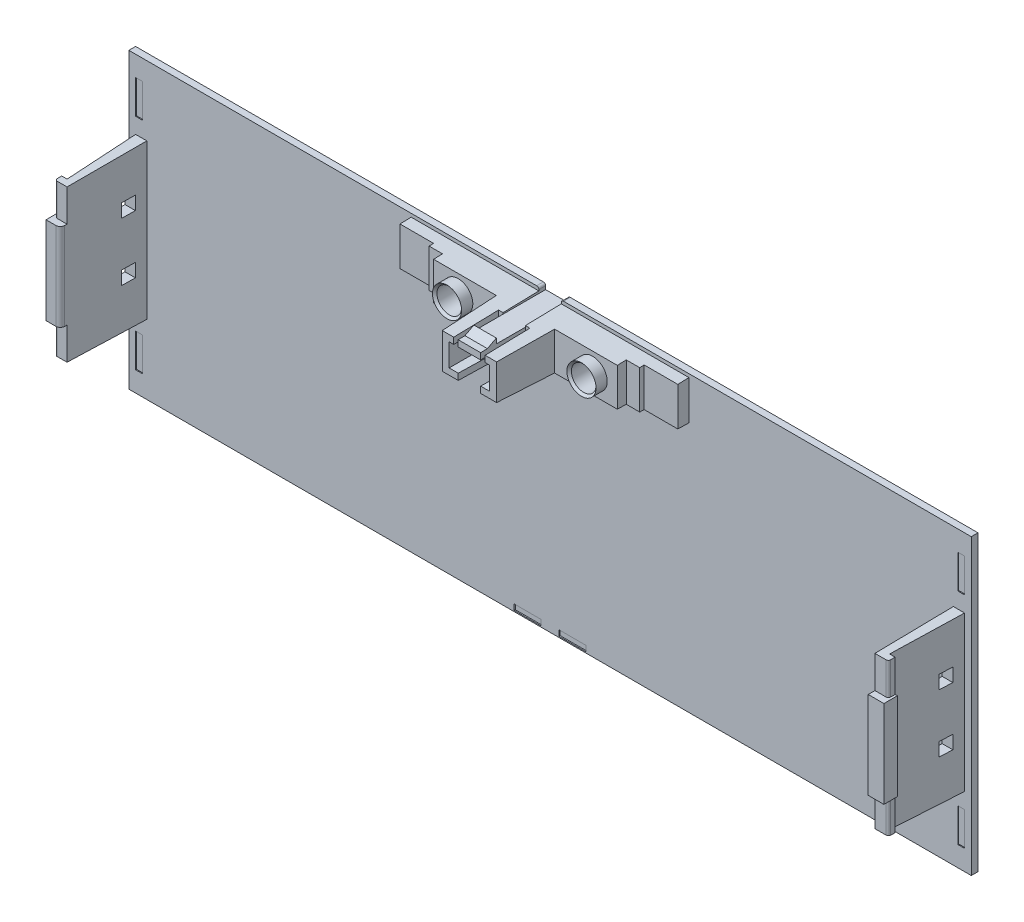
ISO-10303-21;
HEADER;
FILE_DESCRIPTION(('STEP AP214'),'2;1');
FILE_NAME('part.step','',(''),(''),'','','');
FILE_SCHEMA(('AUTOMOTIVE_DESIGN { 1 0 10303 214 1 1 1 1 }'));
ENDSEC;
DATA;
#1=APPLICATION_CONTEXT('core data for automotive mechanical design processes');
#2=APPLICATION_PROTOCOL_DEFINITION('international standard','automotive_design',2000,#1);
#3=PRODUCT_CONTEXT('',#1,'mechanical');
#4=PRODUCT('Part','Part','',(#3));
#5=PRODUCT_RELATED_PRODUCT_CATEGORY('part','',(#4));
#6=PRODUCT_DEFINITION_FORMATION('','',#4);
#7=PRODUCT_DEFINITION_CONTEXT('part definition',#1,'design');
#8=PRODUCT_DEFINITION('design','',#6,#7);
#9=PRODUCT_DEFINITION_SHAPE('','',#8);
#10=(LENGTH_UNIT() NAMED_UNIT(*) SI_UNIT(.MILLI.,.METRE.));
#11=(NAMED_UNIT(*) PLANE_ANGLE_UNIT() SI_UNIT($,.RADIAN.));
#12=(NAMED_UNIT(*) SI_UNIT($,.STERADIAN.) SOLID_ANGLE_UNIT());
#13=UNCERTAINTY_MEASURE_WITH_UNIT(LENGTH_MEASURE(1.E-05),#10,'distance_accuracy_value','');
#14=(GEOMETRIC_REPRESENTATION_CONTEXT(3) GLOBAL_UNCERTAINTY_ASSIGNED_CONTEXT((#13)) GLOBAL_UNIT_ASSIGNED_CONTEXT((#10,
#11,#12)) REPRESENTATION_CONTEXT('',''));
#15=CARTESIAN_POINT('',(0.,0.,0.));
#16=DIRECTION('',(0.,0.,1.));
#17=DIRECTION('',(1.,0.,0.));
#18=AXIS2_PLACEMENT_3D('',#15,#16,#17);
#19=CARTESIAN_POINT('',(19.,30.625,4.5));
#20=DIRECTION('',(0.,0.,-1.));
#21=DIRECTION('',(-1.,0.,0.));
#22=AXIS2_PLACEMENT_3D('',#19,#20,#21);
#23=PLANE('',#22);
#24=CARTESIAN_POINT('',(14.8526041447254,27.625,4.5));
#25=DIRECTION('',(0.,0.,1.));
#26=DIRECTION('',(1.,0.,0.));
#27=AXIS2_PLACEMENT_3D('',#24,#25,#26);
#28=CIRCLE('',#27,3.00361874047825);
#29=CARTESIAN_POINT('',(14.705208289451,30.625,4.5));
#30=VERTEX_POINT('',#29);
#31=CARTESIAN_POINT('',(14.7052082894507,24.625,4.5));
#32=VERTEX_POINT('',#31);
#33=EDGE_CURVE('E930',#30,#32,#28,.T.);
#34=ORIENTED_EDGE('',*,*,#33,.T.);
#35=DIRECTION('',(-1.,0.,0.));
#36=VECTOR('',#35,1.);
#37=CARTESIAN_POINT('',(19.,24.625,4.5));
#38=LINE('',#37,#36);
#39=CARTESIAN_POINT('',(6.5,24.625,4.5));
#40=VERTEX_POINT('',#39);
#41=EDGE_CURVE('E916',#32,#40,#38,.T.);
#42=ORIENTED_EDGE('',*,*,#41,.T.);
#43=DIRECTION('',(0.,1.,0.));
#44=VECTOR('',#43,1.);
#45=CARTESIAN_POINT('',(6.5,30.625,4.5));
#46=LINE('',#45,#44);
#47=CARTESIAN_POINT('',(6.5,30.625,4.5));
#48=VERTEX_POINT('',#47);
#49=EDGE_CURVE('E915',#40,#48,#46,.T.);
#50=ORIENTED_EDGE('',*,*,#49,.T.);
#51=DIRECTION('',(1.,0.,0.));
#52=VECTOR('',#51,1.);
#53=CARTESIAN_POINT('',(19.,30.625,4.5));
#54=LINE('',#53,#52);
#55=EDGE_CURVE('E947',#48,#30,#54,.T.);
#56=ORIENTED_EDGE('',*,*,#55,.T.);
#57=EDGE_LOOP('',(#34,#42,#50,#56));
#58=FACE_BOUND('',#57,.T.);
#59=ADVANCED_FACE('F34',(#58),#23,.T.);
#60=CARTESIAN_POINT('',(-23.5,24.625,2.5));
#61=DIRECTION('',(0.,-1.,0.));
#62=DIRECTION('',(0.,0.,-1.));
#63=AXIS2_PLACEMENT_3D('',#60,#61,#62);
#64=PLANE('',#63);
#65=CARTESIAN_POINT('',(-15.,24.625,4.5));
#66=DIRECTION('',(0.,-1.,0.));
#67=DIRECTION('',(0.,0.,-1.));
#68=AXIS2_PLACEMENT_3D('',#65,#66,#67);
#69=CIRCLE('',#68,0.113884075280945);
#70=CARTESIAN_POINT('',(-14.8861159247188,24.625,4.5));
#71=VERTEX_POINT('',#70);
#72=CARTESIAN_POINT('',(-15.1138840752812,24.625,4.5));
#73=VERTEX_POINT('',#72);
#74=EDGE_CURVE('E1313',#71,#73,#69,.F.);
#75=ORIENTED_EDGE('',*,*,#74,.F.);
#76=DIRECTION('',(-1.,0.,0.));
#77=VECTOR('',#76,1.);
#78=CARTESIAN_POINT('',(-19.,24.625,4.5));
#79=LINE('',#78,#77);
#80=CARTESIAN_POINT('',(-6.5,24.625,4.5));
#81=VERTEX_POINT('',#80);
#82=EDGE_CURVE('E1291',#81,#71,#79,.T.);
#83=ORIENTED_EDGE('',*,*,#82,.F.);
#84=DIRECTION('',(0.,0.,-1.));
#85=VECTOR('',#84,1.);
#86=CARTESIAN_POINT('',(-6.5,24.625,2.5));
#87=LINE('',#86,#85);
#88=CARTESIAN_POINT('',(-6.5,24.625,0.));
#89=VERTEX_POINT('',#88);
#90=EDGE_CURVE('E1311',#81,#89,#87,.T.);
#91=ORIENTED_EDGE('',*,*,#90,.T.);
#92=DIRECTION('',(-1.,0.,0.));
#93=VECTOR('',#92,1.);
#94=CARTESIAN_POINT('',(-23.5,24.625,0.));
#95=LINE('',#94,#93);
#96=CARTESIAN_POINT('',(-23.5,24.625,0.));
#97=VERTEX_POINT('',#96);
#98=EDGE_CURVE('E984',#89,#97,#95,.T.);
#99=ORIENTED_EDGE('',*,*,#98,.T.);
#100=DIRECTION('',(0.,0.,-1.));
#101=VECTOR('',#100,1.);
#102=CARTESIAN_POINT('',(-23.5,24.625,2.5));
#103=LINE('',#102,#101);
#104=CARTESIAN_POINT('',(-23.5,24.625,2.5));
#105=VERTEX_POINT('',#104);
#106=EDGE_CURVE('E2507',#105,#97,#103,.T.);
#107=ORIENTED_EDGE('',*,*,#106,.F.);
#108=DIRECTION('',(-1.,0.,0.));
#109=VECTOR('',#108,1.);
#110=CARTESIAN_POINT('',(-23.5,24.625,2.5));
#111=LINE('',#110,#109);
#112=CARTESIAN_POINT('',(-23.,24.625,2.5));
#113=VERTEX_POINT('',#112);
#114=EDGE_CURVE('E998',#113,#105,#111,.T.);
#115=ORIENTED_EDGE('',*,*,#114,.F.);
#116=CARTESIAN_POINT('',(-23.,24.625,3.5));
#117=DIRECTION('',(0.,-1.,0.));
#118=DIRECTION('',(0.,0.,-1.));
#119=AXIS2_PLACEMENT_3D('',#116,#117,#118);
#120=CIRCLE('',#119,1.);
#121=CARTESIAN_POINT('',(-22.,24.625,3.5));
#122=VERTEX_POINT('',#121);
#123=EDGE_CURVE('E1042',#113,#122,#120,.T.);
#124=ORIENTED_EDGE('',*,*,#123,.T.);
#125=DIRECTION('',(1.,0.,0.));
#126=VECTOR('',#125,1.);
#127=CARTESIAN_POINT('',(-22.,24.625,3.5));
#128=LINE('',#127,#126);
#129=CARTESIAN_POINT('',(-20.,24.625,3.5));
#130=VERTEX_POINT('',#129);
#131=EDGE_CURVE('E969',#122,#130,#128,.T.);
#132=ORIENTED_EDGE('',*,*,#131,.T.);
#133=CARTESIAN_POINT('',(-20.,24.625,4.5));
#134=DIRECTION('',(0.,-1.,0.));
#135=DIRECTION('',(0.,0.,-1.));
#136=AXIS2_PLACEMENT_3D('',#133,#134,#135);
#137=CIRCLE('',#136,1.);
#138=CARTESIAN_POINT('',(-19.,24.625,4.5));
#139=VERTEX_POINT('',#138);
#140=EDGE_CURVE('E1034',#130,#139,#137,.T.);
#141=ORIENTED_EDGE('',*,*,#140,.T.);
#142=EDGE_CURVE('E1284',#73,#139,#79,.T.);
#143=ORIENTED_EDGE('',*,*,#142,.F.);
#144=EDGE_LOOP('',(#75,#83,#91,#99,#107,#115,#124,#132,#141,#143));
#145=FACE_BOUND('',#144,.T.);
#146=ADVANCED_FACE('F1310',(#145),#64,.F.);
#147=CARTESIAN_POINT('',(-6.5,30.625,4.5));
#148=DIRECTION('',(0.,0.,-1.));
#149=DIRECTION('',(-1.,0.,0.));
#150=AXIS2_PLACEMENT_3D('',#147,#148,#149);
#151=PLANE('',#150);
#152=CARTESIAN_POINT('',(-14.9430579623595,27.6244309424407,4.5));
#153=DIRECTION('',(0.,0.,1.));
#154=DIRECTION('',(-1.,0.,0.));
#155=AXIS2_PLACEMENT_3D('',#152,#153,#154);
#156=CIRCLE('',#155,2.99997139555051);
#157=CARTESIAN_POINT('',(-15.,30.6238618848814,4.5));
#158=VERTEX_POINT('',#157);
#159=EDGE_CURVE('E1305',#71,#158,#156,.T.);
#160=ORIENTED_EDGE('',*,*,#159,.T.);
#161=CARTESIAN_POINT('',(-15.0569420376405,27.6244309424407,4.5));
#162=DIRECTION('',(0.,0.,-1.));
#163=DIRECTION('',(1.,0.,0.));
#164=AXIS2_PLACEMENT_3D('',#161,#162,#163);
#165=CIRCLE('',#164,2.99997139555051);
#166=EDGE_CURVE('E941',#73,#158,#165,.T.);
#167=ORIENTED_EDGE('',*,*,#166,.F.);
#168=ORIENTED_EDGE('',*,*,#142,.T.);
#169=DIRECTION('',(0.,1.,0.));
#170=VECTOR('',#169,1.);
#171=CARTESIAN_POINT('',(-19.,30.625,4.5));
#172=LINE('',#171,#170);
#173=CARTESIAN_POINT('',(-19.,30.625,4.5));
#174=VERTEX_POINT('',#173);
#175=EDGE_CURVE('E1287',#139,#174,#172,.T.);
#176=ORIENTED_EDGE('',*,*,#175,.T.);
#177=DIRECTION('',(1.,0.,0.));
#178=VECTOR('',#177,1.);
#179=CARTESIAN_POINT('',(-19.,30.625,4.5));
#180=LINE('',#179,#178);
#181=CARTESIAN_POINT('',(-6.5,30.625,4.5));
#182=VERTEX_POINT('',#181);
#183=EDGE_CURVE('E1159',#174,#182,#180,.T.);
#184=ORIENTED_EDGE('',*,*,#183,.T.);
#185=DIRECTION('',(0.,-1.,0.));
#186=VECTOR('',#185,1.);
#187=CARTESIAN_POINT('',(-6.5,30.625,4.5));
#188=LINE('',#187,#186);
#189=EDGE_CURVE('E1281',#182,#81,#188,.T.);
#190=ORIENTED_EDGE('',*,*,#189,.T.);
#191=ORIENTED_EDGE('',*,*,#82,.T.);
#192=EDGE_LOOP('',(#160,#167,#168,#176,#184,#190,#191));
#193=FACE_BOUND('',#192,.T.);
#194=ADVANCED_FACE('F1303',(#193),#151,.T.);
#195=CARTESIAN_POINT('',(-31.,32.,1.5));
#196=DIRECTION('',(0.,0.999701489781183,0.0244321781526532));
#197=DIRECTION('',(0.,-0.0244321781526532,0.999701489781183));
#198=AXIS2_PLACEMENT_3D('',#195,#196,#197);
#199=PLANE('',#198);
#200=DIRECTION('',(0.,-0.0244321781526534,0.999701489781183));
#201=VECTOR('',#200,1.);
#202=CARTESIAN_POINT('',(2.5,31.8044112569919,9.50298510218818));
#203=LINE('',#202,#201);
#204=CARTESIAN_POINT('',(2.49999999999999,31.5967486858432,18.));
#205=VERTEX_POINT('',#204);
#206=CARTESIAN_POINT('',(2.5,31.5600894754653,19.5));
#207=VERTEX_POINT('',#206);
#208=EDGE_CURVE('E1216',#205,#207,#203,.T.);
#209=ORIENTED_EDGE('',*,*,#208,.F.);
#210=DIRECTION('',(-1.,0.,0.));
#211=VECTOR('',#210,1.);
#212=CARTESIAN_POINT('',(2.49999999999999,31.5967486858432,18.));
#213=LINE('',#212,#211);
#214=CARTESIAN_POINT('',(-2.5,31.5967486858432,18.));
#215=VERTEX_POINT('',#214);
#216=EDGE_CURVE('E1333',#205,#215,#213,.T.);
#217=ORIENTED_EDGE('',*,*,#216,.T.);
#218=DIRECTION('',(0.,0.0244321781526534,-0.999701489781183));
#219=VECTOR('',#218,1.);
#220=CARTESIAN_POINT('',(-2.5,31.8044112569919,9.50298510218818));
#221=LINE('',#220,#219);
#222=CARTESIAN_POINT('',(-2.5,31.5600894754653,19.5));
#223=VERTEX_POINT('',#222);
#224=EDGE_CURVE('E1221',#223,#215,#221,.T.);
#225=ORIENTED_EDGE('',*,*,#224,.F.);
#226=DIRECTION('',(1.,0.,0.));
#227=VECTOR('',#226,1.);
#228=CARTESIAN_POINT('',(31.,31.5600894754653,19.5));
#229=LINE('',#228,#227);
#230=EDGE_CURVE('E1066',#223,#207,#229,.T.);
#231=ORIENTED_EDGE('',*,*,#230,.T.);
#232=EDGE_LOOP('',(#209,#217,#225,#231));
#233=FACE_BOUND('',#232,.T.);
#234=ADVANCED_FACE('F1987',(#233),#199,.T.);
#235=CARTESIAN_POINT('',(-94.,32.75,1.5));
#236=DIRECTION('',(0.,-1.,0.));
#237=DIRECTION('',(0.,0.,-1.));
#238=AXIS2_PLACEMENT_3D('',#235,#236,#237);
#239=PLANE('',#238);
#240=DIRECTION('',(-1.,0.,0.));
#241=VECTOR('',#240,1.);
#242=CARTESIAN_POINT('',(-94.,32.75,0.));
#243=LINE('',#242,#241);
#244=CARTESIAN_POINT('',(94.,32.75,0.));
#245=VERTEX_POINT('',#244);
#246=CARTESIAN_POINT('',(3.,32.75,0.));
#247=VERTEX_POINT('',#246);
#248=EDGE_CURVE('E1410',#245,#247,#243,.T.);
#249=ORIENTED_EDGE('',*,*,#248,.T.);
#250=DIRECTION('',(0.,0.,1.));
#251=VECTOR('',#250,1.);
#252=CARTESIAN_POINT('',(3.,32.75,1.5));
#253=LINE('',#252,#251);
#254=CARTESIAN_POINT('',(3.,32.75,1.5));
#255=VERTEX_POINT('',#254);
#256=EDGE_CURVE('E1198',#247,#255,#253,.T.);
#257=ORIENTED_EDGE('',*,*,#256,.T.);
#258=DIRECTION('',(-1.,0.,0.));
#259=VECTOR('',#258,1.);
#260=CARTESIAN_POINT('',(-94.,32.75,1.5));
#261=LINE('',#260,#259);
#262=CARTESIAN_POINT('',(94.,32.75,1.5));
#263=VERTEX_POINT('',#262);
#264=EDGE_CURVE('E1400',#263,#255,#261,.T.);
#265=ORIENTED_EDGE('',*,*,#264,.F.);
#266=DIRECTION('',(0.,0.,-1.));
#267=VECTOR('',#266,1.);
#268=CARTESIAN_POINT('',(94.,32.75,1.5));
#269=LINE('',#268,#267);
#270=EDGE_CURVE('E1412',#263,#245,#269,.T.);
#271=ORIENTED_EDGE('',*,*,#270,.T.);
#272=EDGE_LOOP('',(#249,#257,#265,#271));
#273=FACE_BOUND('',#272,.T.);
#274=ADVANCED_FACE('F1407',(#273),#239,.F.);
#275=DIRECTION('',(0.,0.0244321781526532,-0.999701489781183));
#276=VECTOR('',#275,1.);
#277=CARTESIAN_POINT('',(2.5,32.,1.5));
#278=LINE('',#277,#276);
#279=CARTESIAN_POINT('',(2.5,31.8044112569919,9.50298510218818));
#280=VERTEX_POINT('',#279);
#281=CARTESIAN_POINT('',(2.5,32.,1.5));
#282=VERTEX_POINT('',#281);
#283=EDGE_CURVE('E1363',#280,#282,#278,.T.);
#284=ORIENTED_EDGE('',*,*,#283,.F.);
#285=DIRECTION('',(-1.,0.,0.));
#286=VECTOR('',#285,1.);
#287=CARTESIAN_POINT('',(3.5,31.8044112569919,9.50298510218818));
#288=LINE('',#287,#286);
#289=CARTESIAN_POINT('',(3.5,31.8044112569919,9.50298510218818));
#290=VERTEX_POINT('',#289);
#291=EDGE_CURVE('E1220',#290,#280,#288,.T.);
#292=ORIENTED_EDGE('',*,*,#291,.F.);
#293=DIRECTION('',(0.,0.0244321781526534,-0.999701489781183));
#294=VECTOR('',#293,1.);
#295=CARTESIAN_POINT('',(3.5,31.8044112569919,9.50298510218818));
#296=LINE('',#295,#294);
#297=CARTESIAN_POINT('',(3.5,31.5600894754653,19.5));
#298=VERTEX_POINT('',#297);
#299=EDGE_CURVE('E1374',#298,#290,#296,.T.);
#300=ORIENTED_EDGE('',*,*,#299,.F.);
#301=CARTESIAN_POINT('',(6.06349038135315,31.5600894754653,19.5));
#302=VERTEX_POINT('',#301);
#303=EDGE_CURVE('E1067',#298,#302,#229,.T.);
#304=ORIENTED_EDGE('',*,*,#303,.T.);
#305=DIRECTION('',(0.0348890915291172,0.0244173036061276,-0.999092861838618));
#306=VECTOR('',#305,1.);
#307=CARTESIAN_POINT('',(6.64618361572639,31.9678902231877,2.81384895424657));
#308=LINE('',#307,#306);
#309=CARTESIAN_POINT('',(6.5,31.8655828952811,7.));
#310=VERTEX_POINT('',#309);
#311=EDGE_CURVE('E1050',#310,#302,#308,.F.);
#312=ORIENTED_EDGE('',*,*,#311,.F.);
#313=DIRECTION('',(-1.,0.,0.));
#314=VECTOR('',#313,1.);
#315=CARTESIAN_POINT('',(-31.,31.8655828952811,6.99999999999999));
#316=LINE('',#315,#314);
#317=CARTESIAN_POINT('',(20.5,31.8655828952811,7.));
#318=VERTEX_POINT('',#317);
#319=EDGE_CURVE('E1049',#318,#310,#316,.T.);
#320=ORIENTED_EDGE('',*,*,#319,.F.);
#321=DIRECTION('',(0.,-0.0244321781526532,0.999701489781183));
#322=VECTOR('',#321,1.);
#323=CARTESIAN_POINT('',(20.5,32.,1.5));
#324=LINE('',#323,#322);
#325=CARTESIAN_POINT('',(20.5,31.9144618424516,5.));
#326=VERTEX_POINT('',#325);
#327=EDGE_CURVE('E1056',#326,#318,#324,.T.);
#328=ORIENTED_EDGE('',*,*,#327,.F.);
#329=DIRECTION('',(-1.,0.,0.));
#330=VECTOR('',#329,1.);
#331=CARTESIAN_POINT('',(-31.,31.9144618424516,4.99999999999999));
#332=LINE('',#331,#330);
#333=CARTESIAN_POINT('',(23.5,31.9144618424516,5.));
#334=VERTEX_POINT('',#333);
#335=EDGE_CURVE('E1054',#334,#326,#332,.T.);
#336=ORIENTED_EDGE('',*,*,#335,.F.);
#337=DIRECTION('',(0.,-0.0244321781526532,0.999701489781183));
#338=VECTOR('',#337,1.);
#339=CARTESIAN_POINT('',(23.5,32.,1.5));
#340=LINE('',#339,#338);
#341=CARTESIAN_POINT('',(23.5,31.9389013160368,4.));
#342=VERTEX_POINT('',#341);
#343=EDGE_CURVE('E1051',#342,#334,#340,.T.);
#344=ORIENTED_EDGE('',*,*,#343,.F.);
#345=DIRECTION('',(-1.,0.,0.));
#346=VECTOR('',#345,1.);
#347=CARTESIAN_POINT('',(-31.,31.9389013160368,3.99999999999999));
#348=LINE('',#347,#346);
#349=CARTESIAN_POINT('',(31.,31.9389013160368,4.));
#350=VERTEX_POINT('',#349);
#351=EDGE_CURVE('E1047',#350,#342,#348,.T.);
#352=ORIENTED_EDGE('',*,*,#351,.F.);
#353=DIRECTION('',(0.,0.0244321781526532,-0.999701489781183));
#354=VECTOR('',#353,1.);
#355=CARTESIAN_POINT('',(31.,32.,1.5));
#356=LINE('',#355,#354);
#357=CARTESIAN_POINT('',(31.,32.,1.5));
#358=VERTEX_POINT('',#357);
#359=EDGE_CURVE('E1086',#350,#358,#356,.T.);
#360=ORIENTED_EDGE('',*,*,#359,.T.);
#361=DIRECTION('',(1.,0.,0.));
#362=VECTOR('',#361,1.);
#363=CARTESIAN_POINT('',(-31.,32.,1.5));
#364=LINE('',#363,#362);
#365=EDGE_CURVE('E1074',#282,#358,#364,.T.);
#366=ORIENTED_EDGE('',*,*,#365,.F.);
#367=EDGE_LOOP('',(#284,#292,#300,#304,#312,#320,#328,#336,#344,#352,#360,#366));
#368=FACE_BOUND('',#367,.T.);
#369=ADVANCED_FACE('F1385',(#368),#199,.T.);
#370=CARTESIAN_POINT('',(31.,32.,19.5));
#371=DIRECTION('',(0.,0.,-1.));
#372=DIRECTION('',(-1.,0.,0.));
#373=AXIS2_PLACEMENT_3D('',#370,#371,#372);
#374=PLANE('',#373);
#375=ORIENTED_EDGE('',*,*,#303,.F.);
#376=DIRECTION('',(0.,-1.,0.));
#377=VECTOR('',#376,1.);
#378=CARTESIAN_POINT('',(3.5,32.,19.5));
#379=LINE('',#378,#377);
#380=CARTESIAN_POINT('',(3.5,30.1484302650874,19.5));
#381=VERTEX_POINT('',#380);
#382=EDGE_CURVE('E1237',#298,#381,#379,.T.);
#383=ORIENTED_EDGE('',*,*,#382,.T.);
#384=DIRECTION('',(-1.,0.,0.));
#385=VECTOR('',#384,1.);
#386=CARTESIAN_POINT('',(31.,30.1484302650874,19.5));
#387=LINE('',#386,#385);
#388=CARTESIAN_POINT('',(4.52343026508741,30.1484302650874,19.5));
#389=VERTEX_POINT('',#388);
#390=EDGE_CURVE('E1149',#389,#381,#387,.T.);
#391=ORIENTED_EDGE('',*,*,#390,.F.);
#392=DIRECTION('',(0.,1.,0.));
#393=VECTOR('',#392,1.);
#394=CARTESIAN_POINT('',(4.52343026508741,32.,19.5));
#395=LINE('',#394,#393);
#396=CARTESIAN_POINT('',(4.52343026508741,25.1015697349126,19.5));
#397=VERTEX_POINT('',#396);
#398=EDGE_CURVE('E1046',#389,#397,#395,.F.);
#399=ORIENTED_EDGE('',*,*,#398,.T.);
#400=DIRECTION('',(1.,0.,0.));
#401=VECTOR('',#400,1.);
#402=CARTESIAN_POINT('',(31.,25.1015697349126,19.5));
#403=LINE('',#402,#401);
#404=CARTESIAN_POINT('',(2.5,25.1015697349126,19.5));
#405=VERTEX_POINT('',#404);
#406=EDGE_CURVE('E1142',#397,#405,#403,.F.);
#407=ORIENTED_EDGE('',*,*,#406,.T.);
#408=DIRECTION('',(0.,-1.,0.));
#409=VECTOR('',#408,1.);
#410=CARTESIAN_POINT('',(2.5,32.,19.5));
#411=LINE('',#410,#409);
#412=CARTESIAN_POINT('',(2.5,23.6899105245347,19.5));
#413=VERTEX_POINT('',#412);
#414=EDGE_CURVE('E1268',#405,#413,#411,.T.);
#415=ORIENTED_EDGE('',*,*,#414,.T.);
#416=DIRECTION('',(-1.,0.,0.));
#417=VECTOR('',#416,1.);
#418=CARTESIAN_POINT('',(31.,23.6899105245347,19.5));
#419=LINE('',#418,#417);
#420=CARTESIAN_POINT('',(6.06349038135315,23.6899105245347,19.5));
#421=VERTEX_POINT('',#420);
#422=EDGE_CURVE('E1065',#413,#421,#419,.F.);
#423=ORIENTED_EDGE('',*,*,#422,.T.);
#424=DIRECTION('',(0.,-1.,0.));
#425=VECTOR('',#424,1.);
#426=CARTESIAN_POINT('',(6.06349038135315,32.,19.5));
#427=LINE('',#426,#425);
#428=EDGE_CURVE('E1661',#421,#302,#427,.F.);
#429=ORIENTED_EDGE('',*,*,#428,.T.);
#430=EDGE_LOOP('',(#375,#383,#391,#399,#407,#415,#423,#429));
#431=FACE_BOUND('',#430,.T.);
#432=ADVANCED_FACE('F1999',(#431),#374,.F.);
#433=CARTESIAN_POINT('',(-3.5,30.1484302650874,19.5));
#434=VERTEX_POINT('',#433);
#435=CARTESIAN_POINT('',(-4.52343026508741,30.1484302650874,19.5));
#436=VERTEX_POINT('',#435);
#437=EDGE_CURVE('E1148',#434,#436,#387,.T.);
#438=ORIENTED_EDGE('',*,*,#437,.F.);
#439=DIRECTION('',(0.,1.,0.));
#440=VECTOR('',#439,1.);
#441=CARTESIAN_POINT('',(-3.5,32.,19.5));
#442=LINE('',#441,#440);
#443=CARTESIAN_POINT('',(-3.5,31.5600894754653,19.5));
#444=VERTEX_POINT('',#443);
#445=EDGE_CURVE('E1255',#434,#444,#442,.T.);
#446=ORIENTED_EDGE('',*,*,#445,.T.);
#447=CARTESIAN_POINT('',(-6.06349038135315,31.5600894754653,19.5));
#448=VERTEX_POINT('',#447);
#449=EDGE_CURVE('E1062',#448,#444,#229,.T.);
#450=ORIENTED_EDGE('',*,*,#449,.F.);
#451=DIRECTION('',(0.,1.,0.));
#452=VECTOR('',#451,1.);
#453=CARTESIAN_POINT('',(-6.06349038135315,32.,19.5));
#454=LINE('',#453,#452);
#455=CARTESIAN_POINT('',(-6.06349038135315,23.6899105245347,19.5));
#456=VERTEX_POINT('',#455);
#457=EDGE_CURVE('E999',#448,#456,#454,.F.);
#458=ORIENTED_EDGE('',*,*,#457,.T.);
#459=CARTESIAN_POINT('',(-2.5,23.6899105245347,19.5));
#460=VERTEX_POINT('',#459);
#461=EDGE_CURVE('E1090',#456,#460,#419,.F.);
#462=ORIENTED_EDGE('',*,*,#461,.T.);
#463=DIRECTION('',(0.,1.,0.));
#464=VECTOR('',#463,1.);
#465=CARTESIAN_POINT('',(-2.5,32.,19.5));
#466=LINE('',#465,#464);
#467=CARTESIAN_POINT('',(-2.5,25.1015697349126,19.5));
#468=VERTEX_POINT('',#467);
#469=EDGE_CURVE('E1273',#460,#468,#466,.T.);
#470=ORIENTED_EDGE('',*,*,#469,.T.);
#471=CARTESIAN_POINT('',(-4.52343026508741,25.1015697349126,19.5));
#472=VERTEX_POINT('',#471);
#473=EDGE_CURVE('E1133',#468,#472,#403,.F.);
#474=ORIENTED_EDGE('',*,*,#473,.T.);
#475=DIRECTION('',(0.,-1.,0.));
#476=VECTOR('',#475,1.);
#477=CARTESIAN_POINT('',(-4.52343026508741,32.,19.5));
#478=LINE('',#477,#476);
#479=EDGE_CURVE('E1145',#436,#472,#478,.T.);
#480=ORIENTED_EDGE('',*,*,#479,.F.);
#481=EDGE_LOOP('',(#438,#446,#450,#458,#462,#470,#474,#480));
#482=FACE_BOUND('',#481,.T.);
#483=ADVANCED_FACE('F1671',(#482),#374,.F.);
#484=CARTESIAN_POINT('',(-94.,-32.75,0.));
#485=DIRECTION('',(0.,0.,1.));
#486=DIRECTION('',(1.,0.,0.));
#487=AXIS2_PLACEMENT_3D('',#484,#485,#486);
#488=PLANE('',#487);
#489=CARTESIAN_POINT('',(-3.,32.75,0.));
#490=VERTEX_POINT('',#489);
#491=CARTESIAN_POINT('',(-94.,32.75,0.));
#492=VERTEX_POINT('',#491);
#493=EDGE_CURVE('E1416',#490,#492,#243,.T.);
#494=ORIENTED_EDGE('',*,*,#493,.F.);
#495=CARTESIAN_POINT('',(-3.,32.25,0.));
#496=DIRECTION('',(0.,0.,1.));
#497=DIRECTION('',(1.,0.,0.));
#498=AXIS2_PLACEMENT_3D('',#495,#496,#497);
#499=CIRCLE('',#498,0.5);
#500=CARTESIAN_POINT('',(-2.5,32.25,0.));
#501=VERTEX_POINT('',#500);
#502=EDGE_CURVE('E1210',#490,#501,#499,.F.);
#503=ORIENTED_EDGE('',*,*,#502,.T.);
#504=DIRECTION('',(0.,1.,0.));
#505=VECTOR('',#504,1.);
#506=CARTESIAN_POINT('',(-2.5,33.23784077,0.));
#507=LINE('',#506,#505);
#508=CARTESIAN_POINT('',(-2.5,31.5,0.));
#509=VERTEX_POINT('',#508);
#510=EDGE_CURVE('E1349',#509,#501,#507,.T.);
#511=ORIENTED_EDGE('',*,*,#510,.F.);
#512=DIRECTION('',(-1.,0.,0.));
#513=VECTOR('',#512,1.);
#514=CARTESIAN_POINT('',(2.5,31.5,0.));
#515=LINE('',#514,#513);
#516=CARTESIAN_POINT('',(2.5,31.5,0.));
#517=VERTEX_POINT('',#516);
#518=EDGE_CURVE('E1346',#517,#509,#515,.T.);
#519=ORIENTED_EDGE('',*,*,#518,.F.);
#520=DIRECTION('',(0.,-1.,0.));
#521=VECTOR('',#520,1.);
#522=CARTESIAN_POINT('',(2.5,33.23784077,0.));
#523=LINE('',#522,#521);
#524=CARTESIAN_POINT('',(2.5,32.25,0.));
#525=VERTEX_POINT('',#524);
#526=EDGE_CURVE('E1344',#525,#517,#523,.T.);
#527=ORIENTED_EDGE('',*,*,#526,.F.);
#528=CARTESIAN_POINT('',(3.,32.25,0.));
#529=DIRECTION('',(0.,0.,1.));
#530=DIRECTION('',(1.,0.,0.));
#531=AXIS2_PLACEMENT_3D('',#528,#529,#530);
#532=CIRCLE('',#531,0.5);
#533=EDGE_CURVE('E1205',#525,#247,#532,.F.);
#534=ORIENTED_EDGE('',*,*,#533,.T.);
#535=ORIENTED_EDGE('',*,*,#248,.F.);
#536=DIRECTION('',(0.,1.,0.));
#537=VECTOR('',#536,1.);
#538=CARTESIAN_POINT('',(94.,32.75,0.));
#539=LINE('',#538,#537);
#540=CARTESIAN_POINT('',(94.,-32.75,0.));
#541=VERTEX_POINT('',#540);
#542=EDGE_CURVE('E1421',#541,#245,#539,.T.);
#543=ORIENTED_EDGE('',*,*,#542,.F.);
#544=DIRECTION('',(1.,0.,0.));
#545=VECTOR('',#544,1.);
#546=CARTESIAN_POINT('',(-94.,-32.75,0.));
#547=LINE('',#546,#545);
#548=CARTESIAN_POINT('',(-94.,-32.75,0.));
#549=VERTEX_POINT('',#548);
#550=EDGE_CURVE('E1930',#549,#541,#547,.T.);
#551=ORIENTED_EDGE('',*,*,#550,.F.);
#552=DIRECTION('',(0.,-1.,0.));
#553=VECTOR('',#552,1.);
#554=CARTESIAN_POINT('',(-94.,32.75,0.));
#555=LINE('',#554,#553);
#556=EDGE_CURVE('E1579',#492,#549,#555,.T.);
#557=ORIENTED_EDGE('',*,*,#556,.F.);
#558=EDGE_LOOP('',(#494,#503,#511,#519,#527,#534,#535,#543,#551,#557));
#559=FACE_BOUND('',#558,.T.);
#560=DIRECTION('',(-1.,0.,0.));
#561=VECTOR('',#560,1.);
#562=CARTESIAN_POINT('',(29.5,24.625,0.));
#563=LINE('',#562,#561);
#564=CARTESIAN_POINT('',(29.5,24.625,0.));
#565=VERTEX_POINT('',#564);
#566=CARTESIAN_POINT('',(24.5,24.625,0.));
#567=VERTEX_POINT('',#566);
#568=EDGE_CURVE('E2444',#565,#567,#563,.T.);
#569=ORIENTED_EDGE('',*,*,#568,.F.);
#570=DIRECTION('',(0.,-1.,0.));
#571=VECTOR('',#570,1.);
#572=CARTESIAN_POINT('',(29.5,30.625,0.));
#573=LINE('',#572,#571);
#574=CARTESIAN_POINT('',(29.5,30.625,0.));
#575=VERTEX_POINT('',#574);
#576=EDGE_CURVE('E2447',#575,#565,#573,.T.);
#577=ORIENTED_EDGE('',*,*,#576,.F.);
#578=DIRECTION('',(1.,0.,0.));
#579=VECTOR('',#578,1.);
#580=CARTESIAN_POINT('',(29.5,30.625,0.));
#581=LINE('',#580,#579);
#582=CARTESIAN_POINT('',(24.5,30.625,0.));
#583=VERTEX_POINT('',#582);
#584=EDGE_CURVE('E2438',#583,#575,#581,.T.);
#585=ORIENTED_EDGE('',*,*,#584,.F.);
#586=DIRECTION('',(0.,1.,0.));
#587=VECTOR('',#586,1.);
#588=CARTESIAN_POINT('',(24.5,30.625,0.));
#589=LINE('',#588,#587);
#590=EDGE_CURVE('E2441',#567,#583,#589,.T.);
#591=ORIENTED_EDGE('',*,*,#590,.F.);
#592=EDGE_LOOP('',(#569,#577,#585,#591));
#593=FACE_BOUND('',#592,.T.);
#594=DIRECTION('',(0.,-1.,0.));
#595=VECTOR('',#594,1.);
#596=CARTESIAN_POINT('',(-24.5,30.625,0.));
#597=LINE('',#596,#595);
#598=CARTESIAN_POINT('',(-24.5,30.625,0.));
#599=VERTEX_POINT('',#598);
#600=CARTESIAN_POINT('',(-24.5,24.625,0.));
#601=VERTEX_POINT('',#600);
#602=EDGE_CURVE('E2476',#599,#601,#597,.T.);
#603=ORIENTED_EDGE('',*,*,#602,.F.);
#604=DIRECTION('',(1.,0.,0.));
#605=VECTOR('',#604,1.);
#606=CARTESIAN_POINT('',(-29.5,30.625,0.));
#607=LINE('',#606,#605);
#608=CARTESIAN_POINT('',(-29.5,30.625,0.));
#609=VERTEX_POINT('',#608);
#610=EDGE_CURVE('E2479',#609,#599,#607,.T.);
#611=ORIENTED_EDGE('',*,*,#610,.F.);
#612=DIRECTION('',(0.,1.,0.));
#613=VECTOR('',#612,1.);
#614=CARTESIAN_POINT('',(-29.5,30.625,0.));
#615=LINE('',#614,#613);
#616=CARTESIAN_POINT('',(-29.5,24.625,0.));
#617=VERTEX_POINT('',#616);
#618=EDGE_CURVE('E2470',#617,#609,#615,.T.);
#619=ORIENTED_EDGE('',*,*,#618,.F.);
#620=DIRECTION('',(-1.,0.,0.));
#621=VECTOR('',#620,1.);
#622=CARTESIAN_POINT('',(-29.5,24.625,0.));
#623=LINE('',#622,#621);
#624=EDGE_CURVE('E2473',#601,#617,#623,.T.);
#625=ORIENTED_EDGE('',*,*,#624,.F.);
#626=EDGE_LOOP('',(#603,#611,#619,#625));
#627=FACE_BOUND('',#626,.T.);
#628=ORIENTED_EDGE('',*,*,#98,.F.);
#629=DIRECTION('',(-1.,0.,0.));
#630=VECTOR('',#629,1.);
#631=CARTESIAN_POINT('',(5.,24.625,0.));
#632=LINE('',#631,#630);
#633=CARTESIAN_POINT('',(6.5,24.625,0.));
#634=VERTEX_POINT('',#633);
#635=EDGE_CURVE('E1156',#634,#89,#632,.T.);
#636=ORIENTED_EDGE('',*,*,#635,.F.);
#637=DIRECTION('',(-1.,0.,0.));
#638=VECTOR('',#637,1.);
#639=CARTESIAN_POINT('',(23.5,24.625,0.));
#640=LINE('',#639,#638);
#641=CARTESIAN_POINT('',(23.5,24.625,0.));
#642=VERTEX_POINT('',#641);
#643=EDGE_CURVE('E2503',#642,#634,#640,.T.);
#644=ORIENTED_EDGE('',*,*,#643,.F.);
#645=DIRECTION('',(0.,-1.,0.));
#646=VECTOR('',#645,1.);
#647=CARTESIAN_POINT('',(23.5,30.625,0.));
#648=LINE('',#647,#646);
#649=CARTESIAN_POINT('',(23.5,30.625,0.));
#650=VERTEX_POINT('',#649);
#651=EDGE_CURVE('E2492',#650,#642,#648,.T.);
#652=ORIENTED_EDGE('',*,*,#651,.F.);
#653=DIRECTION('',(1.,0.,0.));
#654=VECTOR('',#653,1.);
#655=CARTESIAN_POINT('',(23.5,30.625,0.));
#656=LINE('',#655,#654);
#657=CARTESIAN_POINT('',(6.5,30.625,0.));
#658=VERTEX_POINT('',#657);
#659=EDGE_CURVE('E2496',#658,#650,#656,.T.);
#660=ORIENTED_EDGE('',*,*,#659,.F.);
#661=DIRECTION('',(-1.,0.,0.));
#662=VECTOR('',#661,1.);
#663=CARTESIAN_POINT('',(5.,30.625,0.));
#664=LINE('',#663,#662);
#665=CARTESIAN_POINT('',(-6.50000000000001,30.625,0.));
#666=VERTEX_POINT('',#665);
#667=EDGE_CURVE('E1276',#658,#666,#664,.T.);
#668=ORIENTED_EDGE('',*,*,#667,.T.);
#669=DIRECTION('',(1.,0.,0.));
#670=VECTOR('',#669,1.);
#671=CARTESIAN_POINT('',(-23.5,30.625,0.));
#672=LINE('',#671,#670);
#673=CARTESIAN_POINT('',(-23.5,30.625,0.));
#674=VERTEX_POINT('',#673);
#675=EDGE_CURVE('E978',#674,#666,#672,.T.);
#676=ORIENTED_EDGE('',*,*,#675,.F.);
#677=DIRECTION('',(0.,1.,0.));
#678=VECTOR('',#677,1.);
#679=CARTESIAN_POINT('',(-23.5,30.625,0.));
#680=LINE('',#679,#678);
#681=EDGE_CURVE('E987',#97,#674,#680,.T.);
#682=ORIENTED_EDGE('',*,*,#681,.F.);
#683=EDGE_LOOP('',(#628,#636,#644,#652,#660,#668,#676,#682));
#684=FACE_BOUND('',#683,.T.);
#685=ADVANCED_FACE('F1937',(#559,#593,#627,#684),#488,.F.);
#686=CARTESIAN_POINT('',(2.5,30.1484302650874,19.5));
#687=VERTEX_POINT('',#686);
#688=CARTESIAN_POINT('',(-2.5,30.1484302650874,19.5));
#689=VERTEX_POINT('',#688);
#690=EDGE_CURVE('E1153',#687,#689,#387,.T.);
#691=ORIENTED_EDGE('',*,*,#690,.F.);
#692=DIRECTION('',(0.,1.,0.));
#693=VECTOR('',#692,1.);
#694=CARTESIAN_POINT('',(2.5,32.,19.5));
#695=LINE('',#694,#693);
#696=EDGE_CURVE('E1231',#687,#207,#695,.T.);
#697=ORIENTED_EDGE('',*,*,#696,.T.);
#698=ORIENTED_EDGE('',*,*,#230,.F.);
#699=DIRECTION('',(0.,-1.,0.));
#700=VECTOR('',#699,1.);
#701=CARTESIAN_POINT('',(-2.5,32.,19.5));
#702=LINE('',#701,#700);
#703=EDGE_CURVE('E1249',#223,#689,#702,.T.);
#704=ORIENTED_EDGE('',*,*,#703,.T.);
#705=EDGE_LOOP('',(#691,#697,#698,#704));
#706=FACE_BOUND('',#705,.T.);
#707=ADVANCED_FACE('F1717',(#706),#374,.F.);
#708=CARTESIAN_POINT('',(6.5,30.625,3.5));
#709=DIRECTION('',(0.,0.,1.));
#710=DIRECTION('',(1.,0.,0.));
#711=AXIS2_PLACEMENT_3D('',#708,#709,#710);
#712=PLANE('',#711);
#713=DIRECTION('',(-1.,0.,0.));
#714=VECTOR('',#713,1.);
#715=CARTESIAN_POINT('',(22.,24.625,3.5));
#716=LINE('',#715,#714);
#717=CARTESIAN_POINT('',(22.,24.625,3.5));
#718=VERTEX_POINT('',#717);
#719=CARTESIAN_POINT('',(20.,24.625,3.5));
#720=VERTEX_POINT('',#719);
#721=EDGE_CURVE('E955',#718,#720,#716,.T.);
#722=ORIENTED_EDGE('',*,*,#721,.T.);
#723=DIRECTION('',(0.,-1.,0.));
#724=VECTOR('',#723,1.);
#725=CARTESIAN_POINT('',(20.,30.625,3.5));
#726=LINE('',#725,#724);
#727=CARTESIAN_POINT('',(20.,30.625,3.5));
#728=VERTEX_POINT('',#727);
#729=EDGE_CURVE('E1023',#720,#728,#726,.F.);
#730=ORIENTED_EDGE('',*,*,#729,.T.);
#731=DIRECTION('',(-1.,0.,0.));
#732=VECTOR('',#731,1.);
#733=CARTESIAN_POINT('',(22.,30.625,3.5));
#734=LINE('',#733,#732);
#735=CARTESIAN_POINT('',(22.,30.625,3.5));
#736=VERTEX_POINT('',#735);
#737=EDGE_CURVE('E964',#736,#728,#734,.T.);
#738=ORIENTED_EDGE('',*,*,#737,.F.);
#739=DIRECTION('',(0.,-1.,0.));
#740=VECTOR('',#739,1.);
#741=CARTESIAN_POINT('',(22.,30.625,3.5));
#742=LINE('',#741,#740);
#743=EDGE_CURVE('E948',#736,#718,#742,.T.);
#744=ORIENTED_EDGE('',*,*,#743,.T.);
#745=EDGE_LOOP('',(#722,#730,#738,#744));
#746=FACE_BOUND('',#745,.T.);
#747=ADVANCED_FACE('F2031',(#746),#712,.F.);
#748=CARTESIAN_POINT('',(-6.5,30.625,2.5));
#749=DIRECTION('',(0.,0.,-1.));
#750=DIRECTION('',(-1.,0.,0.));
#751=AXIS2_PLACEMENT_3D('',#748,#749,#750);
#752=PLANE('',#751);
#753=DIRECTION('',(1.,0.,0.));
#754=VECTOR('',#753,1.);
#755=CARTESIAN_POINT('',(-23.5,30.625,2.5));
#756=LINE('',#755,#754);
#757=CARTESIAN_POINT('',(-23.5,30.625,2.5));
#758=VERTEX_POINT('',#757);
#759=CARTESIAN_POINT('',(-23.,30.625,2.5));
#760=VERTEX_POINT('',#759);
#761=EDGE_CURVE('E990',#758,#760,#756,.T.);
#762=ORIENTED_EDGE('',*,*,#761,.T.);
#763=DIRECTION('',(0.,-1.,0.));
#764=VECTOR('',#763,1.);
#765=CARTESIAN_POINT('',(-23.,30.625,2.5));
#766=LINE('',#765,#764);
#767=EDGE_CURVE('E1037',#760,#113,#766,.T.);
#768=ORIENTED_EDGE('',*,*,#767,.T.);
#769=ORIENTED_EDGE('',*,*,#114,.T.);
#770=DIRECTION('',(0.,1.,0.));
#771=VECTOR('',#770,1.);
#772=CARTESIAN_POINT('',(-23.5,30.625,2.5));
#773=LINE('',#772,#771);
#774=EDGE_CURVE('E1039',#105,#758,#773,.T.);
#775=ORIENTED_EDGE('',*,*,#774,.T.);
#776=EDGE_LOOP('',(#762,#768,#769,#775));
#777=FACE_BOUND('',#776,.T.);
#778=ADVANCED_FACE('F2032',(#777),#752,.T.);
#779=CARTESIAN_POINT('',(-20.5,32.75,7.));
#780=DIRECTION('',(0.,0.,-1.));
#781=DIRECTION('',(-1.,0.,0.));
#782=AXIS2_PLACEMENT_3D('',#779,#780,#781);
#783=PLANE('',#782);
#784=DIRECTION('',(-1.,0.,0.));
#785=VECTOR('',#784,1.);
#786=CARTESIAN_POINT('',(-31.,31.8655828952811,7.));
#787=LINE('',#786,#785);
#788=CARTESIAN_POINT('',(-6.5,31.8655828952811,7.));
#789=VERTEX_POINT('',#788);
#790=CARTESIAN_POINT('',(-20.5,31.8655828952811,7.));
#791=VERTEX_POINT('',#790);
#792=EDGE_CURVE('E1072',#789,#791,#787,.T.);
#793=ORIENTED_EDGE('',*,*,#792,.T.);
#794=DIRECTION('',(0.,-1.,0.));
#795=VECTOR('',#794,1.);
#796=CARTESIAN_POINT('',(-20.5,32.75,7.));
#797=LINE('',#796,#795);
#798=CARTESIAN_POINT('',(-20.5,23.3844171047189,7.));
#799=VERTEX_POINT('',#798);
#800=EDGE_CURVE('E2370',#791,#799,#797,.T.);
#801=ORIENTED_EDGE('',*,*,#800,.T.);
#802=DIRECTION('',(-1.,0.,0.));
#803=VECTOR('',#802,1.);
#804=CARTESIAN_POINT('',(-20.5,23.3844171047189,7.));
#805=LINE('',#804,#803);
#806=CARTESIAN_POINT('',(-6.5,23.3844171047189,7.));
#807=VERTEX_POINT('',#806);
#808=EDGE_CURVE('E1104',#799,#807,#805,.F.);
#809=ORIENTED_EDGE('',*,*,#808,.T.);
#810=DIRECTION('',(0.,-1.,0.));
#811=VECTOR('',#810,1.);
#812=CARTESIAN_POINT('',(-6.5,32.75,7.));
#813=LINE('',#812,#811);
#814=EDGE_CURVE('E1071',#789,#807,#813,.T.);
#815=ORIENTED_EDGE('',*,*,#814,.F.);
#816=EDGE_LOOP('',(#793,#801,#809,#815));
#817=FACE_BOUND('',#816,.T.);
#818=CARTESIAN_POINT('',(-15.,27.625,7.));
#819=DIRECTION('',(0.,0.,-1.));
#820=DIRECTION('',(-1.,0.,0.));
#821=AXIS2_PLACEMENT_3D('',#818,#819,#820);
#822=CIRCLE('',#821,3.25);
#823=CARTESIAN_POINT('',(-18.25,27.625,7.));
#824=VERTEX_POINT('',#823);
#825=EDGE_CURVE('E1019',#824,#824,#822,.F.);
#826=ORIENTED_EDGE('',*,*,#825,.F.);
#827=EDGE_LOOP('',(#826));
#828=FACE_BOUND('',#827,.T.);
#829=ADVANCED_FACE('F2035',(#817,#828),#783,.F.);
#830=CARTESIAN_POINT('',(20.5,32.75,7.));
#831=DIRECTION('',(0.,0.,-1.));
#832=DIRECTION('',(-1.,0.,0.));
#833=AXIS2_PLACEMENT_3D('',#830,#831,#832);
#834=PLANE('',#833);
#835=ORIENTED_EDGE('',*,*,#319,.T.);
#836=DIRECTION('',(0.,-1.,0.));
#837=VECTOR('',#836,1.);
#838=CARTESIAN_POINT('',(6.5,32.75,7.));
#839=LINE('',#838,#837);
#840=CARTESIAN_POINT('',(6.5,23.3844171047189,7.));
#841=VERTEX_POINT('',#840);
#842=EDGE_CURVE('E2401',#310,#841,#839,.T.);
#843=ORIENTED_EDGE('',*,*,#842,.T.);
#844=DIRECTION('',(-1.,0.,0.));
#845=VECTOR('',#844,1.);
#846=CARTESIAN_POINT('',(20.5,23.3844171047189,7.));
#847=LINE('',#846,#845);
#848=CARTESIAN_POINT('',(20.5,23.3844171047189,7.));
#849=VERTEX_POINT('',#848);
#850=EDGE_CURVE('E1115',#841,#849,#847,.F.);
#851=ORIENTED_EDGE('',*,*,#850,.T.);
#852=DIRECTION('',(0.,-1.,0.));
#853=VECTOR('',#852,1.);
#854=CARTESIAN_POINT('',(20.5,32.75,7.));
#855=LINE('',#854,#853);
#856=EDGE_CURVE('E2403',#318,#849,#855,.T.);
#857=ORIENTED_EDGE('',*,*,#856,.F.);
#858=EDGE_LOOP('',(#835,#843,#851,#857));
#859=FACE_BOUND('',#858,.T.);
#860=CARTESIAN_POINT('',(15.,27.625,7.));
#861=DIRECTION('',(0.,0.,-1.));
#862=DIRECTION('',(-1.,0.,0.));
#863=AXIS2_PLACEMENT_3D('',#860,#861,#862);
#864=CIRCLE('',#863,3.25);
#865=CARTESIAN_POINT('',(11.75,27.625,7.));
#866=VERTEX_POINT('',#865);
#867=EDGE_CURVE('E1658',#866,#866,#864,.F.);
#868=ORIENTED_EDGE('',*,*,#867,.F.);
#869=EDGE_LOOP('',(#868));
#870=FACE_BOUND('',#869,.T.);
#871=ADVANCED_FACE('F2123',(#859,#870),#834,.F.);
#872=CARTESIAN_POINT('',(-93.5,17.25,20.5));
#873=DIRECTION('',(1.,0.,0.));
#874=DIRECTION('',(0.,0.,-1.));
#875=AXIS2_PLACEMENT_3D('',#872,#873,#874);
#876=PLANE('',#875);
#877=DIRECTION('',(0.,0.,1.));
#878=VECTOR('',#877,1.);
#879=CARTESIAN_POINT('',(-93.5,9.75,19.));
#880=LINE('',#879,#878);
#881=CARTESIAN_POINT('',(-93.5,9.74999999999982,17.5));
#882=VERTEX_POINT('',#881);
#883=CARTESIAN_POINT('',(-93.5,9.75,20.5));
#884=VERTEX_POINT('',#883);
#885=EDGE_CURVE('E1575',#882,#884,#880,.T.);
#886=ORIENTED_EDGE('',*,*,#885,.F.);
#887=DIRECTION('',(0.,-1.,0.));
#888=VECTOR('',#887,1.);
#889=CARTESIAN_POINT('',(-93.5,32.75,17.5));
#890=LINE('',#889,#888);
#891=CARTESIAN_POINT('',(-93.5,-9.75,17.5));
#892=VERTEX_POINT('',#891);
#893=EDGE_CURVE('E1828',#882,#892,#890,.T.);
#894=ORIENTED_EDGE('',*,*,#893,.T.);
#895=DIRECTION('',(0.,0.,-1.));
#896=VECTOR('',#895,1.);
#897=CARTESIAN_POINT('',(-93.5,-9.75,19.));
#898=LINE('',#897,#896);
#899=CARTESIAN_POINT('',(-93.5,-9.75,20.5));
#900=VERTEX_POINT('',#899);
#901=EDGE_CURVE('E1608',#900,#892,#898,.T.);
#902=ORIENTED_EDGE('',*,*,#901,.F.);
#903=DIRECTION('',(0.,-1.,0.));
#904=VECTOR('',#903,1.);
#905=CARTESIAN_POINT('',(-93.5,17.25,20.5));
#906=LINE('',#905,#904);
#907=EDGE_CURVE('E1611',#884,#900,#906,.T.);
#908=ORIENTED_EDGE('',*,*,#907,.F.);
#909=EDGE_LOOP('',(#886,#894,#902,#908));
#910=FACE_BOUND('',#909,.T.);
#911=ADVANCED_FACE('F2126',(#910),#876,.F.);
#912=CARTESIAN_POINT('',(-94.,-32.75,1.5));
#913=DIRECTION('',(0.,0.,1.));
#914=DIRECTION('',(1.,0.,0.));
#915=AXIS2_PLACEMENT_3D('',#912,#913,#914);
#916=PLANE('',#915);
#917=DIRECTION('',(1.,0.,0.));
#918=VECTOR('',#917,1.);
#919=CARTESIAN_POINT('',(-91.,-28.2499999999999,1.5));
#920=LINE('',#919,#918);
#921=CARTESIAN_POINT('',(-92.5,-28.2499999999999,1.5));
#922=VERTEX_POINT('',#921);
#923=CARTESIAN_POINT('',(-91.,-28.2499999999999,1.5));
#924=VERTEX_POINT('',#923);
#925=EDGE_CURVE('E1315',#922,#924,#920,.T.);
#926=ORIENTED_EDGE('',*,*,#925,.F.);
#927=DIRECTION('',(0.,-1.,0.));
#928=VECTOR('',#927,1.);
#929=CARTESIAN_POINT('',(-92.5,-28.2499999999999,1.5));
#930=LINE('',#929,#928);
#931=CARTESIAN_POINT('',(-92.5,-20.7499999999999,1.5));
#932=VERTEX_POINT('',#931);
#933=EDGE_CURVE('E3606',#932,#922,#930,.T.);
#934=ORIENTED_EDGE('',*,*,#933,.F.);
#935=DIRECTION('',(-1.,0.,0.));
#936=VECTOR('',#935,1.);
#937=CARTESIAN_POINT('',(-91.,-20.7499999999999,1.5));
#938=LINE('',#937,#936);
#939=CARTESIAN_POINT('',(-91.,-20.7499999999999,1.5));
#940=VERTEX_POINT('',#939);
#941=EDGE_CURVE('E3603',#940,#932,#938,.T.);
#942=ORIENTED_EDGE('',*,*,#941,.F.);
#943=DIRECTION('',(0.,1.,0.));
#944=VECTOR('',#943,1.);
#945=CARTESIAN_POINT('',(-91.,-28.2499999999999,1.5));
#946=LINE('',#945,#944);
#947=EDGE_CURVE('E1317',#924,#940,#946,.T.);
#948=ORIENTED_EDGE('',*,*,#947,.F.);
#949=EDGE_LOOP('',(#926,#934,#942,#948));
#950=FACE_BOUND('',#949,.T.);
#951=DIRECTION('',(0.,1.,0.));
#952=VECTOR('',#951,1.);
#953=CARTESIAN_POINT('',(-91.,28.25,1.5));
#954=LINE('',#953,#952);
#955=CARTESIAN_POINT('',(-91.,20.75,1.5));
#956=VERTEX_POINT('',#955);
#957=CARTESIAN_POINT('',(-91.,28.25,1.5));
#958=VERTEX_POINT('',#957);
#959=EDGE_CURVE('E3624',#956,#958,#954,.T.);
#960=ORIENTED_EDGE('',*,*,#959,.F.);
#961=DIRECTION('',(1.,0.,0.));
#962=VECTOR('',#961,1.);
#963=CARTESIAN_POINT('',(-91.,20.75,1.5));
#964=LINE('',#963,#962);
#965=CARTESIAN_POINT('',(-92.5,20.75,1.5));
#966=VERTEX_POINT('',#965);
#967=EDGE_CURVE('E3638',#966,#956,#964,.T.);
#968=ORIENTED_EDGE('',*,*,#967,.F.);
#969=DIRECTION('',(0.,-1.,0.));
#970=VECTOR('',#969,1.);
#971=CARTESIAN_POINT('',(-92.5,28.25,1.5));
#972=LINE('',#971,#970);
#973=CARTESIAN_POINT('',(-92.5,28.25,1.5));
#974=VERTEX_POINT('',#973);
#975=EDGE_CURVE('E3635',#974,#966,#972,.T.);
#976=ORIENTED_EDGE('',*,*,#975,.F.);
#977=DIRECTION('',(-1.,0.,0.));
#978=VECTOR('',#977,1.);
#979=CARTESIAN_POINT('',(-91.,28.25,1.5));
#980=LINE('',#979,#978);
#981=EDGE_CURVE('E3632',#958,#974,#980,.T.);
#982=ORIENTED_EDGE('',*,*,#981,.F.);
#983=EDGE_LOOP('',(#960,#968,#976,#982));
#984=FACE_BOUND('',#983,.T.);
#985=DIRECTION('',(0.,-1.,0.));
#986=VECTOR('',#985,1.);
#987=CARTESIAN_POINT('',(91.,-28.25,1.5));
#988=LINE('',#987,#986);
#989=CARTESIAN_POINT('',(91.,-20.75,1.5));
#990=VERTEX_POINT('',#989);
#991=CARTESIAN_POINT('',(91.,-28.25,1.5));
#992=VERTEX_POINT('',#991);
#993=EDGE_CURVE('E3656',#990,#992,#988,.T.);
#994=ORIENTED_EDGE('',*,*,#993,.F.);
#995=DIRECTION('',(-1.,0.,0.));
#996=VECTOR('',#995,1.);
#997=CARTESIAN_POINT('',(91.,-20.75,1.5));
#998=LINE('',#997,#996);
#999=CARTESIAN_POINT('',(92.5,-20.75,1.5));
#1000=VERTEX_POINT('',#999);
#1001=EDGE_CURVE('E3670',#1000,#990,#998,.T.);
#1002=ORIENTED_EDGE('',*,*,#1001,.F.);
#1003=DIRECTION('',(0.,1.,0.));
#1004=VECTOR('',#1003,1.);
#1005=CARTESIAN_POINT('',(92.5,-28.25,1.5));
#1006=LINE('',#1005,#1004);
#1007=CARTESIAN_POINT('',(92.5,-28.25,1.5));
#1008=VERTEX_POINT('',#1007);
#1009=EDGE_CURVE('E3667',#1008,#1000,#1006,.T.);
#1010=ORIENTED_EDGE('',*,*,#1009,.F.);
#1011=DIRECTION('',(1.,0.,0.));
#1012=VECTOR('',#1011,1.);
#1013=CARTESIAN_POINT('',(91.,-28.25,1.5));
#1014=LINE('',#1013,#1012);
#1015=EDGE_CURVE('E3664',#992,#1008,#1014,.T.);
#1016=ORIENTED_EDGE('',*,*,#1015,.F.);
#1017=EDGE_LOOP('',(#994,#1002,#1010,#1016));
#1018=FACE_BOUND('',#1017,.T.);
#1019=DIRECTION('',(0.,-1.,0.));
#1020=VECTOR('',#1019,1.);
#1021=CARTESIAN_POINT('',(91.,28.25,1.5));
#1022=LINE('',#1021,#1020);
#1023=CARTESIAN_POINT('',(91.,28.25,1.5));
#1024=VERTEX_POINT('',#1023);
#1025=CARTESIAN_POINT('',(91.,20.75,1.5));
#1026=VERTEX_POINT('',#1025);
#1027=EDGE_CURVE('E3688',#1024,#1026,#1022,.T.);
#1028=ORIENTED_EDGE('',*,*,#1027,.F.);
#1029=DIRECTION('',(-1.,0.,0.));
#1030=VECTOR('',#1029,1.);
#1031=CARTESIAN_POINT('',(91.,28.25,1.5));
#1032=LINE('',#1031,#1030);
#1033=CARTESIAN_POINT('',(92.5,28.25,1.5));
#1034=VERTEX_POINT('',#1033);
#1035=EDGE_CURVE('E3702',#1034,#1024,#1032,.T.);
#1036=ORIENTED_EDGE('',*,*,#1035,.F.);
#1037=DIRECTION('',(0.,1.,0.));
#1038=VECTOR('',#1037,1.);
#1039=CARTESIAN_POINT('',(92.5,28.25,1.5));
#1040=LINE('',#1039,#1038);
#1041=CARTESIAN_POINT('',(92.5,20.75,1.5));
#1042=VERTEX_POINT('',#1041);
#1043=EDGE_CURVE('E3699',#1042,#1034,#1040,.T.);
#1044=ORIENTED_EDGE('',*,*,#1043,.F.);
#1045=DIRECTION('',(1.,0.,0.));
#1046=VECTOR('',#1045,1.);
#1047=CARTESIAN_POINT('',(91.,20.75,1.5));
#1048=LINE('',#1047,#1046);
#1049=EDGE_CURVE('E3696',#1026,#1042,#1048,.T.);
#1050=ORIENTED_EDGE('',*,*,#1049,.F.);
#1051=EDGE_LOOP('',(#1028,#1036,#1044,#1050));
#1052=FACE_BOUND('',#1051,.T.);
#1053=DIRECTION('',(0.,-1.,0.));
#1054=VECTOR('',#1053,1.);
#1055=CARTESIAN_POINT('',(-2.5,-32.75,1.5));
#1056=LINE('',#1055,#1054);
#1057=CARTESIAN_POINT('',(-2.5,32.25,1.5));
#1058=VERTEX_POINT('',#1057);
#1059=CARTESIAN_POINT('',(-2.5,32.,1.5));
#1060=VERTEX_POINT('',#1059);
#1061=EDGE_CURVE('E1373',#1058,#1060,#1056,.T.);
#1062=ORIENTED_EDGE('',*,*,#1061,.F.);
#1063=CARTESIAN_POINT('',(-3.,32.25,1.5));
#1064=DIRECTION('',(0.,0.,1.));
#1065=DIRECTION('',(1.,0.,0.));
#1066=AXIS2_PLACEMENT_3D('',#1063,#1064,#1065);
#1067=CIRCLE('',#1066,0.5);
#1068=CARTESIAN_POINT('',(-3.,32.75,1.5));
#1069=VERTEX_POINT('',#1068);
#1070=EDGE_CURVE('E1214',#1058,#1069,#1067,.T.);
#1071=ORIENTED_EDGE('',*,*,#1070,.T.);
#1072=CARTESIAN_POINT('',(-94.,32.75,1.5));
#1073=VERTEX_POINT('',#1072);
#1074=EDGE_CURVE('E1428',#1069,#1073,#261,.T.);
#1075=ORIENTED_EDGE('',*,*,#1074,.T.);
#1076=DIRECTION('',(0.,-1.,0.));
#1077=VECTOR('',#1076,1.);
#1078=CARTESIAN_POINT('',(-94.,32.75,1.5));
#1079=LINE('',#1078,#1077);
#1080=CARTESIAN_POINT('',(-94.,-32.75,1.5));
#1081=VERTEX_POINT('',#1080);
#1082=EDGE_CURVE('E1415',#1073,#1081,#1079,.T.);
#1083=ORIENTED_EDGE('',*,*,#1082,.T.);
#1084=DIRECTION('',(1.,0.,0.));
#1085=VECTOR('',#1084,1.);
#1086=CARTESIAN_POINT('',(-94.,-32.75,1.5));
#1087=LINE('',#1086,#1085);
#1088=CARTESIAN_POINT('',(94.,-32.75,1.5));
#1089=VERTEX_POINT('',#1088);
#1090=EDGE_CURVE('E1419',#1081,#1089,#1087,.T.);
#1091=ORIENTED_EDGE('',*,*,#1090,.T.);
#1092=DIRECTION('',(0.,1.,0.));
#1093=VECTOR('',#1092,1.);
#1094=CARTESIAN_POINT('',(94.,32.75,1.5));
#1095=LINE('',#1094,#1093);
#1096=EDGE_CURVE('E1426',#1089,#263,#1095,.T.);
#1097=ORIENTED_EDGE('',*,*,#1096,.T.);
#1098=ORIENTED_EDGE('',*,*,#264,.T.);
#1099=CARTESIAN_POINT('',(3.,32.25,1.5));
#1100=DIRECTION('',(0.,0.,1.));
#1101=DIRECTION('',(1.,0.,0.));
#1102=AXIS2_PLACEMENT_3D('',#1099,#1100,#1101);
#1103=CIRCLE('',#1102,0.5);
#1104=CARTESIAN_POINT('',(2.5,32.25,1.5));
#1105=VERTEX_POINT('',#1104);
#1106=EDGE_CURVE('E1201',#255,#1105,#1103,.T.);
#1107=ORIENTED_EDGE('',*,*,#1106,.T.);
#1108=DIRECTION('',(0.,1.,0.));
#1109=VECTOR('',#1108,1.);
#1110=CARTESIAN_POINT('',(2.49999999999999,-32.75,1.5));
#1111=LINE('',#1110,#1109);
#1112=EDGE_CURVE('E1368',#282,#1105,#1111,.T.);
#1113=ORIENTED_EDGE('',*,*,#1112,.F.);
#1114=ORIENTED_EDGE('',*,*,#365,.T.);
#1115=DIRECTION('',(0.,-1.,0.));
#1116=VECTOR('',#1115,1.);
#1117=CARTESIAN_POINT('',(31.,32.,1.5));
#1118=LINE('',#1117,#1116);
#1119=CARTESIAN_POINT('',(31.,23.25,1.5));
#1120=VERTEX_POINT('',#1119);
#1121=EDGE_CURVE('E1730',#358,#1120,#1118,.T.);
#1122=ORIENTED_EDGE('',*,*,#1121,.T.);
#1123=DIRECTION('',(1.,0.,0.));
#1124=VECTOR('',#1123,1.);
#1125=CARTESIAN_POINT('',(-31.,23.25,1.5));
#1126=LINE('',#1125,#1124);
#1127=CARTESIAN_POINT('',(-31.,23.25,1.5));
#1128=VERTEX_POINT('',#1127);
#1129=EDGE_CURVE('E1724',#1128,#1120,#1126,.T.);
#1130=ORIENTED_EDGE('',*,*,#1129,.F.);
#1131=DIRECTION('',(0.,-1.,0.));
#1132=VECTOR('',#1131,1.);
#1133=CARTESIAN_POINT('',(-31.,32.,1.5));
#1134=LINE('',#1133,#1132);
#1135=CARTESIAN_POINT('',(-31.,32.,1.5));
#1136=VERTEX_POINT('',#1135);
#1137=EDGE_CURVE('E1721',#1136,#1128,#1134,.T.);
#1138=ORIENTED_EDGE('',*,*,#1137,.F.);
#1139=EDGE_CURVE('E1961',#1136,#1060,#364,.T.);
#1140=ORIENTED_EDGE('',*,*,#1139,.T.);
#1141=EDGE_LOOP('',(#1062,#1071,#1075,#1083,#1091,#1097,#1098,#1107,#1113,#1114,#1122,#1130,
#1138,#1140));
#1142=FACE_BOUND('',#1141,.T.);
#1143=DIRECTION('',(-1.,0.,0.));
#1144=VECTOR('',#1143,1.);
#1145=CARTESIAN_POINT('',(7.99999999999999,-31.25,1.5));
#1146=LINE('',#1145,#1144);
#1147=CARTESIAN_POINT('',(7.99999999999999,-31.25,1.5));
#1148=VERTEX_POINT('',#1147);
#1149=CARTESIAN_POINT('',(2.,-31.25,1.5));
#1150=VERTEX_POINT('',#1149);
#1151=EDGE_CURVE('E1084',#1148,#1150,#1146,.T.);
#1152=ORIENTED_EDGE('',*,*,#1151,.F.);
#1153=DIRECTION('',(0.,1.,0.));
#1154=VECTOR('',#1153,1.);
#1155=CARTESIAN_POINT('',(7.99999999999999,-31.25,1.5));
#1156=LINE('',#1155,#1154);
#1157=CARTESIAN_POINT('',(7.99999999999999,-32.5,1.5));
#1158=VERTEX_POINT('',#1157);
#1159=EDGE_CURVE('E1741',#1158,#1148,#1156,.T.);
#1160=ORIENTED_EDGE('',*,*,#1159,.F.);
#1161=DIRECTION('',(1.,0.,0.));
#1162=VECTOR('',#1161,1.);
#1163=CARTESIAN_POINT('',(7.99999999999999,-32.5,1.5));
#1164=LINE('',#1163,#1162);
#1165=CARTESIAN_POINT('',(1.99999999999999,-32.5,1.5));
#1166=VERTEX_POINT('',#1165);
#1167=EDGE_CURVE('E1738',#1166,#1158,#1164,.T.);
#1168=ORIENTED_EDGE('',*,*,#1167,.F.);
#1169=DIRECTION('',(0.,-1.,0.));
#1170=VECTOR('',#1169,1.);
#1171=CARTESIAN_POINT('',(1.99999999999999,-31.25,1.5));
#1172=LINE('',#1171,#1170);
#1173=EDGE_CURVE('E1735',#1150,#1166,#1172,.T.);
#1174=ORIENTED_EDGE('',*,*,#1173,.F.);
#1175=EDGE_LOOP('',(#1152,#1160,#1168,#1174));
#1176=FACE_BOUND('',#1175,.T.);
#1177=DIRECTION('',(0.,-1.,0.));
#1178=VECTOR('',#1177,1.);
#1179=CARTESIAN_POINT('',(-7.99999999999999,-31.25,1.5));
#1180=LINE('',#1179,#1178);
#1181=CARTESIAN_POINT('',(-7.99999999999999,-31.25,1.5));
#1182=VERTEX_POINT('',#1181);
#1183=CARTESIAN_POINT('',(-7.99999999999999,-32.5,1.5));
#1184=VERTEX_POINT('',#1183);
#1185=EDGE_CURVE('E1759',#1182,#1184,#1180,.T.);
#1186=ORIENTED_EDGE('',*,*,#1185,.F.);
#1187=DIRECTION('',(-1.,0.,0.));
#1188=VECTOR('',#1187,1.);
#1189=CARTESIAN_POINT('',(-7.99999999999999,-31.25,1.5));
#1190=LINE('',#1189,#1188);
#1191=CARTESIAN_POINT('',(-1.99999999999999,-31.25,1.5));
#1192=VERTEX_POINT('',#1191);
#1193=EDGE_CURVE('E1773',#1192,#1182,#1190,.T.);
#1194=ORIENTED_EDGE('',*,*,#1193,.F.);
#1195=DIRECTION('',(0.,1.,0.));
#1196=VECTOR('',#1195,1.);
#1197=CARTESIAN_POINT('',(-1.99999999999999,-31.25,1.5));
#1198=LINE('',#1197,#1196);
#1199=CARTESIAN_POINT('',(-1.99999999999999,-32.5,1.5));
#1200=VERTEX_POINT('',#1199);
#1201=EDGE_CURVE('E1770',#1200,#1192,#1198,.T.);
#1202=ORIENTED_EDGE('',*,*,#1201,.F.);
#1203=DIRECTION('',(1.,0.,0.));
#1204=VECTOR('',#1203,1.);
#1205=CARTESIAN_POINT('',(-7.99999999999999,-32.5,1.5));
#1206=LINE('',#1205,#1204);
#1207=EDGE_CURVE('E1767',#1184,#1200,#1206,.T.);
#1208=ORIENTED_EDGE('',*,*,#1207,.F.);
#1209=EDGE_LOOP('',(#1186,#1194,#1202,#1208));
#1210=FACE_BOUND('',#1209,.T.);
#1211=DIRECTION('',(-1.,0.,0.));
#1212=VECTOR('',#1211,1.);
#1213=CARTESIAN_POINT('',(93.5,17.25,1.5));
#1214=LINE('',#1213,#1212);
#1215=CARTESIAN_POINT('',(92.5,17.25,1.5));
#1216=VERTEX_POINT('',#1215);
#1217=CARTESIAN_POINT('',(90.,17.25,1.5));
#1218=VERTEX_POINT('',#1217);
#1219=EDGE_CURVE('E1501',#1216,#1218,#1214,.T.);
#1220=ORIENTED_EDGE('',*,*,#1219,.F.);
#1221=DIRECTION('',(0.,-1.,0.));
#1222=VECTOR('',#1221,1.);
#1223=CARTESIAN_POINT('',(92.5,32.75,1.5));
#1224=LINE('',#1223,#1222);
#1225=CARTESIAN_POINT('',(92.5,-17.25,1.5));
#1226=VERTEX_POINT('',#1225);
#1227=EDGE_CURVE('E1802',#1216,#1226,#1224,.T.);
#1228=ORIENTED_EDGE('',*,*,#1227,.T.);
#1229=DIRECTION('',(1.,0.,0.));
#1230=VECTOR('',#1229,1.);
#1231=CARTESIAN_POINT('',(93.5,-17.25,1.5));
#1232=LINE('',#1231,#1230);
#1233=CARTESIAN_POINT('',(90.,-17.25,1.5));
#1234=VERTEX_POINT('',#1233);
#1235=EDGE_CURVE('E1913',#1234,#1226,#1232,.T.);
#1236=ORIENTED_EDGE('',*,*,#1235,.F.);
#1237=DIRECTION('',(0.,-1.,0.));
#1238=VECTOR('',#1237,1.);
#1239=CARTESIAN_POINT('',(90.,17.25,1.5));
#1240=LINE('',#1239,#1238);
#1241=EDGE_CURVE('E1910',#1218,#1234,#1240,.T.);
#1242=ORIENTED_EDGE('',*,*,#1241,.F.);
#1243=EDGE_LOOP('',(#1220,#1228,#1236,#1242));
#1244=FACE_BOUND('',#1243,.T.);
#1245=DIRECTION('',(0.,-1.,0.));
#1246=VECTOR('',#1245,1.);
#1247=CARTESIAN_POINT('',(-92.5,32.75,1.5));
#1248=LINE('',#1247,#1246);
#1249=CARTESIAN_POINT('',(-92.5,17.25,1.5));
#1250=VERTEX_POINT('',#1249);
#1251=CARTESIAN_POINT('',(-92.5,-17.25,1.5));
#1252=VERTEX_POINT('',#1251);
#1253=EDGE_CURVE('E1588',#1250,#1252,#1248,.T.);
#1254=ORIENTED_EDGE('',*,*,#1253,.F.);
#1255=DIRECTION('',(-1.,0.,0.));
#1256=VECTOR('',#1255,1.);
#1257=CARTESIAN_POINT('',(-93.5,17.25,1.5));
#1258=LINE('',#1257,#1256);
#1259=CARTESIAN_POINT('',(-90.,17.25,1.5));
#1260=VERTEX_POINT('',#1259);
#1261=EDGE_CURVE('E1924',#1260,#1250,#1258,.T.);
#1262=ORIENTED_EDGE('',*,*,#1261,.F.);
#1263=DIRECTION('',(0.,1.,0.));
#1264=VECTOR('',#1263,1.);
#1265=CARTESIAN_POINT('',(-90.,17.25,1.5));
#1266=LINE('',#1265,#1264);
#1267=CARTESIAN_POINT('',(-90.,-17.25,1.5));
#1268=VERTEX_POINT('',#1267);
#1269=EDGE_CURVE('E1921',#1268,#1260,#1266,.T.);
#1270=ORIENTED_EDGE('',*,*,#1269,.F.);
#1271=DIRECTION('',(1.,0.,0.));
#1272=VECTOR('',#1271,1.);
#1273=CARTESIAN_POINT('',(-93.5,-17.25,1.5));
#1274=LINE('',#1273,#1272);
#1275=EDGE_CURVE('E1632',#1252,#1268,#1274,.T.);
#1276=ORIENTED_EDGE('',*,*,#1275,.F.);
#1277=EDGE_LOOP('',(#1254,#1262,#1270,#1276));
#1278=FACE_BOUND('',#1277,.T.);
#1279=ADVANCED_FACE('F1395',(#950,#984,#1018,#1052,#1142,#1176,#1210,#1244,#1278),#916,.T.);
#1280=CARTESIAN_POINT('',(-94.,32.75,1.5));
#1281=DIRECTION('',(1.,0.,0.));
#1282=DIRECTION('',(0.,1.,0.));
#1283=AXIS2_PLACEMENT_3D('',#1280,#1281,#1282);
#1284=PLANE('',#1283);
#1285=ORIENTED_EDGE('',*,*,#556,.T.);
#1286=DIRECTION('',(0.,0.,-1.));
#1287=VECTOR('',#1286,1.);
#1288=CARTESIAN_POINT('',(-94.,-32.75,1.5));
#1289=LINE('',#1288,#1287);
#1290=EDGE_CURVE('E1437',#1081,#549,#1289,.T.);
#1291=ORIENTED_EDGE('',*,*,#1290,.F.);
#1292=ORIENTED_EDGE('',*,*,#1082,.F.);
#1293=DIRECTION('',(0.,0.,-1.));
#1294=VECTOR('',#1293,1.);
#1295=CARTESIAN_POINT('',(-94.,32.75,1.5));
#1296=LINE('',#1295,#1294);
#1297=EDGE_CURVE('E1430',#1073,#492,#1296,.T.);
#1298=ORIENTED_EDGE('',*,*,#1297,.T.);
#1299=EDGE_LOOP('',(#1285,#1291,#1292,#1298));
#1300=FACE_BOUND('',#1299,.T.);
#1301=ADVANCED_FACE('F1944',(#1300),#1284,.F.);
#1302=CARTESIAN_POINT('',(-94.,-32.75,1.5));
#1303=DIRECTION('',(0.,1.,0.));
#1304=DIRECTION('',(0.,0.,1.));
#1305=AXIS2_PLACEMENT_3D('',#1302,#1303,#1304);
#1306=PLANE('',#1305);
#1307=ORIENTED_EDGE('',*,*,#550,.T.);
#1308=DIRECTION('',(0.,0.,-1.));
#1309=VECTOR('',#1308,1.);
#1310=CARTESIAN_POINT('',(94.,-32.75,1.5));
#1311=LINE('',#1310,#1309);
#1312=EDGE_CURVE('E1434',#1089,#541,#1311,.T.);
#1313=ORIENTED_EDGE('',*,*,#1312,.F.);
#1314=ORIENTED_EDGE('',*,*,#1090,.F.);
#1315=ORIENTED_EDGE('',*,*,#1290,.T.);
#1316=EDGE_LOOP('',(#1307,#1313,#1314,#1315));
#1317=FACE_BOUND('',#1316,.T.);
#1318=ADVANCED_FACE('F1941',(#1317),#1306,.F.);
#1319=CARTESIAN_POINT('',(94.,32.75,1.5));
#1320=DIRECTION('',(-1.,0.,0.));
#1321=DIRECTION('',(0.,-1.,0.));
#1322=AXIS2_PLACEMENT_3D('',#1319,#1320,#1321);
#1323=PLANE('',#1322);
#1324=ORIENTED_EDGE('',*,*,#542,.T.);
#1325=ORIENTED_EDGE('',*,*,#270,.F.);
#1326=ORIENTED_EDGE('',*,*,#1096,.F.);
#1327=ORIENTED_EDGE('',*,*,#1312,.T.);
#1328=EDGE_LOOP('',(#1324,#1325,#1326,#1327));
#1329=FACE_BOUND('',#1328,.T.);
#1330=ADVANCED_FACE('F1934',(#1329),#1323,.F.);
#1331=ORIENTED_EDGE('',*,*,#1074,.F.);
#1332=DIRECTION('',(0.,0.,-1.));
#1333=VECTOR('',#1332,1.);
#1334=CARTESIAN_POINT('',(-3.,32.75,1.5));
#1335=LINE('',#1334,#1333);
#1336=EDGE_CURVE('E1207',#1069,#490,#1335,.T.);
#1337=ORIENTED_EDGE('',*,*,#1336,.T.);
#1338=ORIENTED_EDGE('',*,*,#493,.T.);
#1339=ORIENTED_EDGE('',*,*,#1297,.F.);
#1340=EDGE_LOOP('',(#1331,#1337,#1338,#1339));
#1341=FACE_BOUND('',#1340,.T.);
#1342=ADVANCED_FACE('F1948',(#1341),#239,.F.);
#1343=CARTESIAN_POINT('',(-93.5,-17.25,1.5));
#1344=DIRECTION('',(0.,-0.999847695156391,0.0174524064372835));
#1345=DIRECTION('',(0.,-0.0174524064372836,-0.999847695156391));
#1346=AXIS2_PLACEMENT_3D('',#1343,#1344,#1345);
#1347=PLANE('',#1346);
#1348=DIRECTION('',(1.,0.,0.));
#1349=VECTOR('',#1348,1.);
#1350=CARTESIAN_POINT('',(-93.5,-16.9445363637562,19.));
#1351=LINE('',#1350,#1349);
#1352=CARTESIAN_POINT('',(-90.3054636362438,-16.9445363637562,19.));
#1353=VERTEX_POINT('',#1352);
#1354=CARTESIAN_POINT('',(-92.5,-16.9445363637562,19.));
#1355=VERTEX_POINT('',#1354);
#1356=EDGE_CURVE('E1519',#1353,#1355,#1351,.F.);
#1357=ORIENTED_EDGE('',*,*,#1356,.T.);
#1358=CARTESIAN_POINT('',(-92.5,-16.9532638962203,18.5));
#1359=DIRECTION('',(0.,-0.999847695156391,0.0174524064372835));
#1360=DIRECTION('',(0.,-0.0174524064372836,-0.999847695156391));
#1361=AXIS2_PLACEMENT_3D('',#1358,#1359,#1360);
#1362=ELLIPSE('',#1361,0.500076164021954,0.5);
#1363=CARTESIAN_POINT('',(-93.,-16.9532638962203,18.5));
#1364=VERTEX_POINT('',#1363);
#1365=EDGE_CURVE('E1568',#1355,#1364,#1362,.T.);
#1366=ORIENTED_EDGE('',*,*,#1365,.T.);
#1367=DIRECTION('',(0.,-0.0174524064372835,-0.999847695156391));
#1368=VECTOR('',#1367,1.);
#1369=CARTESIAN_POINT('',(-93.,-16.9423450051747,19.1255428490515));
#1370=LINE('',#1369,#1368);
#1371=CARTESIAN_POINT('',(-93.,-16.9707189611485,17.5));
#1372=VERTEX_POINT('',#1371);
#1373=EDGE_CURVE('E1589',#1372,#1364,#1370,.F.);
#1374=ORIENTED_EDGE('',*,*,#1373,.F.);
#1375=DIRECTION('',(1.,0.,0.));
#1376=VECTOR('',#1375,1.);
#1377=CARTESIAN_POINT('',(-91.7795095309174,-16.9707189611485,17.5));
#1378=LINE('',#1377,#1376);
#1379=CARTESIAN_POINT('',(-91.7795095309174,-16.9707189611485,17.5));
#1380=VERTEX_POINT('',#1379);
#1381=EDGE_CURVE('E1584',#1380,#1372,#1378,.F.);
#1382=ORIENTED_EDGE('',*,*,#1381,.F.);
#1383=DIRECTION('',(-0.0449782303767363,-0.017434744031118,-0.998835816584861));
#1384=VECTOR('',#1383,1.);
#1385=CARTESIAN_POINT('',(-92.4607908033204,-17.2348014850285,2.37072233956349));
#1386=LINE('',#1385,#1384);
#1387=EDGE_CURVE('E1581',#1252,#1380,#1386,.F.);
#1388=ORIENTED_EDGE('',*,*,#1387,.F.);
#1389=ORIENTED_EDGE('',*,*,#1275,.T.);
#1390=DIRECTION('',(0.0174497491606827,-0.0174497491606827,-0.999695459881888));
#1391=VECTOR('',#1390,1.);
#1392=CARTESIAN_POINT('',(-90.0105050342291,-17.2394949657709,2.10183300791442));
#1393=LINE('',#1392,#1391);
#1394=EDGE_CURVE('E1576',#1353,#1268,#1393,.T.);
#1395=ORIENTED_EDGE('',*,*,#1394,.F.);
#1396=EDGE_LOOP('',(#1357,#1366,#1374,#1382,#1388,#1389,#1395));
#1397=FACE_BOUND('',#1396,.T.);
#1398=ADVANCED_FACE('F2338',(#1397),#1347,.T.);
#1399=CARTESIAN_POINT('',(-90.,17.25,1.5));
#1400=DIRECTION('',(0.999847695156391,0.,0.0174524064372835));
#1401=DIRECTION('',(0.0174524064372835,0.,-0.999847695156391));
#1402=AXIS2_PLACEMENT_3D('',#1399,#1400,#1401);
#1403=PLANE('',#1402);
#1404=DIRECTION('',(0.,1.,0.));
#1405=VECTOR('',#1404,1.);
#1406=CARTESIAN_POINT('',(-90.0436376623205,17.25,4.00000000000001));
#1407=LINE('',#1406,#1405);
#1408=CARTESIAN_POINT('',(-90.0436376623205,-5.,4.00000000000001));
#1409=VERTEX_POINT('',#1408);
#1410=CARTESIAN_POINT('',(-90.0436376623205,-8.,4.00000000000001));
#1411=VERTEX_POINT('',#1410);
#1412=EDGE_CURVE('E1474',#1409,#1411,#1407,.F.);
#1413=ORIENTED_EDGE('',*,*,#1412,.T.);
#1414=DIRECTION('',(0.0174524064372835,0.,-0.999847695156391));
#1415=VECTOR('',#1414,1.);
#1416=CARTESIAN_POINT('',(-90.,-8.,1.5));
#1417=LINE('',#1416,#1415);
#1418=CARTESIAN_POINT('',(-90.0960028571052,-8.,7.00000000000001));
#1419=VERTEX_POINT('',#1418);
#1420=EDGE_CURVE('E1477',#1411,#1419,#1417,.F.);
#1421=ORIENTED_EDGE('',*,*,#1420,.T.);
#1422=DIRECTION('',(0.,-1.,0.));
#1423=VECTOR('',#1422,1.);
#1424=CARTESIAN_POINT('',(-90.0960028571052,17.25,7.00000000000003));
#1425=LINE('',#1424,#1423);
#1426=CARTESIAN_POINT('',(-90.0960028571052,-5.,7.00000000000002));
#1427=VERTEX_POINT('',#1426);
#1428=EDGE_CURVE('E1481',#1419,#1427,#1425,.F.);
#1429=ORIENTED_EDGE('',*,*,#1428,.T.);
#1430=DIRECTION('',(-0.0174524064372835,0.,0.999847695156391));
#1431=VECTOR('',#1430,1.);
#1432=CARTESIAN_POINT('',(-90.,-5.,1.5));
#1433=LINE('',#1432,#1431);
#1434=EDGE_CURVE('E1478',#1427,#1409,#1433,.F.);
#1435=ORIENTED_EDGE('',*,*,#1434,.T.);
#1436=EDGE_LOOP('',(#1413,#1421,#1429,#1435));
#1437=FACE_BOUND('',#1436,.T.);
#1438=DIRECTION('',(-0.0174524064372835,0.,0.999847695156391));
#1439=VECTOR('',#1438,1.);
#1440=CARTESIAN_POINT('',(-90.,8.,1.5));
#1441=LINE('',#1440,#1439);
#1442=CARTESIAN_POINT('',(-90.0960028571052,8.,7.));
#1443=VERTEX_POINT('',#1442);
#1444=CARTESIAN_POINT('',(-90.0436376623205,8.,4.));
#1445=VERTEX_POINT('',#1444);
#1446=EDGE_CURVE('E1488',#1443,#1445,#1441,.F.);
#1447=ORIENTED_EDGE('',*,*,#1446,.T.);
#1448=DIRECTION('',(0.,1.,0.));
#1449=VECTOR('',#1448,1.);
#1450=CARTESIAN_POINT('',(-90.0436376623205,17.25,4.));
#1451=LINE('',#1450,#1449);
#1452=CARTESIAN_POINT('',(-90.0436376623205,5.,4.));
#1453=VERTEX_POINT('',#1452);
#1454=EDGE_CURVE('E1491',#1445,#1453,#1451,.F.);
#1455=ORIENTED_EDGE('',*,*,#1454,.T.);
#1456=DIRECTION('',(0.0174524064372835,0.,-0.999847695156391));
#1457=VECTOR('',#1456,1.);
#1458=CARTESIAN_POINT('',(-90.,5.,1.5));
#1459=LINE('',#1458,#1457);
#1460=CARTESIAN_POINT('',(-90.0960028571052,5.,7.));
#1461=VERTEX_POINT('',#1460);
#1462=EDGE_CURVE('E1495',#1453,#1461,#1459,.F.);
#1463=ORIENTED_EDGE('',*,*,#1462,.T.);
#1464=DIRECTION('',(0.,-1.,0.));
#1465=VECTOR('',#1464,1.);
#1466=CARTESIAN_POINT('',(-90.0960028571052,17.25,6.99999999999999));
#1467=LINE('',#1466,#1465);
#1468=EDGE_CURVE('E1492',#1461,#1443,#1467,.F.);
#1469=ORIENTED_EDGE('',*,*,#1468,.T.);
#1470=EDGE_LOOP('',(#1447,#1455,#1463,#1469));
#1471=FACE_BOUND('',#1470,.T.);
#1472=DIRECTION('',(0.0174524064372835,0.,-0.999847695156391));
#1473=VECTOR('',#1472,1.);
#1474=CARTESIAN_POINT('',(-90.,9.75,1.5));
#1475=LINE('',#1474,#1473);
#1476=CARTESIAN_POINT('',(-90.3054636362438,9.75,19.));
#1477=VERTEX_POINT('',#1476);
#1478=CARTESIAN_POINT('',(-90.3144958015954,9.75,19.5174524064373));
#1479=VERTEX_POINT('',#1478);
#1480=EDGE_CURVE('E1506',#1477,#1479,#1475,.F.);
#1481=ORIENTED_EDGE('',*,*,#1480,.T.);
#1482=DIRECTION('',(0.,1.,0.));
#1483=VECTOR('',#1482,1.);
#1484=CARTESIAN_POINT('',(-90.3144958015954,-9.75,19.5174524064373));
#1485=LINE('',#1484,#1483);
#1486=CARTESIAN_POINT('',(-90.3144958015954,-9.75,19.5174524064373));
#1487=VERTEX_POINT('',#1486);
#1488=EDGE_CURVE('E1525',#1479,#1487,#1485,.F.);
#1489=ORIENTED_EDGE('',*,*,#1488,.T.);
#1490=DIRECTION('',(-0.0174524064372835,0.,0.999847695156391));
#1491=VECTOR('',#1490,1.);
#1492=CARTESIAN_POINT('',(-90.,-9.75,1.5));
#1493=LINE('',#1492,#1491);
#1494=CARTESIAN_POINT('',(-90.3054636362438,-9.75,19.));
#1495=VERTEX_POINT('',#1494);
#1496=EDGE_CURVE('E1502',#1487,#1495,#1493,.F.);
#1497=ORIENTED_EDGE('',*,*,#1496,.T.);
#1498=DIRECTION('',(0.,1.,0.));
#1499=VECTOR('',#1498,1.);
#1500=CARTESIAN_POINT('',(-90.3054636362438,17.25,19.));
#1501=LINE('',#1500,#1499);
#1502=EDGE_CURVE('E1516',#1495,#1353,#1501,.F.);
#1503=ORIENTED_EDGE('',*,*,#1502,.T.);
#1504=ORIENTED_EDGE('',*,*,#1394,.T.);
#1505=ORIENTED_EDGE('',*,*,#1269,.T.);
#1506=DIRECTION('',(0.0174497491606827,0.0174497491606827,-0.999695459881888));
#1507=VECTOR('',#1506,1.);
#1508=CARTESIAN_POINT('',(-90.0010657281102,17.2489342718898,1.56105552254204));
#1509=LINE('',#1508,#1507);
#1510=CARTESIAN_POINT('',(-90.3054636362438,16.9445363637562,19.));
#1511=VERTEX_POINT('',#1510);
#1512=EDGE_CURVE('E1580',#1511,#1260,#1509,.T.);
#1513=ORIENTED_EDGE('',*,*,#1512,.F.);
#1514=DIRECTION('',(0.,1.,0.));
#1515=VECTOR('',#1514,1.);
#1516=CARTESIAN_POINT('',(-90.3054636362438,17.25,19.));
#1517=LINE('',#1516,#1515);
#1518=EDGE_CURVE('E1511',#1511,#1477,#1517,.F.);
#1519=ORIENTED_EDGE('',*,*,#1518,.T.);
#1520=EDGE_LOOP('',(#1481,#1489,#1497,#1503,#1504,#1505,#1513,#1519));
#1521=FACE_BOUND('',#1520,.T.);
#1522=ADVANCED_FACE('F2345',(#1437,#1471,#1521),#1403,.T.);
#1523=CARTESIAN_POINT('',(-93.5,17.25,1.5));
#1524=DIRECTION('',(0.,0.999847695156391,0.0174524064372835));
#1525=DIRECTION('',(0.,-0.0174524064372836,0.999847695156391));
#1526=AXIS2_PLACEMENT_3D('',#1523,#1524,#1525);
#1527=PLANE('',#1526);
#1528=DIRECTION('',(0.,-0.0174524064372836,0.999847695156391));
#1529=VECTOR('',#1528,1.);
#1530=CARTESIAN_POINT('',(-93.,16.9423450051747,19.1255428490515));
#1531=LINE('',#1530,#1529);
#1532=CARTESIAN_POINT('',(-93.,16.9532638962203,18.5));
#1533=VERTEX_POINT('',#1532);
#1534=CARTESIAN_POINT('',(-93.,16.9707189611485,17.5));
#1535=VERTEX_POINT('',#1534);
#1536=EDGE_CURVE('E1599',#1533,#1535,#1531,.F.);
#1537=ORIENTED_EDGE('',*,*,#1536,.F.);
#1538=CARTESIAN_POINT('',(-92.5,16.9532638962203,18.5));
#1539=DIRECTION('',(0.,0.999847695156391,0.0174524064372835));
#1540=DIRECTION('',(-1.13579705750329E-13,0.0174524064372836,-0.999847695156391));
#1541=AXIS2_PLACEMENT_3D('',#1538,#1539,#1540);
#1542=ELLIPSE('',#1541,0.500076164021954,0.5);
#1543=CARTESIAN_POINT('',(-92.5,16.9445363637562,19.));
#1544=VERTEX_POINT('',#1543);
#1545=EDGE_CURVE('E1596',#1533,#1544,#1542,.T.);
#1546=ORIENTED_EDGE('',*,*,#1545,.T.);
#1547=DIRECTION('',(-1.,0.,0.));
#1548=VECTOR('',#1547,1.);
#1549=CARTESIAN_POINT('',(-93.5,16.9445363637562,19.));
#1550=LINE('',#1549,#1548);
#1551=EDGE_CURVE('E1515',#1544,#1511,#1550,.F.);
#1552=ORIENTED_EDGE('',*,*,#1551,.T.);
#1553=ORIENTED_EDGE('',*,*,#1512,.T.);
#1554=ORIENTED_EDGE('',*,*,#1261,.T.);
#1555=DIRECTION('',(-0.0449782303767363,0.0174347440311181,-0.998835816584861));
#1556=VECTOR('',#1555,1.);
#1557=CARTESIAN_POINT('',(-92.5020230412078,17.2507841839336,1.45507413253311));
#1558=LINE('',#1557,#1556);
#1559=CARTESIAN_POINT('',(-91.7795095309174,16.9707189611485,17.5));
#1560=VERTEX_POINT('',#1559);
#1561=EDGE_CURVE('E1605',#1250,#1560,#1558,.F.);
#1562=ORIENTED_EDGE('',*,*,#1561,.T.);
#1563=DIRECTION('',(1.,0.,0.));
#1564=VECTOR('',#1563,1.);
#1565=CARTESIAN_POINT('',(-93.5,16.9707189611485,17.5));
#1566=LINE('',#1565,#1564);
#1567=EDGE_CURVE('E1532',#1560,#1535,#1566,.F.);
#1568=ORIENTED_EDGE('',*,*,#1567,.T.);
#1569=EDGE_LOOP('',(#1537,#1546,#1552,#1553,#1554,#1562,#1568));
#1570=FACE_BOUND('',#1569,.T.);
#1571=ADVANCED_FACE('F2327',(#1570),#1527,.T.);
#1572=CARTESIAN_POINT('',(-93.5,-17.25,20.5));
#1573=DIRECTION('',(0.,0.,1.));
#1574=DIRECTION('',(1.,0.,0.));
#1575=AXIS2_PLACEMENT_3D('',#1572,#1573,#1574);
#1576=PLANE('',#1575);
#1577=DIRECTION('',(-1.,0.,0.));
#1578=VECTOR('',#1577,1.);
#1579=CARTESIAN_POINT('',(-93.5,-9.75,20.5));
#1580=LINE('',#1579,#1578);
#1581=CARTESIAN_POINT('',(-91.3143434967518,-9.75,20.5));
#1582=VERTEX_POINT('',#1581);
#1583=EDGE_CURVE('E1505',#1582,#900,#1580,.T.);
#1584=ORIENTED_EDGE('',*,*,#1583,.F.);
#1585=DIRECTION('',(0.,-1.,0.));
#1586=VECTOR('',#1585,1.);
#1587=CARTESIAN_POINT('',(-91.3143434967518,9.75,20.5));
#1588=LINE('',#1587,#1586);
#1589=CARTESIAN_POINT('',(-91.3143434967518,9.75,20.5));
#1590=VERTEX_POINT('',#1589);
#1591=EDGE_CURVE('E1520',#1582,#1590,#1588,.F.);
#1592=ORIENTED_EDGE('',*,*,#1591,.T.);
#1593=DIRECTION('',(1.,0.,0.));
#1594=VECTOR('',#1593,1.);
#1595=CARTESIAN_POINT('',(-93.5,9.75,20.5));
#1596=LINE('',#1595,#1594);
#1597=EDGE_CURVE('E1510',#884,#1590,#1596,.T.);
#1598=ORIENTED_EDGE('',*,*,#1597,.F.);
#1599=ORIENTED_EDGE('',*,*,#907,.T.);
#1600=EDGE_LOOP('',(#1584,#1592,#1598,#1599));
#1601=FACE_BOUND('',#1600,.T.);
#1602=ADVANCED_FACE('F2323',(#1601),#1576,.T.);
#1603=CARTESIAN_POINT('',(93.5,17.25,20.5));
#1604=DIRECTION('',(-1.,0.,0.));
#1605=DIRECTION('',(0.,0.,1.));
#1606=AXIS2_PLACEMENT_3D('',#1603,#1604,#1605);
#1607=PLANE('',#1606);
#1608=DIRECTION('',(0.,-1.,0.));
#1609=VECTOR('',#1608,1.);
#1610=CARTESIAN_POINT('',(93.5,32.75,17.5));
#1611=LINE('',#1610,#1609);
#1612=CARTESIAN_POINT('',(93.5,9.75000000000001,17.5));
#1613=VERTEX_POINT('',#1612);
#1614=CARTESIAN_POINT('',(93.5,-9.75,17.5));
#1615=VERTEX_POINT('',#1614);
#1616=EDGE_CURVE('E1619',#1613,#1615,#1611,.T.);
#1617=ORIENTED_EDGE('',*,*,#1616,.F.);
#1618=DIRECTION('',(0.,0.,1.));
#1619=VECTOR('',#1618,1.);
#1620=CARTESIAN_POINT('',(93.5,9.75,20.5));
#1621=LINE('',#1620,#1619);
#1622=CARTESIAN_POINT('',(93.5,9.75,20.5));
#1623=VERTEX_POINT('',#1622);
#1624=EDGE_CURVE('E1876',#1613,#1623,#1621,.T.);
#1625=ORIENTED_EDGE('',*,*,#1624,.T.);
#1626=DIRECTION('',(0.,1.,0.));
#1627=VECTOR('',#1626,1.);
#1628=CARTESIAN_POINT('',(93.5,17.25,20.5));
#1629=LINE('',#1628,#1627);
#1630=CARTESIAN_POINT('',(93.5,-9.75,20.5));
#1631=VERTEX_POINT('',#1630);
#1632=EDGE_CURVE('E1916',#1631,#1623,#1629,.T.);
#1633=ORIENTED_EDGE('',*,*,#1632,.F.);
#1634=DIRECTION('',(0.,0.,-1.));
#1635=VECTOR('',#1634,1.);
#1636=CARTESIAN_POINT('',(93.5,-9.75,20.5));
#1637=LINE('',#1636,#1635);
#1638=EDGE_CURVE('E1862',#1631,#1615,#1637,.T.);
#1639=ORIENTED_EDGE('',*,*,#1638,.T.);
#1640=EDGE_LOOP('',(#1617,#1625,#1633,#1639));
#1641=FACE_BOUND('',#1640,.T.);
#1642=ADVANCED_FACE('F2320',(#1641),#1607,.F.);
#1643=CARTESIAN_POINT('',(93.5,17.25,1.5));
#1644=DIRECTION('',(0.,0.999847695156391,0.0174524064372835));
#1645=DIRECTION('',(0.,-0.0174524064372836,0.999847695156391));
#1646=AXIS2_PLACEMENT_3D('',#1643,#1644,#1645);
#1647=PLANE('',#1646);
#1648=DIRECTION('',(-1.,0.,0.));
#1649=VECTOR('',#1648,1.);
#1650=CARTESIAN_POINT('',(93.5,16.9445363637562,19.));
#1651=LINE('',#1650,#1649);
#1652=CARTESIAN_POINT('',(90.,16.9445363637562,19.));
#1653=VERTEX_POINT('',#1652);
#1654=CARTESIAN_POINT('',(92.5,16.9445363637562,19.));
#1655=VERTEX_POINT('',#1654);
#1656=EDGE_CURVE('E1509',#1653,#1655,#1651,.F.);
#1657=ORIENTED_EDGE('',*,*,#1656,.T.);
#1658=CARTESIAN_POINT('',(92.5,16.9532638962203,18.5));
#1659=DIRECTION('',(0.,0.999847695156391,0.0174524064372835));
#1660=DIRECTION('',(0.,0.0174524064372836,-0.999847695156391));
#1661=AXIS2_PLACEMENT_3D('',#1658,#1659,#1660);
#1662=ELLIPSE('',#1661,0.500076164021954,0.5);
#1663=CARTESIAN_POINT('',(93.,16.9532638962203,18.5));
#1664=VERTEX_POINT('',#1663);
#1665=EDGE_CURVE('E1643',#1655,#1664,#1662,.T.);
#1666=ORIENTED_EDGE('',*,*,#1665,.T.);
#1667=DIRECTION('',(0.,0.0174524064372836,-0.999847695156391));
#1668=VECTOR('',#1667,1.);
#1669=CARTESIAN_POINT('',(93.,16.9423450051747,19.1255428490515));
#1670=LINE('',#1669,#1668);
#1671=CARTESIAN_POINT('',(93.,16.9707189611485,17.5));
#1672=VERTEX_POINT('',#1671);
#1673=EDGE_CURVE('E1638',#1672,#1664,#1670,.F.);
#1674=ORIENTED_EDGE('',*,*,#1673,.F.);
#1675=DIRECTION('',(1.,0.,0.));
#1676=VECTOR('',#1675,1.);
#1677=CARTESIAN_POINT('',(93.5,16.9707189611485,17.5));
#1678=LINE('',#1677,#1676);
#1679=CARTESIAN_POINT('',(91.7795095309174,16.9707189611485,17.5));
#1680=VERTEX_POINT('',#1679);
#1681=EDGE_CURVE('E1585',#1672,#1680,#1678,.F.);
#1682=ORIENTED_EDGE('',*,*,#1681,.T.);
#1683=DIRECTION('',(-0.0449782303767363,-0.0174347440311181,0.998835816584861));
#1684=VECTOR('',#1683,1.);
#1685=CARTESIAN_POINT('',(92.5020230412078,17.2507841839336,1.45507413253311));
#1686=LINE('',#1685,#1684);
#1687=EDGE_CURVE('E1633',#1680,#1216,#1686,.F.);
#1688=ORIENTED_EDGE('',*,*,#1687,.T.);
#1689=ORIENTED_EDGE('',*,*,#1219,.T.);
#1690=DIRECTION('',(0.,-0.0174524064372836,0.999847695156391));
#1691=VECTOR('',#1690,1.);
#1692=CARTESIAN_POINT('',(90.,16.9184547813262,20.4942128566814));
#1693=LINE('',#1692,#1691);
#1694=EDGE_CURVE('E1622',#1653,#1218,#1693,.F.);
#1695=ORIENTED_EDGE('',*,*,#1694,.F.);
#1696=EDGE_LOOP('',(#1657,#1666,#1674,#1682,#1688,#1689,#1695));
#1697=FACE_BOUND('',#1696,.T.);
#1698=ADVANCED_FACE('F2318',(#1697),#1647,.T.);
#1699=CARTESIAN_POINT('',(90.,17.25,20.5));
#1700=DIRECTION('',(1.,0.,0.));
#1701=DIRECTION('',(0.,0.,-1.));
#1702=AXIS2_PLACEMENT_3D('',#1699,#1700,#1701);
#1703=PLANE('',#1702);
#1704=DIRECTION('',(0.,-1.,0.));
#1705=VECTOR('',#1704,1.);
#1706=CARTESIAN_POINT('',(90.,17.25,7.00000000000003));
#1707=LINE('',#1706,#1705);
#1708=CARTESIAN_POINT('',(90.,-5.,7.00000000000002));
#1709=VERTEX_POINT('',#1708);
#1710=CARTESIAN_POINT('',(90.,-8.,7.00000000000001));
#1711=VERTEX_POINT('',#1710);
#1712=EDGE_CURVE('E1452',#1709,#1711,#1707,.T.);
#1713=ORIENTED_EDGE('',*,*,#1712,.T.);
#1714=DIRECTION('',(0.,0.,-1.));
#1715=VECTOR('',#1714,1.);
#1716=CARTESIAN_POINT('',(90.,-8.,20.5));
#1717=LINE('',#1716,#1715);
#1718=CARTESIAN_POINT('',(90.,-8.,4.00000000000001));
#1719=VERTEX_POINT('',#1718);
#1720=EDGE_CURVE('E1461',#1711,#1719,#1717,.T.);
#1721=ORIENTED_EDGE('',*,*,#1720,.T.);
#1722=DIRECTION('',(0.,1.,0.));
#1723=VECTOR('',#1722,1.);
#1724=CARTESIAN_POINT('',(90.,17.25,4.00000000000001));
#1725=LINE('',#1724,#1723);
#1726=CARTESIAN_POINT('',(90.,-5.,4.00000000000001));
#1727=VERTEX_POINT('',#1726);
#1728=EDGE_CURVE('E1458',#1719,#1727,#1725,.T.);
#1729=ORIENTED_EDGE('',*,*,#1728,.T.);
#1730=DIRECTION('',(0.,0.,1.));
#1731=VECTOR('',#1730,1.);
#1732=CARTESIAN_POINT('',(90.,-5.,20.5));
#1733=LINE('',#1732,#1731);
#1734=EDGE_CURVE('E1455',#1727,#1709,#1733,.T.);
#1735=ORIENTED_EDGE('',*,*,#1734,.T.);
#1736=EDGE_LOOP('',(#1713,#1721,#1729,#1735));
#1737=FACE_BOUND('',#1736,.T.);
#1738=DIRECTION('',(0.,0.,-1.));
#1739=VECTOR('',#1738,1.);
#1740=CARTESIAN_POINT('',(90.,5.,20.5));
#1741=LINE('',#1740,#1739);
#1742=CARTESIAN_POINT('',(90.,5.,7.));
#1743=VERTEX_POINT('',#1742);
#1744=CARTESIAN_POINT('',(90.,5.,4.));
#1745=VERTEX_POINT('',#1744);
#1746=EDGE_CURVE('E1440',#1743,#1745,#1741,.T.);
#1747=ORIENTED_EDGE('',*,*,#1746,.T.);
#1748=DIRECTION('',(0.,1.,0.));
#1749=VECTOR('',#1748,1.);
#1750=CARTESIAN_POINT('',(90.,17.25,4.));
#1751=LINE('',#1750,#1749);
#1752=CARTESIAN_POINT('',(90.,8.,4.));
#1753=VERTEX_POINT('',#1752);
#1754=EDGE_CURVE('E1449',#1745,#1753,#1751,.T.);
#1755=ORIENTED_EDGE('',*,*,#1754,.T.);
#1756=DIRECTION('',(0.,0.,1.));
#1757=VECTOR('',#1756,1.);
#1758=CARTESIAN_POINT('',(90.,8.,20.5));
#1759=LINE('',#1758,#1757);
#1760=CARTESIAN_POINT('',(90.,8.,7.));
#1761=VERTEX_POINT('',#1760);
#1762=EDGE_CURVE('E1446',#1753,#1761,#1759,.T.);
#1763=ORIENTED_EDGE('',*,*,#1762,.T.);
#1764=DIRECTION('',(0.,-1.,0.));
#1765=VECTOR('',#1764,1.);
#1766=CARTESIAN_POINT('',(90.,17.25,6.99999999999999));
#1767=LINE('',#1766,#1765);
#1768=EDGE_CURVE('E1443',#1761,#1743,#1767,.T.);
#1769=ORIENTED_EDGE('',*,*,#1768,.T.);
#1770=EDGE_LOOP('',(#1747,#1755,#1763,#1769));
#1771=FACE_BOUND('',#1770,.T.);
#1772=DIRECTION('',(0.,0.0174524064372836,0.999847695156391));
#1773=VECTOR('',#1772,1.);
#1774=CARTESIAN_POINT('',(90.,-17.25,1.5));
#1775=LINE('',#1774,#1773);
#1776=CARTESIAN_POINT('',(90.,-16.9445363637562,19.));
#1777=VERTEX_POINT('',#1776);
#1778=EDGE_CURVE('E1620',#1777,#1234,#1775,.F.);
#1779=ORIENTED_EDGE('',*,*,#1778,.F.);
#1780=DIRECTION('',(0.,1.,0.));
#1781=VECTOR('',#1780,1.);
#1782=CARTESIAN_POINT('',(90.,17.25,19.));
#1783=LINE('',#1782,#1781);
#1784=CARTESIAN_POINT('',(90.,-9.75,19.));
#1785=VERTEX_POINT('',#1784);
#1786=EDGE_CURVE('E1504',#1777,#1785,#1783,.T.);
#1787=ORIENTED_EDGE('',*,*,#1786,.T.);
#1788=DIRECTION('',(0.,0.,1.));
#1789=VECTOR('',#1788,1.);
#1790=CARTESIAN_POINT('',(90.,-9.75,20.5));
#1791=LINE('',#1790,#1789);
#1792=CARTESIAN_POINT('',(90.,-9.75,20.5));
#1793=VERTEX_POINT('',#1792);
#1794=EDGE_CURVE('E1859',#1785,#1793,#1791,.T.);
#1795=ORIENTED_EDGE('',*,*,#1794,.T.);
#1796=DIRECTION('',(0.,-1.,0.));
#1797=VECTOR('',#1796,1.);
#1798=CARTESIAN_POINT('',(90.,17.25,20.5));
#1799=LINE('',#1798,#1797);
#1800=CARTESIAN_POINT('',(90.,9.75,20.5));
#1801=VERTEX_POINT('',#1800);
#1802=EDGE_CURVE('E1623',#1801,#1793,#1799,.T.);
#1803=ORIENTED_EDGE('',*,*,#1802,.F.);
#1804=DIRECTION('',(0.,0.,-1.));
#1805=VECTOR('',#1804,1.);
#1806=CARTESIAN_POINT('',(90.,9.75,20.5));
#1807=LINE('',#1806,#1805);
#1808=CARTESIAN_POINT('',(90.,9.75,19.));
#1809=VERTEX_POINT('',#1808);
#1810=EDGE_CURVE('E1873',#1801,#1809,#1807,.T.);
#1811=ORIENTED_EDGE('',*,*,#1810,.T.);
#1812=DIRECTION('',(0.,1.,0.));
#1813=VECTOR('',#1812,1.);
#1814=CARTESIAN_POINT('',(90.,17.25,19.));
#1815=LINE('',#1814,#1813);
#1816=EDGE_CURVE('E1467',#1809,#1653,#1815,.T.);
#1817=ORIENTED_EDGE('',*,*,#1816,.T.);
#1818=ORIENTED_EDGE('',*,*,#1694,.T.);
#1819=ORIENTED_EDGE('',*,*,#1241,.T.);
#1820=EDGE_LOOP('',(#1779,#1787,#1795,#1803,#1811,#1817,#1818,#1819));
#1821=FACE_BOUND('',#1820,.T.);
#1822=ADVANCED_FACE('F2315',(#1737,#1771,#1821),#1703,.F.);
#1823=CARTESIAN_POINT('',(93.5,-17.25,1.5));
#1824=DIRECTION('',(0.,-0.999847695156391,0.0174524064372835));
#1825=DIRECTION('',(0.,-0.0174524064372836,-0.999847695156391));
#1826=AXIS2_PLACEMENT_3D('',#1823,#1824,#1825);
#1827=PLANE('',#1826);
#1828=DIRECTION('',(0.,0.0174524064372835,0.999847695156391));
#1829=VECTOR('',#1828,1.);
#1830=CARTESIAN_POINT('',(93.,-16.9423450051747,19.1255428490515));
#1831=LINE('',#1830,#1829);
#1832=CARTESIAN_POINT('',(93.,-16.9532638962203,18.5));
#1833=VERTEX_POINT('',#1832);
#1834=CARTESIAN_POINT('',(93.,-16.9707189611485,17.5));
#1835=VERTEX_POINT('',#1834);
#1836=EDGE_CURVE('E1625',#1833,#1835,#1831,.F.);
#1837=ORIENTED_EDGE('',*,*,#1836,.F.);
#1838=CARTESIAN_POINT('',(92.5,-16.9532638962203,18.5));
#1839=DIRECTION('',(0.,-0.999847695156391,0.0174524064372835));
#1840=DIRECTION('',(0.,-0.0174524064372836,-0.999847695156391));
#1841=AXIS2_PLACEMENT_3D('',#1838,#1839,#1840);
#1842=ELLIPSE('',#1841,0.500076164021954,0.5);
#1843=CARTESIAN_POINT('',(92.5,-16.9445363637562,19.));
#1844=VERTEX_POINT('',#1843);
#1845=EDGE_CURVE('E1652',#1833,#1844,#1842,.T.);
#1846=ORIENTED_EDGE('',*,*,#1845,.T.);
#1847=DIRECTION('',(1.,0.,0.));
#1848=VECTOR('',#1847,1.);
#1849=CARTESIAN_POINT('',(93.5,-16.9445363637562,19.));
#1850=LINE('',#1849,#1848);
#1851=EDGE_CURVE('E1473',#1844,#1777,#1850,.F.);
#1852=ORIENTED_EDGE('',*,*,#1851,.T.);
#1853=ORIENTED_EDGE('',*,*,#1778,.T.);
#1854=ORIENTED_EDGE('',*,*,#1235,.T.);
#1855=DIRECTION('',(-0.0449782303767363,0.017434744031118,0.998835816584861));
#1856=VECTOR('',#1855,1.);
#1857=CARTESIAN_POINT('',(92.4607908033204,-17.2348014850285,2.37072233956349));
#1858=LINE('',#1857,#1856);
#1859=CARTESIAN_POINT('',(91.7795095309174,-16.9707189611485,17.5));
#1860=VERTEX_POINT('',#1859);
#1861=EDGE_CURVE('E1616',#1860,#1226,#1858,.F.);
#1862=ORIENTED_EDGE('',*,*,#1861,.F.);
#1863=DIRECTION('',(1.,0.,0.));
#1864=VECTOR('',#1863,1.);
#1865=CARTESIAN_POINT('',(91.7795095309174,-16.9707189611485,17.5));
#1866=LINE('',#1865,#1864);
#1867=EDGE_CURVE('E1614',#1835,#1860,#1866,.F.);
#1868=ORIENTED_EDGE('',*,*,#1867,.F.);
#1869=EDGE_LOOP('',(#1837,#1846,#1852,#1853,#1854,#1862,#1868));
#1870=FACE_BOUND('',#1869,.T.);
#1871=ADVANCED_FACE('F2313',(#1870),#1827,.T.);
#1872=CARTESIAN_POINT('',(93.5,-17.25,20.5));
#1873=DIRECTION('',(0.,0.,-1.));
#1874=DIRECTION('',(-1.,0.,0.));
#1875=AXIS2_PLACEMENT_3D('',#1872,#1873,#1874);
#1876=PLANE('',#1875);
#1877=ORIENTED_EDGE('',*,*,#1802,.T.);
#1878=DIRECTION('',(1.,0.,0.));
#1879=VECTOR('',#1878,1.);
#1880=CARTESIAN_POINT('',(93.5,-9.75,20.5));
#1881=LINE('',#1880,#1879);
#1882=EDGE_CURVE('E1470',#1793,#1631,#1881,.T.);
#1883=ORIENTED_EDGE('',*,*,#1882,.T.);
#1884=ORIENTED_EDGE('',*,*,#1632,.T.);
#1885=DIRECTION('',(-1.,0.,0.));
#1886=VECTOR('',#1885,1.);
#1887=CARTESIAN_POINT('',(93.5,9.75,20.5));
#1888=LINE('',#1887,#1886);
#1889=EDGE_CURVE('E1464',#1623,#1801,#1888,.T.);
#1890=ORIENTED_EDGE('',*,*,#1889,.T.);
#1891=EDGE_LOOP('',(#1877,#1883,#1884,#1890));
#1892=FACE_BOUND('',#1891,.T.);
#1893=ADVANCED_FACE('F2310',(#1892),#1876,.F.);
#1894=CARTESIAN_POINT('',(94.,5.,4.));
#1895=DIRECTION('',(0.,-1.,0.));
#1896=DIRECTION('',(0.,0.,-1.));
#1897=AXIS2_PLACEMENT_3D('',#1894,#1895,#1896);
#1898=PLANE('',#1897);
#1899=DIRECTION('',(-1.,0.,0.));
#1900=VECTOR('',#1899,1.);
#1901=CARTESIAN_POINT('',(94.,5.,7.));
#1902=LINE('',#1901,#1900);
#1903=CARTESIAN_POINT('',(92.2523314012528,5.,7.));
#1904=VERTEX_POINT('',#1903);
#1905=EDGE_CURVE('E1902',#1904,#1743,#1902,.T.);
#1906=ORIENTED_EDGE('',*,*,#1905,.F.);
#1907=DIRECTION('',(0.0449850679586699,0.,-0.998987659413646));
#1908=VECTOR('',#1907,1.);
#1909=CARTESIAN_POINT('',(92.3906866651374,5.,3.92753156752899));
#1910=LINE('',#1909,#1908);
#1911=CARTESIAN_POINT('',(92.3874233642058,5.,4.));
#1912=VERTEX_POINT('',#1911);
#1913=EDGE_CURVE('E1636',#1904,#1912,#1910,.T.);
#1914=ORIENTED_EDGE('',*,*,#1913,.T.);
#1915=DIRECTION('',(-1.,0.,0.));
#1916=VECTOR('',#1915,1.);
#1917=CARTESIAN_POINT('',(94.,5.,4.));
#1918=LINE('',#1917,#1916);
#1919=EDGE_CURVE('E1906',#1912,#1745,#1918,.T.);
#1920=ORIENTED_EDGE('',*,*,#1919,.T.);
#1921=ORIENTED_EDGE('',*,*,#1746,.F.);
#1922=EDGE_LOOP('',(#1906,#1914,#1920,#1921));
#1923=FACE_BOUND('',#1922,.T.);
#1924=ADVANCED_FACE('F2305',(#1923),#1898,.F.);
#1925=CARTESIAN_POINT('',(94.,8.,7.));
#1926=DIRECTION('',(0.,0.,1.));
#1927=DIRECTION('',(0.,-1.,0.));
#1928=AXIS2_PLACEMENT_3D('',#1925,#1926,#1927);
#1929=PLANE('',#1928);
#1930=DIRECTION('',(-1.,0.,0.));
#1931=VECTOR('',#1930,1.);
#1932=CARTESIAN_POINT('',(94.,8.,7.));
#1933=LINE('',#1932,#1931);
#1934=CARTESIAN_POINT('',(92.2523314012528,8.,7.));
#1935=VERTEX_POINT('',#1934);
#1936=EDGE_CURVE('E1898',#1935,#1761,#1933,.T.);
#1937=ORIENTED_EDGE('',*,*,#1936,.F.);
#1938=DIRECTION('',(0.,-1.,0.));
#1939=VECTOR('',#1938,1.);
#1940=CARTESIAN_POINT('',(92.2523314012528,8.,7.));
#1941=LINE('',#1940,#1939);
#1942=EDGE_CURVE('E1823',#1935,#1904,#1941,.T.);
#1943=ORIENTED_EDGE('',*,*,#1942,.T.);
#1944=ORIENTED_EDGE('',*,*,#1905,.T.);
#1945=ORIENTED_EDGE('',*,*,#1768,.F.);
#1946=EDGE_LOOP('',(#1937,#1943,#1944,#1945));
#1947=FACE_BOUND('',#1946,.T.);
#1948=ADVANCED_FACE('F2301',(#1947),#1929,.F.);
#1949=CARTESIAN_POINT('',(94.,8.,4.));
#1950=DIRECTION('',(0.,1.,0.));
#1951=DIRECTION('',(0.,0.,1.));
#1952=AXIS2_PLACEMENT_3D('',#1949,#1950,#1951);
#1953=PLANE('',#1952);
#1954=DIRECTION('',(-1.,0.,0.));
#1955=VECTOR('',#1954,1.);
#1956=CARTESIAN_POINT('',(94.,8.,4.));
#1957=LINE('',#1956,#1955);
#1958=CARTESIAN_POINT('',(92.3874233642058,8.,4.));
#1959=VERTEX_POINT('',#1958);
#1960=EDGE_CURVE('E1498',#1959,#1753,#1957,.T.);
#1961=ORIENTED_EDGE('',*,*,#1960,.F.);
#1962=DIRECTION('',(-0.0449850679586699,0.,0.998987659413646));
#1963=VECTOR('',#1962,1.);
#1964=CARTESIAN_POINT('',(92.3906866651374,8.,3.92753156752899));
#1965=LINE('',#1964,#1963);
#1966=EDGE_CURVE('E1820',#1959,#1935,#1965,.T.);
#1967=ORIENTED_EDGE('',*,*,#1966,.T.);
#1968=ORIENTED_EDGE('',*,*,#1936,.T.);
#1969=ORIENTED_EDGE('',*,*,#1762,.F.);
#1970=EDGE_LOOP('',(#1961,#1967,#1968,#1969));
#1971=FACE_BOUND('',#1970,.T.);
#1972=ADVANCED_FACE('F2296',(#1971),#1953,.F.);
#1973=CARTESIAN_POINT('',(94.,8.,4.));
#1974=DIRECTION('',(0.,0.,-1.));
#1975=DIRECTION('',(-1.,0.,0.));
#1976=AXIS2_PLACEMENT_3D('',#1973,#1974,#1975);
#1977=PLANE('',#1976);
#1978=ORIENTED_EDGE('',*,*,#1919,.F.);
#1979=DIRECTION('',(0.,1.,0.));
#1980=VECTOR('',#1979,1.);
#1981=CARTESIAN_POINT('',(92.3874233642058,8.,4.));
#1982=LINE('',#1981,#1980);
#1983=EDGE_CURVE('E1817',#1912,#1959,#1982,.T.);
#1984=ORIENTED_EDGE('',*,*,#1983,.T.);
#1985=ORIENTED_EDGE('',*,*,#1960,.T.);
#1986=ORIENTED_EDGE('',*,*,#1754,.F.);
#1987=EDGE_LOOP('',(#1978,#1984,#1985,#1986));
#1988=FACE_BOUND('',#1987,.T.);
#1989=ADVANCED_FACE('F2308',(#1988),#1977,.F.);
#1990=CARTESIAN_POINT('',(-92.3874233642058,8.,4.));
#1991=VERTEX_POINT('',#1990);
#1992=EDGE_CURVE('E1895',#1445,#1991,#1957,.T.);
#1993=ORIENTED_EDGE('',*,*,#1992,.T.);
#1994=DIRECTION('',(0.,-1.,0.));
#1995=VECTOR('',#1994,1.);
#1996=CARTESIAN_POINT('',(-92.3874233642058,8.,4.));
#1997=LINE('',#1996,#1995);
#1998=CARTESIAN_POINT('',(-92.3874233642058,5.,4.));
#1999=VERTEX_POINT('',#1998);
#2000=EDGE_CURVE('E1609',#1991,#1999,#1997,.T.);
#2001=ORIENTED_EDGE('',*,*,#2000,.T.);
#2002=EDGE_CURVE('E1487',#1453,#1999,#1918,.T.);
#2003=ORIENTED_EDGE('',*,*,#2002,.F.);
#2004=ORIENTED_EDGE('',*,*,#1454,.F.);
#2005=EDGE_LOOP('',(#1993,#2001,#2003,#2004));
#2006=FACE_BOUND('',#2005,.T.);
#2007=ADVANCED_FACE('F2294',(#2006),#1977,.F.);
#2008=CARTESIAN_POINT('',(-92.2523314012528,8.,7.));
#2009=VERTEX_POINT('',#2008);
#2010=EDGE_CURVE('E1899',#1443,#2009,#1933,.T.);
#2011=ORIENTED_EDGE('',*,*,#2010,.T.);
#2012=DIRECTION('',(-0.0449850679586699,0.,-0.998987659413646));
#2013=VECTOR('',#2012,1.);
#2014=CARTESIAN_POINT('',(-92.0102392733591,8.,12.3761627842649));
#2015=LINE('',#2014,#2013);
#2016=EDGE_CURVE('E1848',#2009,#1991,#2015,.T.);
#2017=ORIENTED_EDGE('',*,*,#2016,.T.);
#2018=ORIENTED_EDGE('',*,*,#1992,.F.);
#2019=ORIENTED_EDGE('',*,*,#1446,.F.);
#2020=EDGE_LOOP('',(#2011,#2017,#2018,#2019));
#2021=FACE_BOUND('',#2020,.T.);
#2022=ADVANCED_FACE('F2290',(#2021),#1953,.F.);
#2023=CARTESIAN_POINT('',(-92.2523314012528,5.,7.));
#2024=VERTEX_POINT('',#2023);
#2025=EDGE_CURVE('E1903',#1461,#2024,#1902,.T.);
#2026=ORIENTED_EDGE('',*,*,#2025,.T.);
#2027=DIRECTION('',(0.,1.,0.));
#2028=VECTOR('',#2027,1.);
#2029=CARTESIAN_POINT('',(-92.2523314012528,7.99999999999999,7.));
#2030=LINE('',#2029,#2028);
#2031=EDGE_CURVE('E1845',#2024,#2009,#2030,.T.);
#2032=ORIENTED_EDGE('',*,*,#2031,.T.);
#2033=ORIENTED_EDGE('',*,*,#2010,.F.);
#2034=ORIENTED_EDGE('',*,*,#1468,.F.);
#2035=EDGE_LOOP('',(#2026,#2032,#2033,#2034));
#2036=FACE_BOUND('',#2035,.T.);
#2037=ADVANCED_FACE('F2293',(#2036),#1929,.F.);
#2038=ORIENTED_EDGE('',*,*,#2002,.T.);
#2039=DIRECTION('',(0.0449850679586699,0.,0.998987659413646));
#2040=VECTOR('',#2039,1.);
#2041=CARTESIAN_POINT('',(-92.0102392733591,5.,12.3761627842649));
#2042=LINE('',#2041,#2040);
#2043=EDGE_CURVE('E1842',#1999,#2024,#2042,.T.);
#2044=ORIENTED_EDGE('',*,*,#2043,.T.);
#2045=ORIENTED_EDGE('',*,*,#2025,.F.);
#2046=ORIENTED_EDGE('',*,*,#1462,.F.);
#2047=EDGE_LOOP('',(#2038,#2044,#2045,#2046));
#2048=FACE_BOUND('',#2047,.T.);
#2049=ADVANCED_FACE('F2299',(#2048),#1898,.F.);
#2050=CARTESIAN_POINT('',(94.,-8.,7.00000000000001));
#2051=DIRECTION('',(0.,0.,1.));
#2052=DIRECTION('',(0.,-1.,0.));
#2053=AXIS2_PLACEMENT_3D('',#2050,#2051,#2052);
#2054=PLANE('',#2053);
#2055=DIRECTION('',(-1.,0.,0.));
#2056=VECTOR('',#2055,1.);
#2057=CARTESIAN_POINT('',(94.,-5.,7.00000000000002));
#2058=LINE('',#2057,#2056);
#2059=CARTESIAN_POINT('',(92.2523314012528,-5.,7.00000000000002));
#2060=VERTEX_POINT('',#2059);
#2061=EDGE_CURVE('E1888',#2060,#1709,#2058,.T.);
#2062=ORIENTED_EDGE('',*,*,#2061,.F.);
#2063=DIRECTION('',(0.,-1.,0.));
#2064=VECTOR('',#2063,1.);
#2065=CARTESIAN_POINT('',(92.2523314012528,-8.,7.00000000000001));
#2066=LINE('',#2065,#2064);
#2067=CARTESIAN_POINT('',(92.2523314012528,-8.,7.00000000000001));
#2068=VERTEX_POINT('',#2067);
#2069=EDGE_CURVE('E1814',#2060,#2068,#2066,.T.);
#2070=ORIENTED_EDGE('',*,*,#2069,.T.);
#2071=DIRECTION('',(-1.,0.,0.));
#2072=VECTOR('',#2071,1.);
#2073=CARTESIAN_POINT('',(94.,-8.,7.00000000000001));
#2074=LINE('',#2073,#2072);
#2075=EDGE_CURVE('E1892',#2068,#1711,#2074,.T.);
#2076=ORIENTED_EDGE('',*,*,#2075,.T.);
#2077=ORIENTED_EDGE('',*,*,#1712,.F.);
#2078=EDGE_LOOP('',(#2062,#2070,#2076,#2077));
#2079=FACE_BOUND('',#2078,.T.);
#2080=ADVANCED_FACE('F2285',(#2079),#2054,.F.);
#2081=CARTESIAN_POINT('',(94.,-5.,4.00000000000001));
#2082=DIRECTION('',(0.,1.,0.));
#2083=DIRECTION('',(0.,0.,1.));
#2084=AXIS2_PLACEMENT_3D('',#2081,#2082,#2083);
#2085=PLANE('',#2084);
#2086=DIRECTION('',(-1.,0.,0.));
#2087=VECTOR('',#2086,1.);
#2088=CARTESIAN_POINT('',(94.,-5.,4.00000000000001));
#2089=LINE('',#2088,#2087);
#2090=CARTESIAN_POINT('',(92.3874233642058,-5.,4.00000000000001));
#2091=VERTEX_POINT('',#2090);
#2092=EDGE_CURVE('E1884',#2091,#1727,#2089,.T.);
#2093=ORIENTED_EDGE('',*,*,#2092,.F.);
#2094=DIRECTION('',(-0.0449850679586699,0.,0.998987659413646));
#2095=VECTOR('',#2094,1.);
#2096=CARTESIAN_POINT('',(92.3906866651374,-5.,3.92753156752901));
#2097=LINE('',#2096,#2095);
#2098=EDGE_CURVE('E1811',#2091,#2060,#2097,.T.);
#2099=ORIENTED_EDGE('',*,*,#2098,.T.);
#2100=ORIENTED_EDGE('',*,*,#2061,.T.);
#2101=ORIENTED_EDGE('',*,*,#1734,.F.);
#2102=EDGE_LOOP('',(#2093,#2099,#2100,#2101));
#2103=FACE_BOUND('',#2102,.T.);
#2104=ADVANCED_FACE('F2281',(#2103),#2085,.F.);
#2105=CARTESIAN_POINT('',(94.,-8.,4.00000000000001));
#2106=DIRECTION('',(0.,0.,-1.));
#2107=DIRECTION('',(-1.,0.,0.));
#2108=AXIS2_PLACEMENT_3D('',#2105,#2106,#2107);
#2109=PLANE('',#2108);
#2110=DIRECTION('',(-1.,0.,0.));
#2111=VECTOR('',#2110,1.);
#2112=CARTESIAN_POINT('',(94.,-8.,4.00000000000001));
#2113=LINE('',#2112,#2111);
#2114=CARTESIAN_POINT('',(92.3874233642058,-8.,4.00000000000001));
#2115=VERTEX_POINT('',#2114);
#2116=EDGE_CURVE('E1484',#2115,#1719,#2113,.T.);
#2117=ORIENTED_EDGE('',*,*,#2116,.F.);
#2118=DIRECTION('',(0.,1.,0.));
#2119=VECTOR('',#2118,1.);
#2120=CARTESIAN_POINT('',(92.3874233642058,-8.,4.00000000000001));
#2121=LINE('',#2120,#2119);
#2122=EDGE_CURVE('E1804',#2115,#2091,#2121,.T.);
#2123=ORIENTED_EDGE('',*,*,#2122,.T.);
#2124=ORIENTED_EDGE('',*,*,#2092,.T.);
#2125=ORIENTED_EDGE('',*,*,#1728,.F.);
#2126=EDGE_LOOP('',(#2117,#2123,#2124,#2125));
#2127=FACE_BOUND('',#2126,.T.);
#2128=ADVANCED_FACE('F2276',(#2127),#2109,.F.);
#2129=CARTESIAN_POINT('',(94.,-8.,4.00000000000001));
#2130=DIRECTION('',(0.,-1.,0.));
#2131=DIRECTION('',(0.,0.,-1.));
#2132=AXIS2_PLACEMENT_3D('',#2129,#2130,#2131);
#2133=PLANE('',#2132);
#2134=ORIENTED_EDGE('',*,*,#2075,.F.);
#2135=DIRECTION('',(0.0449850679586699,0.,-0.998987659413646));
#2136=VECTOR('',#2135,1.);
#2137=CARTESIAN_POINT('',(92.3906866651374,-8.,3.92753156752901));
#2138=LINE('',#2137,#2136);
#2139=EDGE_CURVE('E1533',#2068,#2115,#2138,.T.);
#2140=ORIENTED_EDGE('',*,*,#2139,.T.);
#2141=ORIENTED_EDGE('',*,*,#2116,.T.);
#2142=ORIENTED_EDGE('',*,*,#1720,.F.);
#2143=EDGE_LOOP('',(#2134,#2140,#2141,#2142));
#2144=FACE_BOUND('',#2143,.T.);
#2145=ADVANCED_FACE('F2288',(#2144),#2133,.F.);
#2146=CARTESIAN_POINT('',(-92.3874233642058,-8.,4.00000000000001));
#2147=VERTEX_POINT('',#2146);
#2148=EDGE_CURVE('E1881',#1411,#2147,#2113,.T.);
#2149=ORIENTED_EDGE('',*,*,#2148,.T.);
#2150=DIRECTION('',(0.0449850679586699,0.,0.998987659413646));
#2151=VECTOR('',#2150,1.);
#2152=CARTESIAN_POINT('',(-92.0102392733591,-8.,12.3761627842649));
#2153=LINE('',#2152,#2151);
#2154=CARTESIAN_POINT('',(-92.2523314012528,-8.,7.00000000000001));
#2155=VERTEX_POINT('',#2154);
#2156=EDGE_CURVE('E1839',#2147,#2155,#2153,.T.);
#2157=ORIENTED_EDGE('',*,*,#2156,.T.);
#2158=EDGE_CURVE('E1514',#1419,#2155,#2074,.T.);
#2159=ORIENTED_EDGE('',*,*,#2158,.F.);
#2160=ORIENTED_EDGE('',*,*,#1420,.F.);
#2161=EDGE_LOOP('',(#2149,#2157,#2159,#2160));
#2162=FACE_BOUND('',#2161,.T.);
#2163=ADVANCED_FACE('F2274',(#2162),#2133,.F.);
#2164=CARTESIAN_POINT('',(-92.3874233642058,-5.,4.00000000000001));
#2165=VERTEX_POINT('',#2164);
#2166=EDGE_CURVE('E1885',#1409,#2165,#2089,.T.);
#2167=ORIENTED_EDGE('',*,*,#2166,.T.);
#2168=DIRECTION('',(0.,-1.,0.));
#2169=VECTOR('',#2168,1.);
#2170=CARTESIAN_POINT('',(-92.3874233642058,-8.,4.00000000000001));
#2171=LINE('',#2170,#2169);
#2172=EDGE_CURVE('E1836',#2165,#2147,#2171,.T.);
#2173=ORIENTED_EDGE('',*,*,#2172,.T.);
#2174=ORIENTED_EDGE('',*,*,#2148,.F.);
#2175=ORIENTED_EDGE('',*,*,#1412,.F.);
#2176=EDGE_LOOP('',(#2167,#2173,#2174,#2175));
#2177=FACE_BOUND('',#2176,.T.);
#2178=ADVANCED_FACE('F2270',(#2177),#2109,.F.);
#2179=CARTESIAN_POINT('',(-92.2523314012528,-5.,7.00000000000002));
#2180=VERTEX_POINT('',#2179);
#2181=EDGE_CURVE('E1889',#1427,#2180,#2058,.T.);
#2182=ORIENTED_EDGE('',*,*,#2181,.T.);
#2183=DIRECTION('',(-0.0449850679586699,0.,-0.998987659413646));
#2184=VECTOR('',#2183,1.);
#2185=CARTESIAN_POINT('',(-92.0102392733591,-5.,12.3761627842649));
#2186=LINE('',#2185,#2184);
#2187=EDGE_CURVE('E1830',#2180,#2165,#2186,.T.);
#2188=ORIENTED_EDGE('',*,*,#2187,.T.);
#2189=ORIENTED_EDGE('',*,*,#2166,.F.);
#2190=ORIENTED_EDGE('',*,*,#1434,.F.);
#2191=EDGE_LOOP('',(#2182,#2188,#2189,#2190));
#2192=FACE_BOUND('',#2191,.T.);
#2193=ADVANCED_FACE('F2273',(#2192),#2085,.F.);
#2194=ORIENTED_EDGE('',*,*,#2158,.T.);
#2195=DIRECTION('',(0.,1.,0.));
#2196=VECTOR('',#2195,1.);
#2197=CARTESIAN_POINT('',(-92.2523314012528,-7.99999999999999,7.00000000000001));
#2198=LINE('',#2197,#2196);
#2199=EDGE_CURVE('E1529',#2155,#2180,#2198,.T.);
#2200=ORIENTED_EDGE('',*,*,#2199,.T.);
#2201=ORIENTED_EDGE('',*,*,#2181,.F.);
#2202=ORIENTED_EDGE('',*,*,#1428,.F.);
#2203=EDGE_LOOP('',(#2194,#2200,#2201,#2202));
#2204=FACE_BOUND('',#2203,.T.);
#2205=ADVANCED_FACE('F2279',(#2204),#2054,.F.);
#2206=CARTESIAN_POINT('',(94.,9.75,19.));
#2207=DIRECTION('',(0.,-1.,0.));
#2208=DIRECTION('',(0.,0.,-1.));
#2209=AXIS2_PLACEMENT_3D('',#2206,#2207,#2208);
#2210=PLANE('',#2209);
#2211=ORIENTED_EDGE('',*,*,#1624,.F.);
#2212=DIRECTION('',(1.,0.,0.));
#2213=VECTOR('',#2212,1.);
#2214=CARTESIAN_POINT('',(91.7795095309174,9.75000000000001,17.5));
#2215=LINE('',#2214,#2213);
#2216=CARTESIAN_POINT('',(93.,9.75000000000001,17.5));
#2217=VERTEX_POINT('',#2216);
#2218=EDGE_CURVE('E1548',#2217,#1613,#2215,.T.);
#2219=ORIENTED_EDGE('',*,*,#2218,.F.);
#2220=DIRECTION('',(0.,0.,1.));
#2221=VECTOR('',#2220,1.);
#2222=CARTESIAN_POINT('',(93.,9.75000000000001,19.));
#2223=LINE('',#2222,#2221);
#2224=CARTESIAN_POINT('',(93.,9.75000000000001,18.5));
#2225=VERTEX_POINT('',#2224);
#2226=EDGE_CURVE('E1627',#2217,#2225,#2223,.T.);
#2227=ORIENTED_EDGE('',*,*,#2226,.T.);
#2228=CARTESIAN_POINT('',(92.5,9.75,18.5));
#2229=DIRECTION('',(0.,-1.,0.));
#2230=DIRECTION('',(0.,0.,-1.));
#2231=AXIS2_PLACEMENT_3D('',#2228,#2229,#2230);
#2232=CIRCLE('',#2231,0.5);
#2233=CARTESIAN_POINT('',(92.5,9.75,19.));
#2234=VERTEX_POINT('',#2233);
#2235=EDGE_CURVE('E1647',#2225,#2234,#2232,.T.);
#2236=ORIENTED_EDGE('',*,*,#2235,.T.);
#2237=DIRECTION('',(-1.,0.,0.));
#2238=VECTOR('',#2237,1.);
#2239=CARTESIAN_POINT('',(94.,9.75,19.));
#2240=LINE('',#2239,#2238);
#2241=EDGE_CURVE('E1872',#2234,#1809,#2240,.T.);
#2242=ORIENTED_EDGE('',*,*,#2241,.T.);
#2243=ORIENTED_EDGE('',*,*,#1810,.F.);
#2244=ORIENTED_EDGE('',*,*,#1889,.F.);
#2245=EDGE_LOOP('',(#2211,#2219,#2227,#2236,#2242,#2243,#2244));
#2246=FACE_BOUND('',#2245,.T.);
#2247=ADVANCED_FACE('F2265',(#2246),#2210,.F.);
#2248=CARTESIAN_POINT('',(94.,19.75,19.));
#2249=DIRECTION('',(0.,0.,-1.));
#2250=DIRECTION('',(-1.,0.,0.));
#2251=AXIS2_PLACEMENT_3D('',#2248,#2249,#2250);
#2252=PLANE('',#2251);
#2253=ORIENTED_EDGE('',*,*,#2241,.F.);
#2254=DIRECTION('',(0.,1.,0.));
#2255=VECTOR('',#2254,1.);
#2256=CARTESIAN_POINT('',(92.5,19.75,19.));
#2257=LINE('',#2256,#2255);
#2258=EDGE_CURVE('E1566',#2234,#1655,#2257,.T.);
#2259=ORIENTED_EDGE('',*,*,#2258,.T.);
#2260=ORIENTED_EDGE('',*,*,#1656,.F.);
#2261=ORIENTED_EDGE('',*,*,#1816,.F.);
#2262=EDGE_LOOP('',(#2253,#2259,#2260,#2261));
#2263=FACE_BOUND('',#2262,.T.);
#2264=ADVANCED_FACE('F2268',(#2263),#2252,.F.);
#2265=ORIENTED_EDGE('',*,*,#1551,.F.);
#2266=DIRECTION('',(0.,1.,0.));
#2267=VECTOR('',#2266,1.);
#2268=CARTESIAN_POINT('',(-92.5,19.7499999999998,19.));
#2269=LINE('',#2268,#2267);
#2270=CARTESIAN_POINT('',(-92.5,9.75,19.));
#2271=VERTEX_POINT('',#2270);
#2272=EDGE_CURVE('E1572',#1544,#2271,#2269,.F.);
#2273=ORIENTED_EDGE('',*,*,#2272,.T.);
#2274=EDGE_CURVE('E1869',#1477,#2271,#2240,.T.);
#2275=ORIENTED_EDGE('',*,*,#2274,.F.);
#2276=ORIENTED_EDGE('',*,*,#1518,.F.);
#2277=EDGE_LOOP('',(#2265,#2273,#2275,#2276));
#2278=FACE_BOUND('',#2277,.T.);
#2279=ADVANCED_FACE('F2263',(#2278),#2252,.F.);
#2280=ORIENTED_EDGE('',*,*,#1597,.T.);
#2281=CARTESIAN_POINT('',(-91.3143434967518,9.75,19.5));
#2282=DIRECTION('',(0.,-1.,0.));
#2283=DIRECTION('',(0.,0.,-1.));
#2284=AXIS2_PLACEMENT_3D('',#2281,#2282,#2283);
#2285=CIRCLE('',#2284,1.);
#2286=EDGE_CURVE('E1523',#1590,#1479,#2285,.F.);
#2287=ORIENTED_EDGE('',*,*,#2286,.T.);
#2288=ORIENTED_EDGE('',*,*,#1480,.F.);
#2289=ORIENTED_EDGE('',*,*,#2274,.T.);
#2290=CARTESIAN_POINT('',(-92.5,9.75,18.5));
#2291=DIRECTION('',(0.,-1.,0.));
#2292=DIRECTION('',(0.,0.,-1.));
#2293=AXIS2_PLACEMENT_3D('',#2290,#2291,#2292);
#2294=CIRCLE('',#2293,0.5);
#2295=CARTESIAN_POINT('',(-93.,9.74999999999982,18.5));
#2296=VERTEX_POINT('',#2295);
#2297=EDGE_CURVE('E1561',#2271,#2296,#2294,.T.);
#2298=ORIENTED_EDGE('',*,*,#2297,.T.);
#2299=DIRECTION('',(0.,0.,-1.));
#2300=VECTOR('',#2299,1.);
#2301=CARTESIAN_POINT('',(-93.,9.74999999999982,19.));
#2302=LINE('',#2301,#2300);
#2303=CARTESIAN_POINT('',(-93.,9.74999999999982,17.5));
#2304=VERTEX_POINT('',#2303);
#2305=EDGE_CURVE('E1601',#2296,#2304,#2302,.T.);
#2306=ORIENTED_EDGE('',*,*,#2305,.T.);
#2307=DIRECTION('',(-1.,0.,0.));
#2308=VECTOR('',#2307,1.);
#2309=CARTESIAN_POINT('',(-91.7795095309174,9.74999999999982,17.5));
#2310=LINE('',#2309,#2308);
#2311=EDGE_CURVE('E1554',#2304,#882,#2310,.T.);
#2312=ORIENTED_EDGE('',*,*,#2311,.T.);
#2313=ORIENTED_EDGE('',*,*,#885,.T.);
#2314=EDGE_LOOP('',(#2280,#2287,#2288,#2289,#2298,#2306,#2312,#2313));
#2315=FACE_BOUND('',#2314,.T.);
#2316=ADVANCED_FACE('F2260',(#2315),#2210,.F.);
#2317=CARTESIAN_POINT('',(94.,-9.75,19.));
#2318=DIRECTION('',(0.,1.,0.));
#2319=DIRECTION('',(0.,0.,1.));
#2320=AXIS2_PLACEMENT_3D('',#2317,#2318,#2319);
#2321=PLANE('',#2320);
#2322=ORIENTED_EDGE('',*,*,#1882,.F.);
#2323=ORIENTED_EDGE('',*,*,#1794,.F.);
#2324=DIRECTION('',(-1.,0.,0.));
#2325=VECTOR('',#2324,1.);
#2326=CARTESIAN_POINT('',(94.,-9.75,19.));
#2327=LINE('',#2326,#2325);
#2328=CARTESIAN_POINT('',(92.5,-9.75,19.));
#2329=VERTEX_POINT('',#2328);
#2330=EDGE_CURVE('E1858',#2329,#1785,#2327,.T.);
#2331=ORIENTED_EDGE('',*,*,#2330,.F.);
#2332=CARTESIAN_POINT('',(92.5,-9.75,18.5));
#2333=DIRECTION('',(0.,1.,0.));
#2334=DIRECTION('',(0.,0.,1.));
#2335=AXIS2_PLACEMENT_3D('',#2332,#2333,#2334);
#2336=CIRCLE('',#2335,0.5);
#2337=CARTESIAN_POINT('',(93.,-9.75,18.5));
#2338=VERTEX_POINT('',#2337);
#2339=EDGE_CURVE('E1656',#2329,#2338,#2336,.T.);
#2340=ORIENTED_EDGE('',*,*,#2339,.T.);
#2341=DIRECTION('',(0.,0.,-1.));
#2342=VECTOR('',#2341,1.);
#2343=CARTESIAN_POINT('',(93.,-9.75,19.));
#2344=LINE('',#2343,#2342);
#2345=CARTESIAN_POINT('',(93.,-9.75,17.5));
#2346=VERTEX_POINT('',#2345);
#2347=EDGE_CURVE('E1593',#2338,#2346,#2344,.T.);
#2348=ORIENTED_EDGE('',*,*,#2347,.T.);
#2349=DIRECTION('',(-1.,0.,0.));
#2350=VECTOR('',#2349,1.);
#2351=CARTESIAN_POINT('',(91.7795095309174,-9.75,17.5));
#2352=LINE('',#2351,#2350);
#2353=EDGE_CURVE('E1542',#1615,#2346,#2352,.T.);
#2354=ORIENTED_EDGE('',*,*,#2353,.F.);
#2355=ORIENTED_EDGE('',*,*,#1638,.F.);
#2356=EDGE_LOOP('',(#2322,#2323,#2331,#2340,#2348,#2354,#2355));
#2357=FACE_BOUND('',#2356,.T.);
#2358=ADVANCED_FACE('F2259',(#2357),#2321,.F.);
#2359=CARTESIAN_POINT('',(94.,-19.75,19.));
#2360=DIRECTION('',(0.,0.,-1.));
#2361=DIRECTION('',(-1.,0.,0.));
#2362=AXIS2_PLACEMENT_3D('',#2359,#2360,#2361);
#2363=PLANE('',#2362);
#2364=ORIENTED_EDGE('',*,*,#1851,.F.);
#2365=DIRECTION('',(0.,-1.,0.));
#2366=VECTOR('',#2365,1.);
#2367=CARTESIAN_POINT('',(92.5,-19.75,19.));
#2368=LINE('',#2367,#2366);
#2369=EDGE_CURVE('E1654',#1844,#2329,#2368,.F.);
#2370=ORIENTED_EDGE('',*,*,#2369,.T.);
#2371=ORIENTED_EDGE('',*,*,#2330,.T.);
#2372=ORIENTED_EDGE('',*,*,#1786,.F.);
#2373=EDGE_LOOP('',(#2364,#2370,#2371,#2372));
#2374=FACE_BOUND('',#2373,.T.);
#2375=ADVANCED_FACE('F2254',(#2374),#2363,.F.);
#2376=CARTESIAN_POINT('',(-92.5,-9.75,19.));
#2377=VERTEX_POINT('',#2376);
#2378=EDGE_CURVE('E1855',#1495,#2377,#2327,.T.);
#2379=ORIENTED_EDGE('',*,*,#2378,.T.);
#2380=DIRECTION('',(0.,-1.,0.));
#2381=VECTOR('',#2380,1.);
#2382=CARTESIAN_POINT('',(-92.5,-19.75,19.));
#2383=LINE('',#2382,#2381);
#2384=EDGE_CURVE('E1569',#2377,#1355,#2383,.T.);
#2385=ORIENTED_EDGE('',*,*,#2384,.T.);
#2386=ORIENTED_EDGE('',*,*,#1356,.F.);
#2387=ORIENTED_EDGE('',*,*,#1502,.F.);
#2388=EDGE_LOOP('',(#2379,#2385,#2386,#2387));
#2389=FACE_BOUND('',#2388,.T.);
#2390=ADVANCED_FACE('F2251',(#2389),#2363,.F.);
#2391=ORIENTED_EDGE('',*,*,#1496,.F.);
#2392=CARTESIAN_POINT('',(-91.3143434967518,-9.75,19.5));
#2393=DIRECTION('',(0.,1.,0.));
#2394=DIRECTION('',(0.,0.,1.));
#2395=AXIS2_PLACEMENT_3D('',#2392,#2393,#2394);
#2396=CIRCLE('',#2395,1.);
#2397=EDGE_CURVE('E1527',#1487,#1582,#2396,.F.);
#2398=ORIENTED_EDGE('',*,*,#2397,.T.);
#2399=ORIENTED_EDGE('',*,*,#1583,.T.);
#2400=ORIENTED_EDGE('',*,*,#901,.T.);
#2401=DIRECTION('',(-1.,0.,0.));
#2402=VECTOR('',#2401,1.);
#2403=CARTESIAN_POINT('',(-91.7795095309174,-9.75,17.5));
#2404=LINE('',#2403,#2402);
#2405=CARTESIAN_POINT('',(-93.,-9.75,17.5));
#2406=VERTEX_POINT('',#2405);
#2407=EDGE_CURVE('E1536',#2406,#892,#2404,.T.);
#2408=ORIENTED_EDGE('',*,*,#2407,.F.);
#2409=DIRECTION('',(0.,0.,1.));
#2410=VECTOR('',#2409,1.);
#2411=CARTESIAN_POINT('',(-93.,-9.75,19.));
#2412=LINE('',#2411,#2410);
#2413=CARTESIAN_POINT('',(-93.,-9.75,18.5));
#2414=VERTEX_POINT('',#2413);
#2415=EDGE_CURVE('E1592',#2406,#2414,#2412,.T.);
#2416=ORIENTED_EDGE('',*,*,#2415,.T.);
#2417=CARTESIAN_POINT('',(-92.5,-9.75,18.5));
#2418=DIRECTION('',(0.,1.,0.));
#2419=DIRECTION('',(0.,0.,1.));
#2420=AXIS2_PLACEMENT_3D('',#2417,#2418,#2419);
#2421=CIRCLE('',#2420,0.5);
#2422=EDGE_CURVE('E1563',#2414,#2377,#2421,.T.);
#2423=ORIENTED_EDGE('',*,*,#2422,.T.);
#2424=ORIENTED_EDGE('',*,*,#2378,.F.);
#2425=EDGE_LOOP('',(#2391,#2398,#2399,#2400,#2408,#2416,#2423,#2424));
#2426=FACE_BOUND('',#2425,.T.);
#2427=ADVANCED_FACE('F2249',(#2426),#2321,.F.);
#2428=CARTESIAN_POINT('',(-91.3143434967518,-17.25,19.5));
#2429=DIRECTION('',(0.,1.,0.));
#2430=DIRECTION('',(0.,0.,1.));
#2431=AXIS2_PLACEMENT_3D('',#2428,#2429,#2430);
#2432=CYLINDRICAL_SURFACE('',#2431,1.);
#2433=ORIENTED_EDGE('',*,*,#2397,.F.);
#2434=ORIENTED_EDGE('',*,*,#1488,.F.);
#2435=ORIENTED_EDGE('',*,*,#2286,.F.);
#2436=ORIENTED_EDGE('',*,*,#1591,.F.);
#2437=EDGE_LOOP('',(#2433,#2434,#2435,#2436));
#2438=FACE_BOUND('',#2437,.T.);
#2439=ADVANCED_FACE('F2242',(#2438),#2432,.T.);
#2440=CARTESIAN_POINT('',(-91.7795095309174,32.75,17.5));
#2441=DIRECTION('',(0.,0.,1.));
#2442=DIRECTION('',(1.,0.,0.));
#2443=AXIS2_PLACEMENT_3D('',#2440,#2441,#2442);
#2444=PLANE('',#2443);
#2445=ORIENTED_EDGE('',*,*,#2311,.F.);
#2446=DIRECTION('',(0.,1.,0.));
#2447=VECTOR('',#2446,1.);
#2448=CARTESIAN_POINT('',(-93.,32.75,17.5));
#2449=LINE('',#2448,#2447);
#2450=EDGE_CURVE('E1557',#2304,#1535,#2449,.T.);
#2451=ORIENTED_EDGE('',*,*,#2450,.T.);
#2452=ORIENTED_EDGE('',*,*,#1567,.F.);
#2453=DIRECTION('',(0.,-1.,0.));
#2454=VECTOR('',#2453,1.);
#2455=CARTESIAN_POINT('',(-91.7795095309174,32.75,17.5));
#2456=LINE('',#2455,#2454);
#2457=EDGE_CURVE('E1831',#1560,#1380,#2456,.T.);
#2458=ORIENTED_EDGE('',*,*,#2457,.T.);
#2459=ORIENTED_EDGE('',*,*,#1381,.T.);
#2460=DIRECTION('',(0.,1.,0.));
#2461=VECTOR('',#2460,1.);
#2462=CARTESIAN_POINT('',(-93.,32.75,17.5));
#2463=LINE('',#2462,#2461);
#2464=EDGE_CURVE('E1539',#1372,#2406,#2463,.T.);
#2465=ORIENTED_EDGE('',*,*,#2464,.T.);
#2466=ORIENTED_EDGE('',*,*,#2407,.T.);
#2467=ORIENTED_EDGE('',*,*,#893,.F.);
#2468=EDGE_LOOP('',(#2445,#2451,#2452,#2458,#2459,#2465,#2466,#2467));
#2469=FACE_BOUND('',#2468,.T.);
#2470=ADVANCED_FACE('F2239',(#2469),#2444,.F.);
#2471=CARTESIAN_POINT('',(-92.5,32.75,1.5));
#2472=DIRECTION('',(0.998987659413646,0.,-0.0449850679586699));
#2473=DIRECTION('',(-0.0449850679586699,0.,-0.998987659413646));
#2474=AXIS2_PLACEMENT_3D('',#2471,#2472,#2473);
#2475=PLANE('',#2474);
#2476=ORIENTED_EDGE('',*,*,#2016,.F.);
#2477=ORIENTED_EDGE('',*,*,#2031,.F.);
#2478=ORIENTED_EDGE('',*,*,#2043,.F.);
#2479=ORIENTED_EDGE('',*,*,#2000,.F.);
#2480=EDGE_LOOP('',(#2476,#2477,#2478,#2479));
#2481=FACE_BOUND('',#2480,.T.);
#2482=ORIENTED_EDGE('',*,*,#2172,.F.);
#2483=ORIENTED_EDGE('',*,*,#2187,.F.);
#2484=ORIENTED_EDGE('',*,*,#2199,.F.);
#2485=ORIENTED_EDGE('',*,*,#2156,.F.);
#2486=EDGE_LOOP('',(#2482,#2483,#2484,#2485));
#2487=FACE_BOUND('',#2486,.T.);
#2488=ORIENTED_EDGE('',*,*,#1253,.T.);
#2489=ORIENTED_EDGE('',*,*,#1387,.T.);
#2490=ORIENTED_EDGE('',*,*,#2457,.F.);
#2491=ORIENTED_EDGE('',*,*,#1561,.F.);
#2492=EDGE_LOOP('',(#2488,#2489,#2490,#2491));
#2493=FACE_BOUND('',#2492,.T.);
#2494=ADVANCED_FACE('F2237',(#2481,#2487,#2493),#2475,.F.);
#2495=CARTESIAN_POINT('',(91.7795095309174,32.75,17.5));
#2496=DIRECTION('',(0.,0.,1.));
#2497=DIRECTION('',(1.,0.,0.));
#2498=AXIS2_PLACEMENT_3D('',#2495,#2496,#2497);
#2499=PLANE('',#2498);
#2500=ORIENTED_EDGE('',*,*,#1681,.F.);
#2501=DIRECTION('',(0.,-1.,0.));
#2502=VECTOR('',#2501,1.);
#2503=CARTESIAN_POINT('',(93.,32.75,17.5));
#2504=LINE('',#2503,#2502);
#2505=EDGE_CURVE('E1551',#1672,#2217,#2504,.T.);
#2506=ORIENTED_EDGE('',*,*,#2505,.T.);
#2507=ORIENTED_EDGE('',*,*,#2218,.T.);
#2508=ORIENTED_EDGE('',*,*,#1616,.T.);
#2509=ORIENTED_EDGE('',*,*,#2353,.T.);
#2510=DIRECTION('',(0.,-1.,0.));
#2511=VECTOR('',#2510,1.);
#2512=CARTESIAN_POINT('',(93.,32.75,17.5));
#2513=LINE('',#2512,#2511);
#2514=EDGE_CURVE('E1545',#2346,#1835,#2513,.T.);
#2515=ORIENTED_EDGE('',*,*,#2514,.T.);
#2516=ORIENTED_EDGE('',*,*,#1867,.T.);
#2517=DIRECTION('',(0.,-1.,0.));
#2518=VECTOR('',#2517,1.);
#2519=CARTESIAN_POINT('',(91.7795095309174,32.75,17.5));
#2520=LINE('',#2519,#2518);
#2521=EDGE_CURVE('E1805',#1680,#1860,#2520,.T.);
#2522=ORIENTED_EDGE('',*,*,#2521,.F.);
#2523=EDGE_LOOP('',(#2500,#2506,#2507,#2508,#2509,#2515,#2516,#2522));
#2524=FACE_BOUND('',#2523,.T.);
#2525=ADVANCED_FACE('F2233',(#2524),#2499,.F.);
#2526=CARTESIAN_POINT('',(92.5,32.75,1.5));
#2527=DIRECTION('',(-0.998987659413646,0.,-0.0449850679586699));
#2528=DIRECTION('',(-0.0449850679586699,0.,0.998987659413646));
#2529=AXIS2_PLACEMENT_3D('',#2526,#2527,#2528);
#2530=PLANE('',#2529);
#2531=ORIENTED_EDGE('',*,*,#1942,.F.);
#2532=ORIENTED_EDGE('',*,*,#1966,.F.);
#2533=ORIENTED_EDGE('',*,*,#1983,.F.);
#2534=ORIENTED_EDGE('',*,*,#1913,.F.);
#2535=EDGE_LOOP('',(#2531,#2532,#2533,#2534));
#2536=FACE_BOUND('',#2535,.T.);
#2537=ORIENTED_EDGE('',*,*,#2098,.F.);
#2538=ORIENTED_EDGE('',*,*,#2122,.F.);
#2539=ORIENTED_EDGE('',*,*,#2139,.F.);
#2540=ORIENTED_EDGE('',*,*,#2069,.F.);
#2541=EDGE_LOOP('',(#2537,#2538,#2539,#2540));
#2542=FACE_BOUND('',#2541,.T.);
#2543=ORIENTED_EDGE('',*,*,#2521,.T.);
#2544=ORIENTED_EDGE('',*,*,#1861,.T.);
#2545=ORIENTED_EDGE('',*,*,#1227,.F.);
#2546=ORIENTED_EDGE('',*,*,#1687,.F.);
#2547=EDGE_LOOP('',(#2543,#2544,#2545,#2546));
#2548=FACE_BOUND('',#2547,.T.);
#2549=ADVANCED_FACE('F2229',(#2536,#2542,#2548),#2530,.F.);
#2550=CARTESIAN_POINT('',(-93.,-9.75,19.));
#2551=DIRECTION('',(1.,0.,0.));
#2552=DIRECTION('',(0.,0.,-1.));
#2553=AXIS2_PLACEMENT_3D('',#2550,#2551,#2552);
#2554=PLANE('',#2553);
#2555=ORIENTED_EDGE('',*,*,#1373,.T.);
#2556=DIRECTION('',(0.,-1.,0.));
#2557=VECTOR('',#2556,1.);
#2558=CARTESIAN_POINT('',(-93.,-9.75,18.5));
#2559=LINE('',#2558,#2557);
#2560=EDGE_CURVE('E1564',#1364,#2414,#2559,.F.);
#2561=ORIENTED_EDGE('',*,*,#2560,.T.);
#2562=ORIENTED_EDGE('',*,*,#2415,.F.);
#2563=ORIENTED_EDGE('',*,*,#2464,.F.);
#2564=EDGE_LOOP('',(#2555,#2561,#2562,#2563));
#2565=FACE_BOUND('',#2564,.T.);
#2566=ADVANCED_FACE('F2225',(#2565),#2554,.F.);
#2567=CARTESIAN_POINT('',(93.,-9.75,19.));
#2568=DIRECTION('',(-1.,0.,0.));
#2569=DIRECTION('',(0.,0.,1.));
#2570=AXIS2_PLACEMENT_3D('',#2567,#2568,#2569);
#2571=PLANE('',#2570);
#2572=ORIENTED_EDGE('',*,*,#2347,.F.);
#2573=DIRECTION('',(0.,-1.,0.));
#2574=VECTOR('',#2573,1.);
#2575=CARTESIAN_POINT('',(93.,-9.75,18.5));
#2576=LINE('',#2575,#2574);
#2577=EDGE_CURVE('E1649',#2338,#1833,#2576,.T.);
#2578=ORIENTED_EDGE('',*,*,#2577,.T.);
#2579=ORIENTED_EDGE('',*,*,#1836,.T.);
#2580=ORIENTED_EDGE('',*,*,#2514,.F.);
#2581=EDGE_LOOP('',(#2572,#2578,#2579,#2580));
#2582=FACE_BOUND('',#2581,.T.);
#2583=ADVANCED_FACE('F2221',(#2582),#2571,.F.);
#2584=CARTESIAN_POINT('',(93.,9.75000000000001,19.));
#2585=DIRECTION('',(-1.,0.,0.));
#2586=DIRECTION('',(0.,-1.,0.));
#2587=AXIS2_PLACEMENT_3D('',#2584,#2585,#2586);
#2588=PLANE('',#2587);
#2589=ORIENTED_EDGE('',*,*,#1673,.T.);
#2590=DIRECTION('',(0.,1.,0.));
#2591=VECTOR('',#2590,1.);
#2592=CARTESIAN_POINT('',(93.,9.75000000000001,18.5));
#2593=LINE('',#2592,#2591);
#2594=EDGE_CURVE('E1645',#1664,#2225,#2593,.F.);
#2595=ORIENTED_EDGE('',*,*,#2594,.T.);
#2596=ORIENTED_EDGE('',*,*,#2226,.F.);
#2597=ORIENTED_EDGE('',*,*,#2505,.F.);
#2598=EDGE_LOOP('',(#2589,#2595,#2596,#2597));
#2599=FACE_BOUND('',#2598,.T.);
#2600=ADVANCED_FACE('F2217',(#2599),#2588,.F.);
#2601=CARTESIAN_POINT('',(-93.,9.74999999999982,19.));
#2602=DIRECTION('',(1.,0.,0.));
#2603=DIRECTION('',(0.,1.,0.));
#2604=AXIS2_PLACEMENT_3D('',#2601,#2602,#2603);
#2605=PLANE('',#2604);
#2606=ORIENTED_EDGE('',*,*,#2305,.F.);
#2607=DIRECTION('',(0.,1.,0.));
#2608=VECTOR('',#2607,1.);
#2609=CARTESIAN_POINT('',(-93.,9.74999999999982,18.5));
#2610=LINE('',#2609,#2608);
#2611=EDGE_CURVE('E1560',#2296,#1533,#2610,.T.);
#2612=ORIENTED_EDGE('',*,*,#2611,.T.);
#2613=ORIENTED_EDGE('',*,*,#1536,.T.);
#2614=ORIENTED_EDGE('',*,*,#2450,.F.);
#2615=EDGE_LOOP('',(#2606,#2612,#2613,#2614));
#2616=FACE_BOUND('',#2615,.T.);
#2617=ADVANCED_FACE('F2213',(#2616),#2605,.F.);
#2618=CARTESIAN_POINT('',(-92.5,9.74999999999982,18.5));
#2619=DIRECTION('',(0.,1.,0.));
#2620=DIRECTION('',(-1.,0.,0.));
#2621=AXIS2_PLACEMENT_3D('',#2618,#2619,#2620);
#2622=CYLINDRICAL_SURFACE('',#2621,0.5);
#2623=ORIENTED_EDGE('',*,*,#2297,.F.);
#2624=ORIENTED_EDGE('',*,*,#2272,.F.);
#2625=ORIENTED_EDGE('',*,*,#1545,.F.);
#2626=ORIENTED_EDGE('',*,*,#2611,.F.);
#2627=EDGE_LOOP('',(#2623,#2624,#2625,#2626));
#2628=FACE_BOUND('',#2627,.T.);
#2629=ADVANCED_FACE('F2209',(#2628),#2622,.T.);
#2630=CARTESIAN_POINT('',(-92.5,-19.75,18.5));
#2631=DIRECTION('',(0.,-1.,0.));
#2632=DIRECTION('',(0.,0.,-1.));
#2633=AXIS2_PLACEMENT_3D('',#2630,#2631,#2632);
#2634=CYLINDRICAL_SURFACE('',#2633,0.5);
#2635=ORIENTED_EDGE('',*,*,#2422,.F.);
#2636=ORIENTED_EDGE('',*,*,#2560,.F.);
#2637=ORIENTED_EDGE('',*,*,#1365,.F.);
#2638=ORIENTED_EDGE('',*,*,#2384,.F.);
#2639=EDGE_LOOP('',(#2635,#2636,#2637,#2638));
#2640=FACE_BOUND('',#2639,.T.);
#2641=ADVANCED_FACE('F2205',(#2640),#2634,.T.);
#2642=CARTESIAN_POINT('',(92.5,19.75,18.5));
#2643=DIRECTION('',(0.,1.,0.));
#2644=DIRECTION('',(-1.,0.,0.));
#2645=AXIS2_PLACEMENT_3D('',#2642,#2643,#2644);
#2646=CYLINDRICAL_SURFACE('',#2645,0.5);
#2647=ORIENTED_EDGE('',*,*,#2235,.F.);
#2648=ORIENTED_EDGE('',*,*,#2594,.F.);
#2649=ORIENTED_EDGE('',*,*,#1665,.F.);
#2650=ORIENTED_EDGE('',*,*,#2258,.F.);
#2651=EDGE_LOOP('',(#2647,#2648,#2649,#2650));
#2652=FACE_BOUND('',#2651,.T.);
#2653=ADVANCED_FACE('F2201',(#2652),#2646,.T.);
#2654=CARTESIAN_POINT('',(92.5,-9.75,18.5));
#2655=DIRECTION('',(0.,-1.,0.));
#2656=DIRECTION('',(0.,0.,-1.));
#2657=AXIS2_PLACEMENT_3D('',#2654,#2655,#2656);
#2658=CYLINDRICAL_SURFACE('',#2657,0.5);
#2659=ORIENTED_EDGE('',*,*,#2339,.F.);
#2660=ORIENTED_EDGE('',*,*,#2369,.F.);
#2661=ORIENTED_EDGE('',*,*,#1845,.F.);
#2662=ORIENTED_EDGE('',*,*,#2577,.F.);
#2663=EDGE_LOOP('',(#2659,#2660,#2661,#2662));
#2664=FACE_BOUND('',#2663,.T.);
#2665=ADVANCED_FACE('F2197',(#2664),#2658,.T.);
#2666=CARTESIAN_POINT('',(-7.99999999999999,-31.25,1.25));
#2667=DIRECTION('',(-1.,0.,0.));
#2668=DIRECTION('',(0.,-1.,0.));
#2669=AXIS2_PLACEMENT_3D('',#2666,#2667,#2668);
#2670=PLANE('',#2669);
#2671=ORIENTED_EDGE('',*,*,#1185,.T.);
#2672=DIRECTION('',(0.,0.,1.));
#2673=VECTOR('',#2672,1.);
#2674=CARTESIAN_POINT('',(-7.99999999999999,-32.5,1.25));
#2675=LINE('',#2674,#2673);
#2676=CARTESIAN_POINT('',(-7.99999999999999,-32.5,1.25));
#2677=VERTEX_POINT('',#2676);
#2678=EDGE_CURVE('E1788',#2677,#1184,#2675,.T.);
#2679=ORIENTED_EDGE('',*,*,#2678,.F.);
#2680=DIRECTION('',(0.,-1.,0.));
#2681=VECTOR('',#2680,1.);
#2682=CARTESIAN_POINT('',(-7.99999999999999,-31.25,1.25));
#2683=LINE('',#2682,#2681);
#2684=CARTESIAN_POINT('',(-7.99999999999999,-31.25,1.25));
#2685=VERTEX_POINT('',#2684);
#2686=EDGE_CURVE('E1776',#2685,#2677,#2683,.T.);
#2687=ORIENTED_EDGE('',*,*,#2686,.F.);
#2688=DIRECTION('',(0.,0.,1.));
#2689=VECTOR('',#2688,1.);
#2690=CARTESIAN_POINT('',(-7.99999999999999,-31.25,1.25));
#2691=LINE('',#2690,#2689);
#2692=EDGE_CURVE('E1602',#2685,#1182,#2691,.T.);
#2693=ORIENTED_EDGE('',*,*,#2692,.T.);
#2694=EDGE_LOOP('',(#2671,#2679,#2687,#2693));
#2695=FACE_BOUND('',#2694,.T.);
#2696=ADVANCED_FACE('F2187',(#2695),#2670,.F.);
#2697=CARTESIAN_POINT('',(-7.99999999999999,-31.25,1.25));
#2698=DIRECTION('',(0.,1.,0.));
#2699=DIRECTION('',(-1.,0.,0.));
#2700=AXIS2_PLACEMENT_3D('',#2697,#2698,#2699);
#2701=PLANE('',#2700);
#2702=ORIENTED_EDGE('',*,*,#1193,.T.);
#2703=ORIENTED_EDGE('',*,*,#2692,.F.);
#2704=DIRECTION('',(-1.,0.,0.));
#2705=VECTOR('',#2704,1.);
#2706=CARTESIAN_POINT('',(-7.99999999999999,-31.25,1.25));
#2707=LINE('',#2706,#2705);
#2708=CARTESIAN_POINT('',(-1.99999999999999,-31.25,1.25));
#2709=VERTEX_POINT('',#2708);
#2710=EDGE_CURVE('E1785',#2709,#2685,#2707,.T.);
#2711=ORIENTED_EDGE('',*,*,#2710,.F.);
#2712=DIRECTION('',(0.,0.,1.));
#2713=VECTOR('',#2712,1.);
#2714=CARTESIAN_POINT('',(-1.99999999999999,-31.25,1.25));
#2715=LINE('',#2714,#2713);
#2716=EDGE_CURVE('E1790',#2709,#1192,#2715,.T.);
#2717=ORIENTED_EDGE('',*,*,#2716,.T.);
#2718=EDGE_LOOP('',(#2702,#2703,#2711,#2717));
#2719=FACE_BOUND('',#2718,.T.);
#2720=ADVANCED_FACE('F2183',(#2719),#2701,.F.);
#2721=CARTESIAN_POINT('',(-1.99999999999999,-31.25,1.25));
#2722=DIRECTION('',(1.,0.,0.));
#2723=DIRECTION('',(0.,0.,-1.));
#2724=AXIS2_PLACEMENT_3D('',#2721,#2722,#2723);
#2725=PLANE('',#2724);
#2726=ORIENTED_EDGE('',*,*,#1201,.T.);
#2727=ORIENTED_EDGE('',*,*,#2716,.F.);
#2728=DIRECTION('',(0.,1.,0.));
#2729=VECTOR('',#2728,1.);
#2730=CARTESIAN_POINT('',(-1.99999999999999,-31.25,1.25));
#2731=LINE('',#2730,#2729);
#2732=CARTESIAN_POINT('',(-1.99999999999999,-32.5,1.25));
#2733=VERTEX_POINT('',#2732);
#2734=EDGE_CURVE('E1782',#2733,#2709,#2731,.T.);
#2735=ORIENTED_EDGE('',*,*,#2734,.F.);
#2736=DIRECTION('',(0.,0.,1.));
#2737=VECTOR('',#2736,1.);
#2738=CARTESIAN_POINT('',(-1.99999999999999,-32.5,1.25));
#2739=LINE('',#2738,#2737);
#2740=EDGE_CURVE('E1792',#2733,#1200,#2739,.T.);
#2741=ORIENTED_EDGE('',*,*,#2740,.T.);
#2742=EDGE_LOOP('',(#2726,#2727,#2735,#2741));
#2743=FACE_BOUND('',#2742,.T.);
#2744=ADVANCED_FACE('F2186',(#2743),#2725,.F.);
#2745=CARTESIAN_POINT('',(-7.99999999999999,-32.5,1.25));
#2746=DIRECTION('',(0.,-1.,0.));
#2747=DIRECTION('',(0.,0.,-1.));
#2748=AXIS2_PLACEMENT_3D('',#2745,#2746,#2747);
#2749=PLANE('',#2748);
#2750=ORIENTED_EDGE('',*,*,#1207,.T.);
#2751=ORIENTED_EDGE('',*,*,#2740,.F.);
#2752=DIRECTION('',(1.,0.,0.));
#2753=VECTOR('',#2752,1.);
#2754=CARTESIAN_POINT('',(-7.99999999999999,-32.5,1.25));
#2755=LINE('',#2754,#2753);
#2756=EDGE_CURVE('E1779',#2677,#2733,#2755,.T.);
#2757=ORIENTED_EDGE('',*,*,#2756,.F.);
#2758=ORIENTED_EDGE('',*,*,#2678,.T.);
#2759=EDGE_LOOP('',(#2750,#2751,#2757,#2758));
#2760=FACE_BOUND('',#2759,.T.);
#2761=ADVANCED_FACE('F2181',(#2760),#2749,.F.);
#2762=CARTESIAN_POINT('',(-7.99999999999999,-31.25,1.25));
#2763=DIRECTION('',(0.,0.,1.));
#2764=DIRECTION('',(1.,0.,0.));
#2765=AXIS2_PLACEMENT_3D('',#2762,#2763,#2764);
#2766=PLANE('',#2765);
#2767=ORIENTED_EDGE('',*,*,#2686,.T.);
#2768=ORIENTED_EDGE('',*,*,#2756,.T.);
#2769=ORIENTED_EDGE('',*,*,#2734,.T.);
#2770=ORIENTED_EDGE('',*,*,#2710,.T.);
#2771=EDGE_LOOP('',(#2767,#2768,#2769,#2770));
#2772=FACE_BOUND('',#2771,.T.);
#2773=ADVANCED_FACE('F2177',(#2772),#2766,.T.);
#2774=CARTESIAN_POINT('',(7.99999999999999,-31.25,1.25));
#2775=DIRECTION('',(0.,1.,0.));
#2776=DIRECTION('',(-1.,0.,0.));
#2777=AXIS2_PLACEMENT_3D('',#2774,#2775,#2776);
#2778=PLANE('',#2777);
#2779=ORIENTED_EDGE('',*,*,#1151,.T.);
#2780=DIRECTION('',(0.,0.,1.));
#2781=VECTOR('',#2780,1.);
#2782=CARTESIAN_POINT('',(1.99999999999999,-31.25,1.25));
#2783=LINE('',#2782,#2781);
#2784=CARTESIAN_POINT('',(1.99999999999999,-31.25,1.25));
#2785=VERTEX_POINT('',#2784);
#2786=EDGE_CURVE('E1756',#2785,#1150,#2783,.T.);
#2787=ORIENTED_EDGE('',*,*,#2786,.F.);
#2788=DIRECTION('',(-1.,0.,0.));
#2789=VECTOR('',#2788,1.);
#2790=CARTESIAN_POINT('',(7.99999999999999,-31.25,1.25));
#2791=LINE('',#2790,#2789);
#2792=CARTESIAN_POINT('',(7.99999999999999,-31.25,1.25));
#2793=VERTEX_POINT('',#2792);
#2794=EDGE_CURVE('E1744',#2793,#2785,#2791,.T.);
#2795=ORIENTED_EDGE('',*,*,#2794,.F.);
#2796=DIRECTION('',(0.,0.,1.));
#2797=VECTOR('',#2796,1.);
#2798=CARTESIAN_POINT('',(7.99999999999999,-31.25,1.25));
#2799=LINE('',#2798,#2797);
#2800=EDGE_CURVE('E1757',#2793,#1148,#2799,.T.);
#2801=ORIENTED_EDGE('',*,*,#2800,.T.);
#2802=EDGE_LOOP('',(#2779,#2787,#2795,#2801));
#2803=FACE_BOUND('',#2802,.T.);
#2804=ADVANCED_FACE('F2167',(#2803),#2778,.F.);
#2805=CARTESIAN_POINT('',(7.99999999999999,-31.25,1.25));
#2806=DIRECTION('',(1.,0.,0.));
#2807=DIRECTION('',(0.,1.,0.));
#2808=AXIS2_PLACEMENT_3D('',#2805,#2806,#2807);
#2809=PLANE('',#2808);
#2810=ORIENTED_EDGE('',*,*,#1159,.T.);
#2811=ORIENTED_EDGE('',*,*,#2800,.F.);
#2812=DIRECTION('',(0.,1.,0.));
#2813=VECTOR('',#2812,1.);
#2814=CARTESIAN_POINT('',(7.99999999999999,-31.25,1.25));
#2815=LINE('',#2814,#2813);
#2816=CARTESIAN_POINT('',(7.99999999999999,-32.5,1.25));
#2817=VERTEX_POINT('',#2816);
#2818=EDGE_CURVE('E1753',#2817,#2793,#2815,.T.);
#2819=ORIENTED_EDGE('',*,*,#2818,.F.);
#2820=DIRECTION('',(0.,0.,1.));
#2821=VECTOR('',#2820,1.);
#2822=CARTESIAN_POINT('',(7.99999999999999,-32.5,1.25));
#2823=LINE('',#2822,#2821);
#2824=EDGE_CURVE('E1760',#2817,#1158,#2823,.T.);
#2825=ORIENTED_EDGE('',*,*,#2824,.T.);
#2826=EDGE_LOOP('',(#2810,#2811,#2819,#2825));
#2827=FACE_BOUND('',#2826,.T.);
#2828=ADVANCED_FACE('F2163',(#2827),#2809,.F.);
#2829=CARTESIAN_POINT('',(7.99999999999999,-32.5,1.25));
#2830=DIRECTION('',(0.,-1.,0.));
#2831=DIRECTION('',(0.,0.,-1.));
#2832=AXIS2_PLACEMENT_3D('',#2829,#2830,#2831);
#2833=PLANE('',#2832);
#2834=ORIENTED_EDGE('',*,*,#1167,.T.);
#2835=ORIENTED_EDGE('',*,*,#2824,.F.);
#2836=DIRECTION('',(1.,0.,0.));
#2837=VECTOR('',#2836,1.);
#2838=CARTESIAN_POINT('',(7.99999999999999,-32.5,1.25));
#2839=LINE('',#2838,#2837);
#2840=CARTESIAN_POINT('',(1.99999999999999,-32.5,1.25));
#2841=VERTEX_POINT('',#2840);
#2842=EDGE_CURVE('E1750',#2841,#2817,#2839,.T.);
#2843=ORIENTED_EDGE('',*,*,#2842,.F.);
#2844=DIRECTION('',(0.,0.,1.));
#2845=VECTOR('',#2844,1.);
#2846=CARTESIAN_POINT('',(1.99999999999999,-32.5,1.25));
#2847=LINE('',#2846,#2845);
#2848=EDGE_CURVE('E1762',#2841,#1166,#2847,.T.);
#2849=ORIENTED_EDGE('',*,*,#2848,.T.);
#2850=EDGE_LOOP('',(#2834,#2835,#2843,#2849));
#2851=FACE_BOUND('',#2850,.T.);
#2852=ADVANCED_FACE('F2166',(#2851),#2833,.F.);
#2853=CARTESIAN_POINT('',(1.99999999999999,-31.25,1.25));
#2854=DIRECTION('',(-1.,0.,0.));
#2855=DIRECTION('',(0.,0.,1.));
#2856=AXIS2_PLACEMENT_3D('',#2853,#2854,#2855);
#2857=PLANE('',#2856);
#2858=ORIENTED_EDGE('',*,*,#1173,.T.);
#2859=ORIENTED_EDGE('',*,*,#2848,.F.);
#2860=DIRECTION('',(0.,-1.,0.));
#2861=VECTOR('',#2860,1.);
#2862=CARTESIAN_POINT('',(1.99999999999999,-31.25,1.25));
#2863=LINE('',#2862,#2861);
#2864=EDGE_CURVE('E1747',#2785,#2841,#2863,.T.);
#2865=ORIENTED_EDGE('',*,*,#2864,.F.);
#2866=ORIENTED_EDGE('',*,*,#2786,.T.);
#2867=EDGE_LOOP('',(#2858,#2859,#2865,#2866));
#2868=FACE_BOUND('',#2867,.T.);
#2869=ADVANCED_FACE('F2161',(#2868),#2857,.F.);
#2870=CARTESIAN_POINT('',(1.99999999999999,-31.25,1.25));
#2871=DIRECTION('',(0.,0.,1.));
#2872=DIRECTION('',(1.,0.,0.));
#2873=AXIS2_PLACEMENT_3D('',#2870,#2871,#2872);
#2874=PLANE('',#2873);
#2875=ORIENTED_EDGE('',*,*,#2794,.T.);
#2876=ORIENTED_EDGE('',*,*,#2864,.T.);
#2877=ORIENTED_EDGE('',*,*,#2842,.T.);
#2878=ORIENTED_EDGE('',*,*,#2818,.T.);
#2879=EDGE_LOOP('',(#2875,#2876,#2877,#2878));
#2880=FACE_BOUND('',#2879,.T.);
#2881=ADVANCED_FACE('F2002',(#2880),#2874,.T.);
#2882=DIRECTION('',(0.,-0.0244321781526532,0.999701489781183));
#2883=VECTOR('',#2882,1.);
#2884=CARTESIAN_POINT('',(-2.5,32.,1.5));
#2885=LINE('',#2884,#2883);
#2886=CARTESIAN_POINT('',(-2.5,31.8044112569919,9.50298510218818));
#2887=VERTEX_POINT('',#2886);
#2888=EDGE_CURVE('E1371',#1060,#2887,#2885,.T.);
#2889=ORIENTED_EDGE('',*,*,#2888,.F.);
#2890=ORIENTED_EDGE('',*,*,#1139,.F.);
#2891=DIRECTION('',(0.,0.0244321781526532,-0.999701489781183));
#2892=VECTOR('',#2891,1.);
#2893=CARTESIAN_POINT('',(-31.,32.,1.5));
#2894=LINE('',#2893,#2892);
#2895=CARTESIAN_POINT('',(-31.,31.9389013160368,4.));
#2896=VERTEX_POINT('',#2895);
#2897=EDGE_CURVE('E1082',#2896,#1136,#2894,.T.);
#2898=ORIENTED_EDGE('',*,*,#2897,.F.);
#2899=DIRECTION('',(-1.,0.,0.));
#2900=VECTOR('',#2899,1.);
#2901=CARTESIAN_POINT('',(-31.,31.9389013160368,4.));
#2902=LINE('',#2901,#2900);
#2903=CARTESIAN_POINT('',(-23.5,31.9389013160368,4.));
#2904=VERTEX_POINT('',#2903);
#2905=EDGE_CURVE('E1070',#2904,#2896,#2902,.T.);
#2906=ORIENTED_EDGE('',*,*,#2905,.F.);
#2907=DIRECTION('',(0.,0.0244321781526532,-0.999701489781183));
#2908=VECTOR('',#2907,1.);
#2909=CARTESIAN_POINT('',(-23.5,32.,1.5));
#2910=LINE('',#2909,#2908);
#2911=CARTESIAN_POINT('',(-23.5,31.9144618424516,5.));
#2912=VERTEX_POINT('',#2911);
#2913=EDGE_CURVE('E1079',#2912,#2904,#2910,.T.);
#2914=ORIENTED_EDGE('',*,*,#2913,.F.);
#2915=DIRECTION('',(-1.,0.,0.));
#2916=VECTOR('',#2915,1.);
#2917=CARTESIAN_POINT('',(-31.,31.9144618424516,5.));
#2918=LINE('',#2917,#2916);
#2919=CARTESIAN_POINT('',(-20.5,31.9144618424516,5.));
#2920=VERTEX_POINT('',#2919);
#2921=EDGE_CURVE('E1077',#2920,#2912,#2918,.T.);
#2922=ORIENTED_EDGE('',*,*,#2921,.F.);
#2923=DIRECTION('',(0.,0.0244321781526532,-0.999701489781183));
#2924=VECTOR('',#2923,1.);
#2925=CARTESIAN_POINT('',(-20.5,32.,1.5));
#2926=LINE('',#2925,#2924);
#2927=EDGE_CURVE('E1075',#791,#2920,#2926,.T.);
#2928=ORIENTED_EDGE('',*,*,#2927,.F.);
#2929=ORIENTED_EDGE('',*,*,#792,.F.);
#2930=DIRECTION('',(0.0348890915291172,-0.0244173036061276,0.999092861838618));
#2931=VECTOR('',#2930,1.);
#2932=CARTESIAN_POINT('',(-6.72165303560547,32.020707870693,0.652687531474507));
#2933=LINE('',#2932,#2931);
#2934=EDGE_CURVE('E1068',#448,#789,#2933,.F.);
#2935=ORIENTED_EDGE('',*,*,#2934,.F.);
#2936=ORIENTED_EDGE('',*,*,#449,.T.);
#2937=DIRECTION('',(0.,-0.0244321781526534,0.999701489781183));
#2938=VECTOR('',#2937,1.);
#2939=CARTESIAN_POINT('',(-3.5,31.8044112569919,9.50298510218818));
#2940=LINE('',#2939,#2938);
#2941=CARTESIAN_POINT('',(-3.5,31.8044112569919,9.50298510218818));
#2942=VERTEX_POINT('',#2941);
#2943=EDGE_CURVE('E1240',#2942,#444,#2940,.T.);
#2944=ORIENTED_EDGE('',*,*,#2943,.F.);
#2945=DIRECTION('',(-1.,0.,0.));
#2946=VECTOR('',#2945,1.);
#2947=CARTESIAN_POINT('',(-3.5,31.8044112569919,9.50298510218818));
#2948=LINE('',#2947,#2946);
#2949=EDGE_CURVE('E1243',#2887,#2942,#2948,.T.);
#2950=ORIENTED_EDGE('',*,*,#2949,.F.);
#2951=EDGE_LOOP('',(#2889,#2890,#2898,#2906,#2914,#2922,#2928,#2929,#2935,#2936,#2944,#2950));
#2952=FACE_BOUND('',#2951,.T.);
#2953=ADVANCED_FACE('F1966',(#2952),#199,.T.);
#2954=CARTESIAN_POINT('',(-31.,32.,19.5));
#2955=DIRECTION('',(1.,0.,0.));
#2956=DIRECTION('',(0.,0.,-1.));
#2957=AXIS2_PLACEMENT_3D('',#2954,#2955,#2956);
#2958=PLANE('',#2957);
#2959=DIRECTION('',(0.,0.0244321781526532,0.999701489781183));
#2960=VECTOR('',#2959,1.);
#2961=CARTESIAN_POINT('',(-31.,23.25,1.5));
#2962=LINE('',#2961,#2960);
#2963=CARTESIAN_POINT('',(-31.,23.3110986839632,4.));
#2964=VERTEX_POINT('',#2963);
#2965=EDGE_CURVE('E1085',#2964,#1128,#2962,.F.);
#2966=ORIENTED_EDGE('',*,*,#2965,.F.);
#2967=DIRECTION('',(0.,-1.,0.));
#2968=VECTOR('',#2967,1.);
#2969=CARTESIAN_POINT('',(-31.,32.75,4.));
#2970=LINE('',#2969,#2968);
#2971=EDGE_CURVE('E1109',#2896,#2964,#2970,.T.);
#2972=ORIENTED_EDGE('',*,*,#2971,.F.);
#2973=ORIENTED_EDGE('',*,*,#2897,.T.);
#2974=ORIENTED_EDGE('',*,*,#1137,.T.);
#2975=EDGE_LOOP('',(#2966,#2972,#2973,#2974));
#2976=FACE_BOUND('',#2975,.T.);
#2977=ADVANCED_FACE('F2001',(#2976),#2958,.F.);
#2978=CARTESIAN_POINT('',(-31.,23.25,1.5));
#2979=DIRECTION('',(0.,-0.999701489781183,0.0244321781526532));
#2980=DIRECTION('',(0.,-0.0244321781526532,-0.999701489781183));
#2981=AXIS2_PLACEMENT_3D('',#2978,#2979,#2980);
#2982=PLANE('',#2981);
#2983=DIRECTION('',(1.,0.,0.));
#2984=VECTOR('',#2983,1.);
#2985=CARTESIAN_POINT('',(-2.5,23.4944530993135,11.5023880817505));
#2986=LINE('',#2985,#2984);
#2987=CARTESIAN_POINT('',(-2.5,23.4944530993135,11.5023880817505));
#2988=VERTEX_POINT('',#2987);
#2989=CARTESIAN_POINT('',(2.5,23.4944530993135,11.5023880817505));
#2990=VERTEX_POINT('',#2989);
#2991=EDGE_CURVE('E1260',#2988,#2990,#2986,.T.);
#2992=ORIENTED_EDGE('',*,*,#2991,.F.);
#2993=DIRECTION('',(0.,-0.024432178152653,-0.999701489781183));
#2994=VECTOR('',#2993,1.);
#2995=CARTESIAN_POINT('',(-2.5,23.8215200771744,24.8851222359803));
#2996=LINE('',#2995,#2994);
#2997=EDGE_CURVE('E1258',#460,#2988,#2996,.T.);
#2998=ORIENTED_EDGE('',*,*,#2997,.F.);
#2999=ORIENTED_EDGE('',*,*,#461,.F.);
#3000=DIRECTION('',(0.0348890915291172,0.0244173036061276,0.999092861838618));
#3001=VECTOR('',#3000,1.);
#3002=CARTESIAN_POINT('',(-6.49202148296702,23.3900009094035,7.2284748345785));
#3003=LINE('',#3002,#3001);
#3004=EDGE_CURVE('E1107',#807,#456,#3003,.T.);
#3005=ORIENTED_EDGE('',*,*,#3004,.F.);
#3006=ORIENTED_EDGE('',*,*,#808,.F.);
#3007=DIRECTION('',(0.,-0.0244321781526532,-0.999701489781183));
#3008=VECTOR('',#3007,1.);
#3009=CARTESIAN_POINT('',(-20.5,23.3411579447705,5.22994714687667));
#3010=LINE('',#3009,#3008);
#3011=CARTESIAN_POINT('',(-20.5,23.3355381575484,5.));
#3012=VERTEX_POINT('',#3011);
#3013=EDGE_CURVE('E1101',#3012,#799,#3010,.F.);
#3014=ORIENTED_EDGE('',*,*,#3013,.F.);
#3015=DIRECTION('',(-1.,0.,0.));
#3016=VECTOR('',#3015,1.);
#3017=CARTESIAN_POINT('',(-23.5,23.3355381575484,5.));
#3018=LINE('',#3017,#3016);
#3019=CARTESIAN_POINT('',(-23.5,23.3355381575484,5.));
#3020=VERTEX_POINT('',#3019);
#3021=EDGE_CURVE('E1098',#3020,#3012,#3018,.F.);
#3022=ORIENTED_EDGE('',*,*,#3021,.F.);
#3023=DIRECTION('',(0.,-0.0244321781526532,-0.999701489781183));
#3024=VECTOR('',#3023,1.);
#3025=CARTESIAN_POINT('',(-23.5,23.3167330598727,4.23054407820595));
#3026=LINE('',#3025,#3024);
#3027=CARTESIAN_POINT('',(-23.5,23.3110986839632,4.));
#3028=VERTEX_POINT('',#3027);
#3029=EDGE_CURVE('E1095',#3028,#3020,#3026,.F.);
#3030=ORIENTED_EDGE('',*,*,#3029,.F.);
#3031=DIRECTION('',(-1.,0.,0.));
#3032=VECTOR('',#3031,1.);
#3033=CARTESIAN_POINT('',(-31.,23.3110986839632,4.));
#3034=LINE('',#3033,#3032);
#3035=EDGE_CURVE('E1053',#2964,#3028,#3034,.F.);
#3036=ORIENTED_EDGE('',*,*,#3035,.F.);
#3037=ORIENTED_EDGE('',*,*,#2965,.T.);
#3038=ORIENTED_EDGE('',*,*,#1129,.T.);
#3039=DIRECTION('',(0.,0.0244321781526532,0.999701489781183));
#3040=VECTOR('',#3039,1.);
#3041=CARTESIAN_POINT('',(31.,23.25,1.5));
#3042=LINE('',#3041,#3040);
#3043=CARTESIAN_POINT('',(31.,23.3110986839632,4.));
#3044=VERTEX_POINT('',#3043);
#3045=EDGE_CURVE('E1089',#3044,#1120,#3042,.F.);
#3046=ORIENTED_EDGE('',*,*,#3045,.F.);
#3047=DIRECTION('',(-1.,0.,0.));
#3048=VECTOR('',#3047,1.);
#3049=CARTESIAN_POINT('',(31.,23.3110986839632,4.));
#3050=LINE('',#3049,#3048);
#3051=CARTESIAN_POINT('',(23.5,23.3110986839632,4.));
#3052=VERTEX_POINT('',#3051);
#3053=EDGE_CURVE('E1116',#3052,#3044,#3050,.F.);
#3054=ORIENTED_EDGE('',*,*,#3053,.F.);
#3055=DIRECTION('',(0.,0.0244321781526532,0.999701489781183));
#3056=VECTOR('',#3055,1.);
#3057=CARTESIAN_POINT('',(23.5,23.3167330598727,4.23054407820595));
#3058=LINE('',#3057,#3056);
#3059=CARTESIAN_POINT('',(23.5,23.3355381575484,5.));
#3060=VERTEX_POINT('',#3059);
#3061=EDGE_CURVE('E1125',#3060,#3052,#3058,.F.);
#3062=ORIENTED_EDGE('',*,*,#3061,.F.);
#3063=DIRECTION('',(-1.,0.,0.));
#3064=VECTOR('',#3063,1.);
#3065=CARTESIAN_POINT('',(23.5,23.3355381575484,5.));
#3066=LINE('',#3065,#3064);
#3067=CARTESIAN_POINT('',(20.5,23.3355381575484,5.));
#3068=VERTEX_POINT('',#3067);
#3069=EDGE_CURVE('E1122',#3068,#3060,#3066,.F.);
#3070=ORIENTED_EDGE('',*,*,#3069,.F.);
#3071=DIRECTION('',(0.,0.0244321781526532,0.999701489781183));
#3072=VECTOR('',#3071,1.);
#3073=CARTESIAN_POINT('',(20.5,23.3411579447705,5.22994714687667));
#3074=LINE('',#3073,#3072);
#3075=EDGE_CURVE('E1119',#849,#3068,#3074,.F.);
#3076=ORIENTED_EDGE('',*,*,#3075,.F.);
#3077=ORIENTED_EDGE('',*,*,#850,.F.);
#3078=DIRECTION('',(0.0348890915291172,-0.0244173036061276,-0.999092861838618));
#3079=VECTOR('',#3078,1.);
#3080=CARTESIAN_POINT('',(6.49202148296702,23.3900009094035,7.2284748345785));
#3081=LINE('',#3080,#3079);
#3082=EDGE_CURVE('E1112',#421,#841,#3081,.T.);
#3083=ORIENTED_EDGE('',*,*,#3082,.F.);
#3084=ORIENTED_EDGE('',*,*,#422,.F.);
#3085=DIRECTION('',(0.,0.024432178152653,0.999701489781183));
#3086=VECTOR('',#3085,1.);
#3087=CARTESIAN_POINT('',(2.5,23.8215200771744,24.8851222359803));
#3088=LINE('',#3087,#3086);
#3089=EDGE_CURVE('E1263',#2990,#413,#3088,.T.);
#3090=ORIENTED_EDGE('',*,*,#3089,.F.);
#3091=EDGE_LOOP('',(#2992,#2998,#2999,#3005,#3006,#3014,#3022,#3030,#3036,#3037,#3038,#3046,
#3054,#3062,#3070,#3076,#3077,#3083,#3084,#3090));
#3092=FACE_BOUND('',#3091,.T.);
#3093=ADVANCED_FACE('F1678',(#3092),#2982,.T.);
#3094=CARTESIAN_POINT('',(31.,32.,19.5));
#3095=DIRECTION('',(1.,0.,0.));
#3096=DIRECTION('',(0.,0.,-1.));
#3097=AXIS2_PLACEMENT_3D('',#3094,#3095,#3096);
#3098=PLANE('',#3097);
#3099=DIRECTION('',(0.,-1.,0.));
#3100=VECTOR('',#3099,1.);
#3101=CARTESIAN_POINT('',(31.,32.75,4.));
#3102=LINE('',#3101,#3100);
#3103=EDGE_CURVE('E1128',#350,#3044,#3102,.T.);
#3104=ORIENTED_EDGE('',*,*,#3103,.T.);
#3105=ORIENTED_EDGE('',*,*,#3045,.T.);
#3106=ORIENTED_EDGE('',*,*,#1121,.F.);
#3107=ORIENTED_EDGE('',*,*,#359,.F.);
#3108=EDGE_LOOP('',(#3104,#3105,#3106,#3107));
#3109=FACE_BOUND('',#3108,.T.);
#3110=ADVANCED_FACE('F2155',(#3109),#3098,.T.);
#3111=CARTESIAN_POINT('',(-6.5,32.75,7.));
#3112=DIRECTION('',(-0.999390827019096,0.,0.0348994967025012));
#3113=DIRECTION('',(0.0348994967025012,0.,0.999390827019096));
#3114=AXIS2_PLACEMENT_3D('',#3111,#3112,#3113);
#3115=PLANE('',#3114);
#3116=ORIENTED_EDGE('',*,*,#2934,.T.);
#3117=ORIENTED_EDGE('',*,*,#814,.T.);
#3118=ORIENTED_EDGE('',*,*,#3004,.T.);
#3119=ORIENTED_EDGE('',*,*,#457,.F.);
#3120=EDGE_LOOP('',(#3116,#3117,#3118,#3119));
#3121=FACE_BOUND('',#3120,.T.);
#3122=ADVANCED_FACE('F2139',(#3121),#3115,.T.);
#3123=CARTESIAN_POINT('',(-20.5,32.75,5.));
#3124=DIRECTION('',(1.,0.,0.));
#3125=DIRECTION('',(0.,0.,-1.));
#3126=AXIS2_PLACEMENT_3D('',#3123,#3124,#3125);
#3127=PLANE('',#3126);
#3128=ORIENTED_EDGE('',*,*,#2927,.T.);
#3129=DIRECTION('',(0.,-1.,0.));
#3130=VECTOR('',#3129,1.);
#3131=CARTESIAN_POINT('',(-20.5,32.75,5.));
#3132=LINE('',#3131,#3130);
#3133=EDGE_CURVE('E2376',#2920,#3012,#3132,.T.);
#3134=ORIENTED_EDGE('',*,*,#3133,.T.);
#3135=ORIENTED_EDGE('',*,*,#3013,.T.);
#3136=ORIENTED_EDGE('',*,*,#800,.F.);
#3137=EDGE_LOOP('',(#3128,#3134,#3135,#3136));
#3138=FACE_BOUND('',#3137,.T.);
#3139=ADVANCED_FACE('F2135',(#3138),#3127,.F.);
#3140=CARTESIAN_POINT('',(-23.5,32.75,5.));
#3141=DIRECTION('',(0.,0.,-1.));
#3142=DIRECTION('',(-1.,0.,0.));
#3143=AXIS2_PLACEMENT_3D('',#3140,#3141,#3142);
#3144=PLANE('',#3143);
#3145=ORIENTED_EDGE('',*,*,#2921,.T.);
#3146=DIRECTION('',(0.,-1.,0.));
#3147=VECTOR('',#3146,1.);
#3148=CARTESIAN_POINT('',(-23.5,32.75,5.));
#3149=LINE('',#3148,#3147);
#3150=EDGE_CURVE('E2380',#2912,#3020,#3149,.T.);
#3151=ORIENTED_EDGE('',*,*,#3150,.T.);
#3152=ORIENTED_EDGE('',*,*,#3021,.T.);
#3153=ORIENTED_EDGE('',*,*,#3133,.F.);
#3154=EDGE_LOOP('',(#3145,#3151,#3152,#3153));
#3155=FACE_BOUND('',#3154,.T.);
#3156=ADVANCED_FACE('F2138',(#3155),#3144,.F.);
#3157=CARTESIAN_POINT('',(-23.5,32.75,4.));
#3158=DIRECTION('',(1.,0.,0.));
#3159=DIRECTION('',(0.,0.,-1.));
#3160=AXIS2_PLACEMENT_3D('',#3157,#3158,#3159);
#3161=PLANE('',#3160);
#3162=ORIENTED_EDGE('',*,*,#2913,.T.);
#3163=DIRECTION('',(0.,-1.,0.));
#3164=VECTOR('',#3163,1.);
#3165=CARTESIAN_POINT('',(-23.5,32.75,4.));
#3166=LINE('',#3165,#3164);
#3167=EDGE_CURVE('E2383',#2904,#3028,#3166,.T.);
#3168=ORIENTED_EDGE('',*,*,#3167,.T.);
#3169=ORIENTED_EDGE('',*,*,#3029,.T.);
#3170=ORIENTED_EDGE('',*,*,#3150,.F.);
#3171=EDGE_LOOP('',(#3162,#3168,#3169,#3170));
#3172=FACE_BOUND('',#3171,.T.);
#3173=ADVANCED_FACE('F2143',(#3172),#3161,.F.);
#3174=CARTESIAN_POINT('',(-31.,32.75,4.));
#3175=DIRECTION('',(0.,0.,-1.));
#3176=DIRECTION('',(-1.,0.,0.));
#3177=AXIS2_PLACEMENT_3D('',#3174,#3175,#3176);
#3178=PLANE('',#3177);
#3179=ORIENTED_EDGE('',*,*,#2905,.T.);
#3180=ORIENTED_EDGE('',*,*,#2971,.T.);
#3181=ORIENTED_EDGE('',*,*,#3035,.T.);
#3182=ORIENTED_EDGE('',*,*,#3167,.F.);
#3183=EDGE_LOOP('',(#3179,#3180,#3181,#3182));
#3184=FACE_BOUND('',#3183,.T.);
#3185=ADVANCED_FACE('F2130',(#3184),#3178,.F.);
#3186=CARTESIAN_POINT('',(31.,32.75,4.));
#3187=DIRECTION('',(0.,0.,-1.));
#3188=DIRECTION('',(-1.,0.,0.));
#3189=AXIS2_PLACEMENT_3D('',#3186,#3187,#3188);
#3190=PLANE('',#3189);
#3191=ORIENTED_EDGE('',*,*,#351,.T.);
#3192=DIRECTION('',(0.,-1.,0.));
#3193=VECTOR('',#3192,1.);
#3194=CARTESIAN_POINT('',(23.5,32.75,4.));
#3195=LINE('',#3194,#3193);
#3196=EDGE_CURVE('E1061',#342,#3052,#3195,.T.);
#3197=ORIENTED_EDGE('',*,*,#3196,.T.);
#3198=ORIENTED_EDGE('',*,*,#3053,.T.);
#3199=ORIENTED_EDGE('',*,*,#3103,.F.);
#3200=EDGE_LOOP('',(#3191,#3197,#3198,#3199));
#3201=FACE_BOUND('',#3200,.T.);
#3202=ADVANCED_FACE('F2114',(#3201),#3190,.F.);
#3203=CARTESIAN_POINT('',(23.5,32.75,4.));
#3204=DIRECTION('',(-1.,0.,0.));
#3205=DIRECTION('',(0.,0.,1.));
#3206=AXIS2_PLACEMENT_3D('',#3203,#3204,#3205);
#3207=PLANE('',#3206);
#3208=ORIENTED_EDGE('',*,*,#343,.T.);
#3209=DIRECTION('',(0.,-1.,0.));
#3210=VECTOR('',#3209,1.);
#3211=CARTESIAN_POINT('',(23.5,32.75,5.));
#3212=LINE('',#3211,#3210);
#3213=EDGE_CURVE('E2409',#334,#3060,#3212,.T.);
#3214=ORIENTED_EDGE('',*,*,#3213,.T.);
#3215=ORIENTED_EDGE('',*,*,#3061,.T.);
#3216=ORIENTED_EDGE('',*,*,#3196,.F.);
#3217=EDGE_LOOP('',(#3208,#3214,#3215,#3216));
#3218=FACE_BOUND('',#3217,.T.);
#3219=ADVANCED_FACE('F2110',(#3218),#3207,.F.);
#3220=CARTESIAN_POINT('',(23.5,32.75,5.));
#3221=DIRECTION('',(0.,0.,-1.));
#3222=DIRECTION('',(-1.,0.,0.));
#3223=AXIS2_PLACEMENT_3D('',#3220,#3221,#3222);
#3224=PLANE('',#3223);
#3225=ORIENTED_EDGE('',*,*,#335,.T.);
#3226=DIRECTION('',(0.,-1.,0.));
#3227=VECTOR('',#3226,1.);
#3228=CARTESIAN_POINT('',(20.5,32.75,5.));
#3229=LINE('',#3228,#3227);
#3230=EDGE_CURVE('E2407',#326,#3068,#3229,.T.);
#3231=ORIENTED_EDGE('',*,*,#3230,.T.);
#3232=ORIENTED_EDGE('',*,*,#3069,.T.);
#3233=ORIENTED_EDGE('',*,*,#3213,.F.);
#3234=EDGE_LOOP('',(#3225,#3231,#3232,#3233));
#3235=FACE_BOUND('',#3234,.T.);
#3236=ADVANCED_FACE('F2113',(#3235),#3224,.F.);
#3237=CARTESIAN_POINT('',(20.5,32.75,5.));
#3238=DIRECTION('',(-1.,0.,0.));
#3239=DIRECTION('',(0.,0.,1.));
#3240=AXIS2_PLACEMENT_3D('',#3237,#3238,#3239);
#3241=PLANE('',#3240);
#3242=ORIENTED_EDGE('',*,*,#327,.T.);
#3243=ORIENTED_EDGE('',*,*,#856,.T.);
#3244=ORIENTED_EDGE('',*,*,#3075,.T.);
#3245=ORIENTED_EDGE('',*,*,#3230,.F.);
#3246=EDGE_LOOP('',(#3242,#3243,#3244,#3245));
#3247=FACE_BOUND('',#3246,.T.);
#3248=ADVANCED_FACE('F2118',(#3247),#3241,.F.);
#3249=CARTESIAN_POINT('',(6.5,32.75,7.));
#3250=DIRECTION('',(0.999390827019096,0.,0.0348994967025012));
#3251=DIRECTION('',(0.0348994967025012,0.,-0.999390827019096));
#3252=AXIS2_PLACEMENT_3D('',#3249,#3250,#3251);
#3253=PLANE('',#3252);
#3254=ORIENTED_EDGE('',*,*,#311,.T.);
#3255=ORIENTED_EDGE('',*,*,#428,.F.);
#3256=ORIENTED_EDGE('',*,*,#3082,.T.);
#3257=ORIENTED_EDGE('',*,*,#842,.F.);
#3258=EDGE_LOOP('',(#3254,#3255,#3256,#3257));
#3259=FACE_BOUND('',#3258,.T.);
#3260=ADVANCED_FACE('F2108',(#3259),#3253,.T.);
#3261=CARTESIAN_POINT('',(15.,27.625,9.5));
#3262=DIRECTION('',(0.,0.,-1.));
#3263=DIRECTION('',(-1.,0.,0.));
#3264=AXIS2_PLACEMENT_3D('',#3261,#3262,#3263);
#3265=CYLINDRICAL_SURFACE('',#3264,3.25);
#3266=CARTESIAN_POINT('',(15.,27.625,9.5));
#3267=DIRECTION('',(0.,0.,1.));
#3268=DIRECTION('',(1.,0.,0.));
#3269=AXIS2_PLACEMENT_3D('',#3266,#3267,#3268);
#3270=CIRCLE('',#3269,3.25);
#3271=CARTESIAN_POINT('',(18.25,27.625,9.5));
#3272=VERTEX_POINT('',#3271);
#3273=EDGE_CURVE('E1130',#3272,#3272,#3270,.T.);
#3274=ORIENTED_EDGE('',*,*,#3273,.F.);
#3275=EDGE_LOOP('',(#3274));
#3276=FACE_BOUND('',#3275,.T.);
#3277=ORIENTED_EDGE('',*,*,#867,.T.);
#3278=EDGE_LOOP('',(#3277));
#3279=FACE_BOUND('',#3278,.T.);
#3280=ADVANCED_FACE('F2104',(#3276,#3279),#3265,.T.);
#3281=CARTESIAN_POINT('',(-15.,27.625,9.5));
#3282=DIRECTION('',(0.,0.,-1.));
#3283=DIRECTION('',(-1.,0.,0.));
#3284=AXIS2_PLACEMENT_3D('',#3281,#3282,#3283);
#3285=CYLINDRICAL_SURFACE('',#3284,3.25);
#3286=CARTESIAN_POINT('',(-15.,27.625,9.5));
#3287=DIRECTION('',(0.,0.,1.));
#3288=DIRECTION('',(-1.,0.,0.));
#3289=AXIS2_PLACEMENT_3D('',#3286,#3287,#3288);
#3290=CIRCLE('',#3289,3.25);
#3291=CARTESIAN_POINT('',(-18.25,27.625,9.5));
#3292=VERTEX_POINT('',#3291);
#3293=EDGE_CURVE('E2414',#3292,#3292,#3290,.T.);
#3294=ORIENTED_EDGE('',*,*,#3293,.F.);
#3295=EDGE_LOOP('',(#3294));
#3296=FACE_BOUND('',#3295,.T.);
#3297=ORIENTED_EDGE('',*,*,#825,.T.);
#3298=EDGE_LOOP('',(#3297));
#3299=FACE_BOUND('',#3298,.T.);
#3300=ADVANCED_FACE('F2100',(#3296,#3299),#3285,.T.);
#3301=CARTESIAN_POINT('',(29.5,30.625,2.5));
#3302=DIRECTION('',(1.,0.,0.));
#3303=DIRECTION('',(0.,1.,0.));
#3304=AXIS2_PLACEMENT_3D('',#3301,#3302,#3303);
#3305=PLANE('',#3304);
#3306=ORIENTED_EDGE('',*,*,#576,.T.);
#3307=DIRECTION('',(0.,0.,-1.));
#3308=VECTOR('',#3307,1.);
#3309=CARTESIAN_POINT('',(29.5,24.625,2.5));
#3310=LINE('',#3309,#3308);
#3311=CARTESIAN_POINT('',(29.5,24.625,2.5));
#3312=VERTEX_POINT('',#3311);
#3313=EDGE_CURVE('E2418',#3312,#565,#3310,.T.);
#3314=ORIENTED_EDGE('',*,*,#3313,.F.);
#3315=DIRECTION('',(0.,-1.,0.));
#3316=VECTOR('',#3315,1.);
#3317=CARTESIAN_POINT('',(29.5,30.625,2.5));
#3318=LINE('',#3317,#3316);
#3319=CARTESIAN_POINT('',(29.5,30.625,2.5));
#3320=VERTEX_POINT('',#3319);
#3321=EDGE_CURVE('E2435',#3320,#3312,#3318,.T.);
#3322=ORIENTED_EDGE('',*,*,#3321,.F.);
#3323=DIRECTION('',(0.,0.,-1.));
#3324=VECTOR('',#3323,1.);
#3325=CARTESIAN_POINT('',(29.5,30.625,2.5));
#3326=LINE('',#3325,#3324);
#3327=EDGE_CURVE('E2417',#3320,#575,#3326,.T.);
#3328=ORIENTED_EDGE('',*,*,#3327,.T.);
#3329=EDGE_LOOP('',(#3306,#3314,#3322,#3328));
#3330=FACE_BOUND('',#3329,.T.);
#3331=ADVANCED_FACE('F2090',(#3330),#3305,.F.);
#3332=CARTESIAN_POINT('',(29.5,30.625,2.5));
#3333=DIRECTION('',(0.,1.,0.));
#3334=DIRECTION('',(0.,0.,1.));
#3335=AXIS2_PLACEMENT_3D('',#3332,#3333,#3334);
#3336=PLANE('',#3335);
#3337=ORIENTED_EDGE('',*,*,#584,.T.);
#3338=ORIENTED_EDGE('',*,*,#3327,.F.);
#3339=DIRECTION('',(1.,0.,0.));
#3340=VECTOR('',#3339,1.);
#3341=CARTESIAN_POINT('',(29.5,30.625,2.5));
#3342=LINE('',#3341,#3340);
#3343=CARTESIAN_POINT('',(24.5,30.625,2.5));
#3344=VERTEX_POINT('',#3343);
#3345=EDGE_CURVE('E2422',#3344,#3320,#3342,.T.);
#3346=ORIENTED_EDGE('',*,*,#3345,.F.);
#3347=DIRECTION('',(0.,0.,-1.));
#3348=VECTOR('',#3347,1.);
#3349=CARTESIAN_POINT('',(24.5,30.625,2.5));
#3350=LINE('',#3349,#3348);
#3351=EDGE_CURVE('E2424',#3344,#583,#3350,.T.);
#3352=ORIENTED_EDGE('',*,*,#3351,.T.);
#3353=EDGE_LOOP('',(#3337,#3338,#3346,#3352));
#3354=FACE_BOUND('',#3353,.T.);
#3355=ADVANCED_FACE('F2086',(#3354),#3336,.F.);
#3356=CARTESIAN_POINT('',(24.5,30.625,2.5));
#3357=DIRECTION('',(-1.,0.,0.));
#3358=DIRECTION('',(0.,0.,1.));
#3359=AXIS2_PLACEMENT_3D('',#3356,#3357,#3358);
#3360=PLANE('',#3359);
#3361=ORIENTED_EDGE('',*,*,#590,.T.);
#3362=ORIENTED_EDGE('',*,*,#3351,.F.);
#3363=DIRECTION('',(0.,1.,0.));
#3364=VECTOR('',#3363,1.);
#3365=CARTESIAN_POINT('',(24.5,30.625,2.5));
#3366=LINE('',#3365,#3364);
#3367=CARTESIAN_POINT('',(24.5,24.625,2.5));
#3368=VERTEX_POINT('',#3367);
#3369=EDGE_CURVE('E2429',#3368,#3344,#3366,.T.);
#3370=ORIENTED_EDGE('',*,*,#3369,.F.);
#3371=DIRECTION('',(0.,0.,-1.));
#3372=VECTOR('',#3371,1.);
#3373=CARTESIAN_POINT('',(24.5,24.625,2.5));
#3374=LINE('',#3373,#3372);
#3375=EDGE_CURVE('E2421',#3368,#567,#3374,.T.);
#3376=ORIENTED_EDGE('',*,*,#3375,.T.);
#3377=EDGE_LOOP('',(#3361,#3362,#3370,#3376));
#3378=FACE_BOUND('',#3377,.T.);
#3379=ADVANCED_FACE('F2089',(#3378),#3360,.F.);
#3380=CARTESIAN_POINT('',(29.5,24.625,2.5));
#3381=DIRECTION('',(0.,-1.,0.));
#3382=DIRECTION('',(1.,0.,0.));
#3383=AXIS2_PLACEMENT_3D('',#3380,#3381,#3382);
#3384=PLANE('',#3383);
#3385=ORIENTED_EDGE('',*,*,#568,.T.);
#3386=ORIENTED_EDGE('',*,*,#3375,.F.);
#3387=DIRECTION('',(-1.,0.,0.));
#3388=VECTOR('',#3387,1.);
#3389=CARTESIAN_POINT('',(29.5,24.625,2.5));
#3390=LINE('',#3389,#3388);
#3391=EDGE_CURVE('E2432',#3312,#3368,#3390,.T.);
#3392=ORIENTED_EDGE('',*,*,#3391,.F.);
#3393=ORIENTED_EDGE('',*,*,#3313,.T.);
#3394=EDGE_LOOP('',(#3385,#3386,#3392,#3393));
#3395=FACE_BOUND('',#3394,.T.);
#3396=ADVANCED_FACE('F2084',(#3395),#3384,.F.);
#3397=CARTESIAN_POINT('',(29.5,30.625,2.5));
#3398=DIRECTION('',(0.,0.,-1.));
#3399=DIRECTION('',(-1.,0.,0.));
#3400=AXIS2_PLACEMENT_3D('',#3397,#3398,#3399);
#3401=PLANE('',#3400);
#3402=ORIENTED_EDGE('',*,*,#3321,.T.);
#3403=ORIENTED_EDGE('',*,*,#3391,.T.);
#3404=ORIENTED_EDGE('',*,*,#3369,.T.);
#3405=ORIENTED_EDGE('',*,*,#3345,.T.);
#3406=EDGE_LOOP('',(#3402,#3403,#3404,#3405));
#3407=FACE_BOUND('',#3406,.T.);
#3408=ADVANCED_FACE('F2080',(#3407),#3401,.T.);
#3409=CARTESIAN_POINT('',(-29.5,30.625,2.5));
#3410=DIRECTION('',(0.,1.,0.));
#3411=DIRECTION('',(0.,0.,1.));
#3412=AXIS2_PLACEMENT_3D('',#3409,#3410,#3411);
#3413=PLANE('',#3412);
#3414=ORIENTED_EDGE('',*,*,#610,.T.);
#3415=DIRECTION('',(0.,0.,-1.));
#3416=VECTOR('',#3415,1.);
#3417=CARTESIAN_POINT('',(-24.5,30.625,2.5));
#3418=LINE('',#3417,#3416);
#3419=CARTESIAN_POINT('',(-24.5,30.625,2.5));
#3420=VERTEX_POINT('',#3419);
#3421=EDGE_CURVE('E2450',#3420,#599,#3418,.T.);
#3422=ORIENTED_EDGE('',*,*,#3421,.F.);
#3423=DIRECTION('',(1.,0.,0.));
#3424=VECTOR('',#3423,1.);
#3425=CARTESIAN_POINT('',(-29.5,30.625,2.5));
#3426=LINE('',#3425,#3424);
#3427=CARTESIAN_POINT('',(-29.5,30.625,2.5));
#3428=VERTEX_POINT('',#3427);
#3429=EDGE_CURVE('E2467',#3428,#3420,#3426,.T.);
#3430=ORIENTED_EDGE('',*,*,#3429,.F.);
#3431=DIRECTION('',(0.,0.,-1.));
#3432=VECTOR('',#3431,1.);
#3433=CARTESIAN_POINT('',(-29.5,30.625,2.5));
#3434=LINE('',#3433,#3432);
#3435=EDGE_CURVE('E2449',#3428,#609,#3434,.T.);
#3436=ORIENTED_EDGE('',*,*,#3435,.T.);
#3437=EDGE_LOOP('',(#3414,#3422,#3430,#3436));
#3438=FACE_BOUND('',#3437,.T.);
#3439=ADVANCED_FACE('F2070',(#3438),#3413,.F.);
#3440=CARTESIAN_POINT('',(-29.5,30.625,2.5));
#3441=DIRECTION('',(-1.,0.,0.));
#3442=DIRECTION('',(0.,-1.,0.));
#3443=AXIS2_PLACEMENT_3D('',#3440,#3441,#3442);
#3444=PLANE('',#3443);
#3445=ORIENTED_EDGE('',*,*,#618,.T.);
#3446=ORIENTED_EDGE('',*,*,#3435,.F.);
#3447=DIRECTION('',(0.,1.,0.));
#3448=VECTOR('',#3447,1.);
#3449=CARTESIAN_POINT('',(-29.5,30.625,2.5));
#3450=LINE('',#3449,#3448);
#3451=CARTESIAN_POINT('',(-29.5,24.625,2.5));
#3452=VERTEX_POINT('',#3451);
#3453=EDGE_CURVE('E2454',#3452,#3428,#3450,.T.);
#3454=ORIENTED_EDGE('',*,*,#3453,.F.);
#3455=DIRECTION('',(0.,0.,-1.));
#3456=VECTOR('',#3455,1.);
#3457=CARTESIAN_POINT('',(-29.5,24.625,2.5));
#3458=LINE('',#3457,#3456);
#3459=EDGE_CURVE('E2456',#3452,#617,#3458,.T.);
#3460=ORIENTED_EDGE('',*,*,#3459,.T.);
#3461=EDGE_LOOP('',(#3445,#3446,#3454,#3460));
#3462=FACE_BOUND('',#3461,.T.);
#3463=ADVANCED_FACE('F2066',(#3462),#3444,.F.);
#3464=CARTESIAN_POINT('',(-29.5,24.625,2.5));
#3465=DIRECTION('',(0.,-1.,0.));
#3466=DIRECTION('',(1.,0.,0.));
#3467=AXIS2_PLACEMENT_3D('',#3464,#3465,#3466);
#3468=PLANE('',#3467);
#3469=ORIENTED_EDGE('',*,*,#624,.T.);
#3470=ORIENTED_EDGE('',*,*,#3459,.F.);
#3471=DIRECTION('',(-1.,0.,0.));
#3472=VECTOR('',#3471,1.);
#3473=CARTESIAN_POINT('',(-29.5,24.625,2.5));
#3474=LINE('',#3473,#3472);
#3475=CARTESIAN_POINT('',(-24.5,24.625,2.5));
#3476=VERTEX_POINT('',#3475);
#3477=EDGE_CURVE('E2461',#3476,#3452,#3474,.T.);
#3478=ORIENTED_EDGE('',*,*,#3477,.F.);
#3479=DIRECTION('',(0.,0.,-1.));
#3480=VECTOR('',#3479,1.);
#3481=CARTESIAN_POINT('',(-24.5,24.625,2.5));
#3482=LINE('',#3481,#3480);
#3483=EDGE_CURVE('E2453',#3476,#601,#3482,.T.);
#3484=ORIENTED_EDGE('',*,*,#3483,.T.);
#3485=EDGE_LOOP('',(#3469,#3470,#3478,#3484));
#3486=FACE_BOUND('',#3485,.T.);
#3487=ADVANCED_FACE('F2069',(#3486),#3468,.F.);
#3488=CARTESIAN_POINT('',(-24.5,30.625,2.5));
#3489=DIRECTION('',(1.,0.,0.));
#3490=DIRECTION('',(0.,0.,-1.));
#3491=AXIS2_PLACEMENT_3D('',#3488,#3489,#3490);
#3492=PLANE('',#3491);
#3493=ORIENTED_EDGE('',*,*,#602,.T.);
#3494=ORIENTED_EDGE('',*,*,#3483,.F.);
#3495=DIRECTION('',(0.,-1.,0.));
#3496=VECTOR('',#3495,1.);
#3497=CARTESIAN_POINT('',(-24.5,30.625,2.5));
#3498=LINE('',#3497,#3496);
#3499=EDGE_CURVE('E2464',#3420,#3476,#3498,.T.);
#3500=ORIENTED_EDGE('',*,*,#3499,.F.);
#3501=ORIENTED_EDGE('',*,*,#3421,.T.);
#3502=EDGE_LOOP('',(#3493,#3494,#3500,#3501));
#3503=FACE_BOUND('',#3502,.T.);
#3504=ADVANCED_FACE('F2064',(#3503),#3492,.F.);
#3505=CARTESIAN_POINT('',(-24.5,30.625,2.5));
#3506=DIRECTION('',(0.,0.,-1.));
#3507=DIRECTION('',(-1.,0.,0.));
#3508=AXIS2_PLACEMENT_3D('',#3505,#3506,#3507);
#3509=PLANE('',#3508);
#3510=ORIENTED_EDGE('',*,*,#3429,.T.);
#3511=ORIENTED_EDGE('',*,*,#3499,.T.);
#3512=ORIENTED_EDGE('',*,*,#3477,.T.);
#3513=ORIENTED_EDGE('',*,*,#3453,.T.);
#3514=EDGE_LOOP('',(#3510,#3511,#3512,#3513));
#3515=FACE_BOUND('',#3514,.T.);
#3516=ADVANCED_FACE('F2060',(#3515),#3509,.T.);
#3517=CARTESIAN_POINT('',(23.5,30.625,2.5));
#3518=DIRECTION('',(1.,0.,0.));
#3519=DIRECTION('',(0.,0.,-1.));
#3520=AXIS2_PLACEMENT_3D('',#3517,#3518,#3519);
#3521=PLANE('',#3520);
#3522=ORIENTED_EDGE('',*,*,#651,.T.);
#3523=DIRECTION('',(0.,0.,-1.));
#3524=VECTOR('',#3523,1.);
#3525=CARTESIAN_POINT('',(23.5,24.625,2.5));
#3526=LINE('',#3525,#3524);
#3527=CARTESIAN_POINT('',(23.5,24.625,2.5));
#3528=VERTEX_POINT('',#3527);
#3529=EDGE_CURVE('E1015',#3528,#642,#3526,.T.);
#3530=ORIENTED_EDGE('',*,*,#3529,.F.);
#3531=DIRECTION('',(0.,-1.,0.));
#3532=VECTOR('',#3531,1.);
#3533=CARTESIAN_POINT('',(23.5,30.625,2.5));
#3534=LINE('',#3533,#3532);
#3535=CARTESIAN_POINT('',(23.5,30.625,2.5));
#3536=VERTEX_POINT('',#3535);
#3537=EDGE_CURVE('E1005',#3536,#3528,#3534,.T.);
#3538=ORIENTED_EDGE('',*,*,#3537,.F.);
#3539=DIRECTION('',(0.,0.,-1.));
#3540=VECTOR('',#3539,1.);
#3541=CARTESIAN_POINT('',(23.5,30.625,2.5));
#3542=LINE('',#3541,#3540);
#3543=EDGE_CURVE('E1012',#3536,#650,#3542,.T.);
#3544=ORIENTED_EDGE('',*,*,#3543,.T.);
#3545=EDGE_LOOP('',(#3522,#3530,#3538,#3544));
#3546=FACE_BOUND('',#3545,.T.);
#3547=ADVANCED_FACE('F2052',(#3546),#3521,.F.);
#3548=CARTESIAN_POINT('',(23.5,30.625,2.5));
#3549=DIRECTION('',(0.,1.,0.));
#3550=DIRECTION('',(0.,0.,1.));
#3551=AXIS2_PLACEMENT_3D('',#3548,#3549,#3550);
#3552=PLANE('',#3551);
#3553=CARTESIAN_POINT('',(15.294791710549,30.625,4.5));
#3554=VERTEX_POINT('',#3553);
#3555=CARTESIAN_POINT('',(19.,30.625,4.5));
#3556=VERTEX_POINT('',#3555);
#3557=EDGE_CURVE('E38',#3554,#3556,#54,.T.);
#3558=ORIENTED_EDGE('',*,*,#3557,.F.);
#3559=CARTESIAN_POINT('',(15.,30.625,4.5));
#3560=DIRECTION('',(0.,1.,0.));
#3561=DIRECTION('',(0.,0.,1.));
#3562=AXIS2_PLACEMENT_3D('',#3559,#3560,#3561);
#3563=CIRCLE('',#3562,0.294791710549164);
#3564=EDGE_CURVE('E59',#3554,#30,#3563,.T.);
#3565=ORIENTED_EDGE('',*,*,#3564,.T.);
#3566=ORIENTED_EDGE('',*,*,#55,.F.);
#3567=DIRECTION('',(0.,0.,-1.));
#3568=VECTOR('',#3567,1.);
#3569=CARTESIAN_POINT('',(6.5,30.625,2.5));
#3570=LINE('',#3569,#3568);
#3571=EDGE_CURVE('E2485',#48,#658,#3570,.T.);
#3572=ORIENTED_EDGE('',*,*,#3571,.T.);
#3573=ORIENTED_EDGE('',*,*,#659,.T.);
#3574=ORIENTED_EDGE('',*,*,#3543,.F.);
#3575=DIRECTION('',(1.,0.,0.));
#3576=VECTOR('',#3575,1.);
#3577=CARTESIAN_POINT('',(23.5,30.625,2.5));
#3578=LINE('',#3577,#3576);
#3579=CARTESIAN_POINT('',(23.,30.625,2.5));
#3580=VERTEX_POINT('',#3579);
#3581=EDGE_CURVE('E1004',#3580,#3536,#3578,.T.);
#3582=ORIENTED_EDGE('',*,*,#3581,.F.);
#3583=CARTESIAN_POINT('',(23.,30.625,3.5));
#3584=DIRECTION('',(0.,1.,0.));
#3585=DIRECTION('',(0.,0.,1.));
#3586=AXIS2_PLACEMENT_3D('',#3583,#3584,#3585);
#3587=CIRCLE('',#3586,1.);
#3588=EDGE_CURVE('E1021',#3580,#736,#3587,.T.);
#3589=ORIENTED_EDGE('',*,*,#3588,.T.);
#3590=ORIENTED_EDGE('',*,*,#737,.T.);
#3591=CARTESIAN_POINT('',(20.,30.625,4.5));
#3592=DIRECTION('',(0.,1.,0.));
#3593=DIRECTION('',(0.,0.,1.));
#3594=AXIS2_PLACEMENT_3D('',#3591,#3592,#3593);
#3595=CIRCLE('',#3594,1.);
#3596=EDGE_CURVE('E1027',#728,#3556,#3595,.T.);
#3597=ORIENTED_EDGE('',*,*,#3596,.T.);
#3598=EDGE_LOOP('',(#3558,#3565,#3566,#3572,#3573,#3574,#3582,#3589,#3590,#3597));
#3599=FACE_BOUND('',#3598,.T.);
#3600=ADVANCED_FACE('F2048',(#3599),#3552,.F.);
#3601=CARTESIAN_POINT('',(6.5,30.625,2.5));
#3602=DIRECTION('',(-1.,0.,0.));
#3603=DIRECTION('',(0.,0.,1.));
#3604=AXIS2_PLACEMENT_3D('',#3601,#3602,#3603);
#3605=PLANE('',#3604);
#3606=DIRECTION('',(0.,1.,0.));
#3607=VECTOR('',#3606,1.);
#3608=CARTESIAN_POINT('',(6.5,30.625,0.));
#3609=LINE('',#3608,#3607);
#3610=EDGE_CURVE('E2499',#634,#658,#3609,.T.);
#3611=ORIENTED_EDGE('',*,*,#3610,.T.);
#3612=ORIENTED_EDGE('',*,*,#3571,.F.);
#3613=ORIENTED_EDGE('',*,*,#49,.F.);
#3614=DIRECTION('',(0.,0.,-1.));
#3615=VECTOR('',#3614,1.);
#3616=CARTESIAN_POINT('',(6.5,24.625,2.5));
#3617=LINE('',#3616,#3615);
#3618=EDGE_CURVE('E2483',#40,#634,#3617,.T.);
#3619=ORIENTED_EDGE('',*,*,#3618,.T.);
#3620=EDGE_LOOP('',(#3611,#3612,#3613,#3619));
#3621=FACE_BOUND('',#3620,.T.);
#3622=ADVANCED_FACE('F2051',(#3621),#3605,.F.);
#3623=CARTESIAN_POINT('',(23.5,24.625,2.5));
#3624=DIRECTION('',(0.,-1.,0.));
#3625=DIRECTION('',(0.,0.,-1.));
#3626=AXIS2_PLACEMENT_3D('',#3623,#3624,#3625);
#3627=PLANE('',#3626);
#3628=ORIENTED_EDGE('',*,*,#41,.F.);
#3629=CARTESIAN_POINT('',(15.,24.625,4.5));
#3630=DIRECTION('',(0.,-1.,0.));
#3631=DIRECTION('',(0.,0.,-1.));
#3632=AXIS2_PLACEMENT_3D('',#3629,#3630,#3631);
#3633=CIRCLE('',#3632,0.294791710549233);
#3634=CARTESIAN_POINT('',(15.2947917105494,24.625,4.5));
#3635=VERTEX_POINT('',#3634);
#3636=EDGE_CURVE('E920',#32,#3635,#3633,.T.);
#3637=ORIENTED_EDGE('',*,*,#3636,.T.);
#3638=CARTESIAN_POINT('',(19.,24.625,4.5));
#3639=VERTEX_POINT('',#3638);
#3640=EDGE_CURVE('E909',#3639,#3635,#38,.T.);
#3641=ORIENTED_EDGE('',*,*,#3640,.F.);
#3642=CARTESIAN_POINT('',(20.,24.625,4.5));
#3643=DIRECTION('',(0.,-1.,0.));
#3644=DIRECTION('',(0.,0.,-1.));
#3645=AXIS2_PLACEMENT_3D('',#3642,#3643,#3644);
#3646=CIRCLE('',#3645,1.);
#3647=EDGE_CURVE('E1025',#3639,#720,#3646,.T.);
#3648=ORIENTED_EDGE('',*,*,#3647,.T.);
#3649=ORIENTED_EDGE('',*,*,#721,.F.);
#3650=CARTESIAN_POINT('',(23.,24.625,3.5));
#3651=DIRECTION('',(0.,-1.,0.));
#3652=DIRECTION('',(0.,0.,-1.));
#3653=AXIS2_PLACEMENT_3D('',#3650,#3651,#3652);
#3654=CIRCLE('',#3653,1.);
#3655=CARTESIAN_POINT('',(23.,24.625,2.5));
#3656=VERTEX_POINT('',#3655);
#3657=EDGE_CURVE('E1018',#718,#3656,#3654,.T.);
#3658=ORIENTED_EDGE('',*,*,#3657,.T.);
#3659=DIRECTION('',(-1.,0.,0.));
#3660=VECTOR('',#3659,1.);
#3661=CARTESIAN_POINT('',(23.5,24.625,2.5));
#3662=LINE('',#3661,#3660);
#3663=EDGE_CURVE('E1001',#3528,#3656,#3662,.T.);
#3664=ORIENTED_EDGE('',*,*,#3663,.F.);
#3665=ORIENTED_EDGE('',*,*,#3529,.T.);
#3666=ORIENTED_EDGE('',*,*,#643,.T.);
#3667=ORIENTED_EDGE('',*,*,#3618,.F.);
#3668=EDGE_LOOP('',(#3628,#3637,#3641,#3648,#3649,#3658,#3664,#3665,#3666,#3667));
#3669=FACE_BOUND('',#3668,.T.);
#3670=ADVANCED_FACE('F921',(#3669),#3627,.F.);
#3671=CARTESIAN_POINT('',(23.5,24.625,2.5));
#3672=DIRECTION('',(0.,0.,-1.));
#3673=DIRECTION('',(-1.,0.,0.));
#3674=AXIS2_PLACEMENT_3D('',#3671,#3672,#3673);
#3675=PLANE('',#3674);
#3676=ORIENTED_EDGE('',*,*,#3663,.T.);
#3677=DIRECTION('',(0.,-1.,0.));
#3678=VECTOR('',#3677,1.);
#3679=CARTESIAN_POINT('',(23.,30.625,2.5));
#3680=LINE('',#3679,#3678);
#3681=EDGE_CURVE('E1016',#3656,#3580,#3680,.F.);
#3682=ORIENTED_EDGE('',*,*,#3681,.T.);
#3683=ORIENTED_EDGE('',*,*,#3581,.T.);
#3684=ORIENTED_EDGE('',*,*,#3537,.T.);
#3685=EDGE_LOOP('',(#3676,#3682,#3683,#3684));
#3686=FACE_BOUND('',#3685,.T.);
#3687=ADVANCED_FACE('F2043',(#3686),#3675,.T.);
#3688=CARTESIAN_POINT('',(-23.5,30.625,2.5));
#3689=DIRECTION('',(0.,1.,0.));
#3690=DIRECTION('',(0.,0.,1.));
#3691=AXIS2_PLACEMENT_3D('',#3688,#3689,#3690);
#3692=PLANE('',#3691);
#3693=ORIENTED_EDGE('',*,*,#675,.T.);
#3694=DIRECTION('',(0.,0.,-1.));
#3695=VECTOR('',#3694,1.);
#3696=CARTESIAN_POINT('',(-6.5,30.625,2.5));
#3697=LINE('',#3696,#3695);
#3698=EDGE_CURVE('E2510',#182,#666,#3697,.T.);
#3699=ORIENTED_EDGE('',*,*,#3698,.F.);
#3700=ORIENTED_EDGE('',*,*,#183,.F.);
#3701=CARTESIAN_POINT('',(-20.,30.625,4.5));
#3702=DIRECTION('',(0.,1.,0.));
#3703=DIRECTION('',(0.,0.,1.));
#3704=AXIS2_PLACEMENT_3D('',#3701,#3702,#3703);
#3705=CIRCLE('',#3704,1.);
#3706=CARTESIAN_POINT('',(-20.,30.625,3.5));
#3707=VERTEX_POINT('',#3706);
#3708=EDGE_CURVE('E1032',#174,#3707,#3705,.T.);
#3709=ORIENTED_EDGE('',*,*,#3708,.T.);
#3710=DIRECTION('',(1.,0.,0.));
#3711=VECTOR('',#3710,1.);
#3712=CARTESIAN_POINT('',(-22.,30.625,3.5));
#3713=LINE('',#3712,#3711);
#3714=CARTESIAN_POINT('',(-22.,30.625,3.5));
#3715=VERTEX_POINT('',#3714);
#3716=EDGE_CURVE('E966',#3715,#3707,#3713,.T.);
#3717=ORIENTED_EDGE('',*,*,#3716,.F.);
#3718=CARTESIAN_POINT('',(-23.,30.625,3.5));
#3719=DIRECTION('',(0.,1.,0.));
#3720=DIRECTION('',(0.,0.,1.));
#3721=AXIS2_PLACEMENT_3D('',#3718,#3719,#3720);
#3722=CIRCLE('',#3721,1.);
#3723=EDGE_CURVE('E1044',#3715,#760,#3722,.T.);
#3724=ORIENTED_EDGE('',*,*,#3723,.T.);
#3725=ORIENTED_EDGE('',*,*,#761,.F.);
#3726=DIRECTION('',(0.,0.,-1.));
#3727=VECTOR('',#3726,1.);
#3728=CARTESIAN_POINT('',(-23.5,30.625,2.5));
#3729=LINE('',#3728,#3727);
#3730=EDGE_CURVE('E2504',#758,#674,#3729,.T.);
#3731=ORIENTED_EDGE('',*,*,#3730,.T.);
#3732=EDGE_LOOP('',(#3693,#3699,#3700,#3709,#3717,#3724,#3725,#3731));
#3733=FACE_BOUND('',#3732,.T.);
#3734=ADVANCED_FACE('F2038',(#3733),#3692,.F.);
#3735=CARTESIAN_POINT('',(-23.5,30.625,2.5));
#3736=DIRECTION('',(-1.,0.,0.));
#3737=DIRECTION('',(0.,0.,1.));
#3738=AXIS2_PLACEMENT_3D('',#3735,#3736,#3737);
#3739=PLANE('',#3738);
#3740=ORIENTED_EDGE('',*,*,#681,.T.);
#3741=ORIENTED_EDGE('',*,*,#3730,.F.);
#3742=ORIENTED_EDGE('',*,*,#774,.F.);
#3743=ORIENTED_EDGE('',*,*,#106,.T.);
#3744=EDGE_LOOP('',(#3740,#3741,#3742,#3743));
#3745=FACE_BOUND('',#3744,.T.);
#3746=ADVANCED_FACE('F2027',(#3745),#3739,.F.);
#3747=CARTESIAN_POINT('',(-6.5,30.625,2.5));
#3748=DIRECTION('',(1.,0.,0.));
#3749=DIRECTION('',(0.,0.,-1.));
#3750=AXIS2_PLACEMENT_3D('',#3747,#3748,#3749);
#3751=PLANE('',#3750);
#3752=DIRECTION('',(0.,-1.,0.));
#3753=VECTOR('',#3752,1.);
#3754=CARTESIAN_POINT('',(-6.5,30.625,0.));
#3755=LINE('',#3754,#3753);
#3756=EDGE_CURVE('E981',#666,#89,#3755,.T.);
#3757=ORIENTED_EDGE('',*,*,#3756,.T.);
#3758=ORIENTED_EDGE('',*,*,#90,.F.);
#3759=ORIENTED_EDGE('',*,*,#189,.F.);
#3760=ORIENTED_EDGE('',*,*,#3698,.T.);
#3761=EDGE_LOOP('',(#3757,#3758,#3759,#3760));
#3762=FACE_BOUND('',#3761,.T.);
#3763=ADVANCED_FACE('F2021',(#3762),#3751,.F.);
#3764=CARTESIAN_POINT('',(-6.5,30.625,3.5));
#3765=DIRECTION('',(0.,0.,-1.));
#3766=DIRECTION('',(-1.,0.,0.));
#3767=AXIS2_PLACEMENT_3D('',#3764,#3765,#3766);
#3768=PLANE('',#3767);
#3769=ORIENTED_EDGE('',*,*,#3716,.T.);
#3770=DIRECTION('',(0.,1.,0.));
#3771=VECTOR('',#3770,1.);
#3772=CARTESIAN_POINT('',(-20.,24.625,3.5));
#3773=LINE('',#3772,#3771);
#3774=EDGE_CURVE('E1030',#3707,#130,#3773,.F.);
#3775=ORIENTED_EDGE('',*,*,#3774,.T.);
#3776=ORIENTED_EDGE('',*,*,#131,.F.);
#3777=DIRECTION('',(0.,-1.,0.));
#3778=VECTOR('',#3777,1.);
#3779=CARTESIAN_POINT('',(-22.,30.625,3.5));
#3780=LINE('',#3779,#3778);
#3781=EDGE_CURVE('E975',#3715,#122,#3780,.T.);
#3782=ORIENTED_EDGE('',*,*,#3781,.F.);
#3783=EDGE_LOOP('',(#3769,#3775,#3776,#3782));
#3784=FACE_BOUND('',#3783,.T.);
#3785=ADVANCED_FACE('F2013',(#3784),#3768,.T.);
#3786=CARTESIAN_POINT('',(15.1473958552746,27.625,4.5));
#3787=DIRECTION('',(0.,0.,-1.));
#3788=DIRECTION('',(-1.,0.,0.));
#3789=AXIS2_PLACEMENT_3D('',#3786,#3787,#3788);
#3790=CIRCLE('',#3789,3.00361874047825);
#3791=EDGE_CURVE('E52',#3554,#3635,#3790,.T.);
#3792=ORIENTED_EDGE('',*,*,#3791,.F.);
#3793=ORIENTED_EDGE('',*,*,#3557,.T.);
#3794=DIRECTION('',(0.,-1.,0.));
#3795=VECTOR('',#3794,1.);
#3796=CARTESIAN_POINT('',(19.,30.625,4.5));
#3797=LINE('',#3796,#3795);
#3798=EDGE_CURVE('E913',#3556,#3639,#3797,.T.);
#3799=ORIENTED_EDGE('',*,*,#3798,.T.);
#3800=ORIENTED_EDGE('',*,*,#3640,.T.);
#3801=EDGE_LOOP('',(#3792,#3793,#3799,#3800));
#3802=FACE_BOUND('',#3801,.T.);
#3803=ADVANCED_FACE('F911',(#3802),#23,.T.);
#3804=CARTESIAN_POINT('',(23.,30.625,3.5));
#3805=DIRECTION('',(0.,1.,0.));
#3806=DIRECTION('',(0.,0.,1.));
#3807=AXIS2_PLACEMENT_3D('',#3804,#3805,#3806);
#3808=CYLINDRICAL_SURFACE('',#3807,1.);
#3809=ORIENTED_EDGE('',*,*,#3588,.F.);
#3810=ORIENTED_EDGE('',*,*,#3681,.F.);
#3811=ORIENTED_EDGE('',*,*,#3657,.F.);
#3812=ORIENTED_EDGE('',*,*,#743,.F.);
#3813=EDGE_LOOP('',(#3809,#3810,#3811,#3812));
#3814=FACE_BOUND('',#3813,.T.);
#3815=ADVANCED_FACE('F2012',(#3814),#3808,.T.);
#3816=CARTESIAN_POINT('',(20.,30.625,4.5));
#3817=DIRECTION('',(0.,-1.,0.));
#3818=DIRECTION('',(0.,0.,-1.));
#3819=AXIS2_PLACEMENT_3D('',#3816,#3817,#3818);
#3820=CYLINDRICAL_SURFACE('',#3819,1.);
#3821=ORIENTED_EDGE('',*,*,#3596,.F.);
#3822=ORIENTED_EDGE('',*,*,#729,.F.);
#3823=ORIENTED_EDGE('',*,*,#3647,.F.);
#3824=ORIENTED_EDGE('',*,*,#3798,.F.);
#3825=EDGE_LOOP('',(#3821,#3822,#3823,#3824));
#3826=FACE_BOUND('',#3825,.T.);
#3827=ADVANCED_FACE('F2018',(#3826),#3820,.T.);
#3828=CARTESIAN_POINT('',(-20.,30.625,4.5));
#3829=DIRECTION('',(0.,-1.,0.));
#3830=DIRECTION('',(0.,0.,-1.));
#3831=AXIS2_PLACEMENT_3D('',#3828,#3829,#3830);
#3832=CYLINDRICAL_SURFACE('',#3831,1.);
#3833=ORIENTED_EDGE('',*,*,#140,.F.);
#3834=ORIENTED_EDGE('',*,*,#3774,.F.);
#3835=ORIENTED_EDGE('',*,*,#3708,.F.);
#3836=ORIENTED_EDGE('',*,*,#175,.F.);
#3837=EDGE_LOOP('',(#3833,#3834,#3835,#3836));
#3838=FACE_BOUND('',#3837,.T.);
#3839=ADVANCED_FACE('F2563',(#3838),#3832,.T.);
#3840=CARTESIAN_POINT('',(-23.,30.625,3.5));
#3841=DIRECTION('',(0.,-1.,0.));
#3842=DIRECTION('',(0.,0.,-1.));
#3843=AXIS2_PLACEMENT_3D('',#3840,#3841,#3842);
#3844=CYLINDRICAL_SURFACE('',#3843,1.);
#3845=ORIENTED_EDGE('',*,*,#3723,.F.);
#3846=ORIENTED_EDGE('',*,*,#3781,.T.);
#3847=ORIENTED_EDGE('',*,*,#123,.F.);
#3848=ORIENTED_EDGE('',*,*,#767,.F.);
#3849=EDGE_LOOP('',(#3845,#3846,#3847,#3848));
#3850=FACE_BOUND('',#3849,.T.);
#3851=ADVANCED_FACE('F2559',(#3850),#3844,.T.);
#3852=CARTESIAN_POINT('',(-15.,27.625,0.));
#3853=DIRECTION('',(0.,0.,1.));
#3854=DIRECTION('',(1.,0.,0.));
#3855=AXIS2_PLACEMENT_3D('',#3852,#3853,#3854);
#3856=CYLINDRICAL_SURFACE('',#3855,2.75);
#3857=CARTESIAN_POINT('',(-15.,27.625,9.00000000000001));
#3858=DIRECTION('',(0.,0.,-1.));
#3859=DIRECTION('',(-1.,0.,0.));
#3860=AXIS2_PLACEMENT_3D('',#3857,#3858,#3859);
#3861=CIRCLE('',#3860,2.75);
#3862=CARTESIAN_POINT('',(-17.75,27.625,9.00000000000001));
#3863=VERTEX_POINT('',#3862);
#3864=EDGE_CURVE('E11',#3863,#3863,#3861,.F.);
#3865=ORIENTED_EDGE('',*,*,#3864,.T.);
#3866=EDGE_LOOP('',(#3865));
#3867=FACE_BOUND('',#3866,.T.);
#3868=CARTESIAN_POINT('',(-15.,27.625,4.5));
#3869=DIRECTION('',(0.,0.,-1.));
#3870=DIRECTION('',(-1.,0.,0.));
#3871=AXIS2_PLACEMENT_3D('',#3868,#3869,#3870);
#3872=CIRCLE('',#3871,2.75);
#3873=CARTESIAN_POINT('',(-17.75,27.625,4.49999999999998));
#3874=VERTEX_POINT('',#3873);
#3875=EDGE_CURVE('E1319',#3874,#3874,#3872,.T.);
#3876=ORIENTED_EDGE('',*,*,#3875,.T.);
#3877=EDGE_LOOP('',(#3876));
#3878=FACE_BOUND('',#3877,.T.);
#3879=ADVANCED_FACE('F2555',(#3867,#3878),#3856,.F.);
#3880=CARTESIAN_POINT('',(15.,27.625,0.));
#3881=DIRECTION('',(0.,0.,1.));
#3882=DIRECTION('',(1.,0.,0.));
#3883=AXIS2_PLACEMENT_3D('',#3880,#3881,#3882);
#3884=CYLINDRICAL_SURFACE('',#3883,2.75);
#3885=CARTESIAN_POINT('',(15.,27.625,9.00000000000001));
#3886=DIRECTION('',(0.,0.,1.));
#3887=DIRECTION('',(1.,0.,0.));
#3888=AXIS2_PLACEMENT_3D('',#3885,#3886,#3887);
#3889=CIRCLE('',#3888,2.75);
#3890=CARTESIAN_POINT('',(17.75,27.625,9.00000000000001));
#3891=VERTEX_POINT('',#3890);
#3892=EDGE_CURVE('E44',#3891,#3891,#3889,.T.);
#3893=ORIENTED_EDGE('',*,*,#3892,.T.);
#3894=EDGE_LOOP('',(#3893));
#3895=FACE_BOUND('',#3894,.T.);
#3896=CARTESIAN_POINT('',(15.,27.625,4.5));
#3897=DIRECTION('',(0.,0.,-1.));
#3898=DIRECTION('',(-1.,0.,0.));
#3899=AXIS2_PLACEMENT_3D('',#3896,#3897,#3898);
#3900=CIRCLE('',#3899,2.75);
#3901=CARTESIAN_POINT('',(12.25,27.625,4.49999999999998));
#3902=VERTEX_POINT('',#3901);
#3903=EDGE_CURVE('E927',#3902,#3902,#3900,.T.);
#3904=ORIENTED_EDGE('',*,*,#3903,.T.);
#3905=EDGE_LOOP('',(#3904));
#3906=FACE_BOUND('',#3905,.T.);
#3907=ADVANCED_FACE('F2552',(#3895,#3906),#3884,.F.);
#3908=CARTESIAN_POINT('',(5.,30.625,0.));
#3909=DIRECTION('',(0.,-0.999701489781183,-0.0244321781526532));
#3910=DIRECTION('',(0.,0.0244321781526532,-0.999701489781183));
#3911=AXIS2_PLACEMENT_3D('',#3908,#3909,#3910);
#3912=PLANE('',#3911);
#3913=DIRECTION('',(0.,-0.0244321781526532,0.999701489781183));
#3914=VECTOR('',#3913,1.);
#3915=CARTESIAN_POINT('',(3.5,30.625,0.));
#3916=LINE('',#3915,#3914);
#3917=CARTESIAN_POINT('',(3.5,30.3935947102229,9.46850548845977));
#3918=VERTEX_POINT('',#3917);
#3919=EDGE_CURVE('E1196',#3918,#381,#3916,.T.);
#3920=ORIENTED_EDGE('',*,*,#3919,.F.);
#3921=DIRECTION('',(1.,0.,0.));
#3922=VECTOR('',#3921,1.);
#3923=CARTESIAN_POINT('',(4.99999999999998,30.3935947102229,9.46850548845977));
#3924=LINE('',#3923,#3922);
#3925=CARTESIAN_POINT('',(2.5,30.3935947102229,9.46850548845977));
#3926=VERTEX_POINT('',#3925);
#3927=EDGE_CURVE('E1191',#3926,#3918,#3924,.T.);
#3928=ORIENTED_EDGE('',*,*,#3927,.F.);
#3929=DIRECTION('',(0.,0.0244321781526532,-0.999701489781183));
#3930=VECTOR('',#3929,1.);
#3931=CARTESIAN_POINT('',(2.5,30.625,0.));
#3932=LINE('',#3931,#3930);
#3933=EDGE_CURVE('E1193',#687,#3926,#3932,.T.);
#3934=ORIENTED_EDGE('',*,*,#3933,.F.);
#3935=ORIENTED_EDGE('',*,*,#690,.T.);
#3936=DIRECTION('',(0.,-0.0244321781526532,0.999701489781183));
#3937=VECTOR('',#3936,1.);
#3938=CARTESIAN_POINT('',(-2.5,30.625,0.));
#3939=LINE('',#3938,#3937);
#3940=CARTESIAN_POINT('',(-2.5,30.3935947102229,9.46850548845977));
#3941=VERTEX_POINT('',#3940);
#3942=EDGE_CURVE('E1183',#3941,#689,#3939,.T.);
#3943=ORIENTED_EDGE('',*,*,#3942,.F.);
#3944=DIRECTION('',(1.,0.,0.));
#3945=VECTOR('',#3944,1.);
#3946=CARTESIAN_POINT('',(5.00000000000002,30.3935947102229,9.46850548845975));
#3947=LINE('',#3946,#3945);
#3948=CARTESIAN_POINT('',(-3.5,30.3935947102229,9.46850548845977));
#3949=VERTEX_POINT('',#3948);
#3950=EDGE_CURVE('E1186',#3949,#3941,#3947,.T.);
#3951=ORIENTED_EDGE('',*,*,#3950,.F.);
#3952=DIRECTION('',(0.,0.0244321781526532,-0.999701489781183));
#3953=VECTOR('',#3952,1.);
#3954=CARTESIAN_POINT('',(-3.5,30.625,0.));
#3955=LINE('',#3954,#3953);
#3956=EDGE_CURVE('E1189',#434,#3949,#3955,.T.);
#3957=ORIENTED_EDGE('',*,*,#3956,.F.);
#3958=ORIENTED_EDGE('',*,*,#437,.T.);
#3959=DIRECTION('',(-0.024424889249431,0.024424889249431,-0.999403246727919));
#3960=VECTOR('',#3959,1.);
#3961=CARTESIAN_POINT('',(-5.,30.625,0.));
#3962=LINE('',#3961,#3960);
#3963=CARTESIAN_POINT('',(-4.96242241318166,30.5874224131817,1.53757758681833));
#3964=VERTEX_POINT('',#3963);
#3965=EDGE_CURVE('E1137',#436,#3964,#3962,.T.);
#3966=ORIENTED_EDGE('',*,*,#3965,.T.);
#3967=DIRECTION('',(-0.707001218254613,0.0172787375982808,-0.707001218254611));
#3968=VECTOR('',#3967,1.);
#3969=CARTESIAN_POINT('',(-5.7258053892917,30.6060790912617,0.774194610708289));
#3970=LINE('',#3969,#3968);
#3971=EDGE_CURVE('E1171',#3964,#666,#3970,.T.);
#3972=ORIENTED_EDGE('',*,*,#3971,.T.);
#3973=ORIENTED_EDGE('',*,*,#667,.F.);
#3974=DIRECTION('',(-0.70700121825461,-0.0172787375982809,0.707001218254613));
#3975=VECTOR('',#3974,1.);
#3976=CARTESIAN_POINT('',(4.96288146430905,30.5874336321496,1.53711853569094));
#3977=LINE('',#3976,#3975);
#3978=CARTESIAN_POINT('',(4.96242241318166,30.5874224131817,1.53757758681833));
#3979=VERTEX_POINT('',#3978);
#3980=EDGE_CURVE('E1165',#658,#3979,#3977,.T.);
#3981=ORIENTED_EDGE('',*,*,#3980,.T.);
#3982=DIRECTION('',(-0.024424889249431,-0.024424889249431,0.999403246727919));
#3983=VECTOR('',#3982,1.);
#3984=CARTESIAN_POINT('',(5.,30.625,0.));
#3985=LINE('',#3984,#3983);
#3986=EDGE_CURVE('E1141',#389,#3979,#3985,.F.);
#3987=ORIENTED_EDGE('',*,*,#3986,.F.);
#3988=ORIENTED_EDGE('',*,*,#390,.T.);
#3989=EDGE_LOOP('',(#3920,#3928,#3934,#3935,#3943,#3951,#3957,#3958,#3966,#3972,#3973,#3981,
#3987,#3988));
#3990=FACE_BOUND('',#3989,.T.);
#3991=ADVANCED_FACE('F36',(#3990),#3912,.T.);
#3992=CARTESIAN_POINT('',(-5.,30.625,0.));
#3993=DIRECTION('',(0.999701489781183,0.,-0.0244321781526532));
#3994=DIRECTION('',(-0.0244321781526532,0.,-0.999701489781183));
#3995=AXIS2_PLACEMENT_3D('',#3992,#3993,#3994);
#3996=PLANE('',#3995);
#3997=DIRECTION('',(0.024424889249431,0.024424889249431,0.999403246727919));
#3998=VECTOR('',#3997,1.);
#3999=CARTESIAN_POINT('',(-4.99642054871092,24.6285794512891,0.146461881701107));
#4000=LINE('',#3999,#3998);
#4001=CARTESIAN_POINT('',(-4.96242241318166,24.6625775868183,1.53757758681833));
#4002=VERTEX_POINT('',#4001);
#4003=EDGE_CURVE('E1134',#472,#4002,#4000,.F.);
#4004=ORIENTED_EDGE('',*,*,#4003,.T.);
#4005=DIRECTION('',(0.,1.,0.));
#4006=VECTOR('',#4005,1.);
#4007=CARTESIAN_POINT('',(-4.96242241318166,30.625,1.53757758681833));
#4008=LINE('',#4007,#4006);
#4009=EDGE_CURVE('E1167',#4002,#3964,#4008,.T.);
#4010=ORIENTED_EDGE('',*,*,#4009,.T.);
#4011=ORIENTED_EDGE('',*,*,#3965,.F.);
#4012=ORIENTED_EDGE('',*,*,#479,.T.);
#4013=EDGE_LOOP('',(#4004,#4010,#4011,#4012));
#4014=FACE_BOUND('',#4013,.T.);
#4015=ADVANCED_FACE('F1695',(#4014),#3996,.T.);
#4016=CARTESIAN_POINT('',(5.,24.625,0.));
#4017=DIRECTION('',(0.,0.999701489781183,-0.0244321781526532));
#4018=DIRECTION('',(0.,0.0244321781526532,0.999701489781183));
#4019=AXIS2_PLACEMENT_3D('',#4016,#4017,#4018);
#4020=PLANE('',#4019);
#4021=ORIENTED_EDGE('',*,*,#473,.F.);
#4022=DIRECTION('',(0.,0.0244321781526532,0.999701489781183));
#4023=VECTOR('',#4022,1.);
#4024=CARTESIAN_POINT('',(-2.5,24.625,0.));
#4025=LINE('',#4024,#4023);
#4026=CARTESIAN_POINT('',(-2.5,24.9052696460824,11.4679084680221));
#4027=VERTEX_POINT('',#4026);
#4028=EDGE_CURVE('E1180',#468,#4027,#4025,.F.);
#4029=ORIENTED_EDGE('',*,*,#4028,.T.);
#4030=DIRECTION('',(-1.,0.,0.));
#4031=VECTOR('',#4030,1.);
#4032=CARTESIAN_POINT('',(5.,24.9052696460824,11.4679084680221));
#4033=LINE('',#4032,#4031);
#4034=CARTESIAN_POINT('',(2.5,24.9052696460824,11.4679084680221));
#4035=VERTEX_POINT('',#4034);
#4036=EDGE_CURVE('E1174',#4027,#4035,#4033,.F.);
#4037=ORIENTED_EDGE('',*,*,#4036,.T.);
#4038=DIRECTION('',(0.,-0.0244321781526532,-0.999701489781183));
#4039=VECTOR('',#4038,1.);
#4040=CARTESIAN_POINT('',(2.5,24.625,0.));
#4041=LINE('',#4040,#4039);
#4042=EDGE_CURVE('E1177',#4035,#405,#4041,.F.);
#4043=ORIENTED_EDGE('',*,*,#4042,.T.);
#4044=ORIENTED_EDGE('',*,*,#406,.F.);
#4045=DIRECTION('',(0.024424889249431,-0.024424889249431,-0.999403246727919));
#4046=VECTOR('',#4045,1.);
#4047=CARTESIAN_POINT('',(4.99642054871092,24.6285794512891,0.146461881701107));
#4048=LINE('',#4047,#4046);
#4049=CARTESIAN_POINT('',(4.96242241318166,24.6625775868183,1.53757758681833));
#4050=VERTEX_POINT('',#4049);
#4051=EDGE_CURVE('E1138',#397,#4050,#4048,.T.);
#4052=ORIENTED_EDGE('',*,*,#4051,.T.);
#4053=DIRECTION('',(-0.70700121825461,0.0172787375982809,0.707001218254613));
#4054=VECTOR('',#4053,1.);
#4055=CARTESIAN_POINT('',(5.75022391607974,24.6433241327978,0.749776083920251));
#4056=LINE('',#4055,#4054);
#4057=EDGE_CURVE('E1162',#4050,#634,#4056,.F.);
#4058=ORIENTED_EDGE('',*,*,#4057,.T.);
#4059=ORIENTED_EDGE('',*,*,#635,.T.);
#4060=DIRECTION('',(-0.707001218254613,-0.0172787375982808,-0.707001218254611));
#4061=VECTOR('',#4060,1.);
#4062=CARTESIAN_POINT('',(-0.751716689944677,24.7654850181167,5.7482833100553));
#4063=LINE('',#4062,#4061);
#4064=EDGE_CURVE('E1169',#89,#4002,#4063,.F.);
#4065=ORIENTED_EDGE('',*,*,#4064,.T.);
#4066=ORIENTED_EDGE('',*,*,#4003,.F.);
#4067=EDGE_LOOP('',(#4021,#4029,#4037,#4043,#4044,#4052,#4058,#4059,#4065,#4066));
#4068=FACE_BOUND('',#4067,.T.);
#4069=ADVANCED_FACE('F1689',(#4068),#4020,.T.);
#4070=CARTESIAN_POINT('',(5.,30.625,0.));
#4071=DIRECTION('',(-0.999701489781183,0.,-0.0244321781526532));
#4072=DIRECTION('',(-0.0244321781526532,0.,0.999701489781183));
#4073=AXIS2_PLACEMENT_3D('',#4070,#4071,#4072);
#4074=PLANE('',#4073);
#4075=ORIENTED_EDGE('',*,*,#3986,.T.);
#4076=DIRECTION('',(0.,1.,0.));
#4077=VECTOR('',#4076,1.);
#4078=CARTESIAN_POINT('',(4.96242241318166,30.625,1.53757758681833));
#4079=LINE('',#4078,#4077);
#4080=EDGE_CURVE('E1152',#3979,#4050,#4079,.F.);
#4081=ORIENTED_EDGE('',*,*,#4080,.T.);
#4082=ORIENTED_EDGE('',*,*,#4051,.F.);
#4083=ORIENTED_EDGE('',*,*,#398,.F.);
#4084=EDGE_LOOP('',(#4075,#4081,#4082,#4083));
#4085=FACE_BOUND('',#4084,.T.);
#4086=ADVANCED_FACE('F2522',(#4085),#4074,.T.);
#4087=CARTESIAN_POINT('',(4.96242241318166,30.625,1.53757758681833));
#4088=DIRECTION('',(-0.707106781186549,0.,-0.707106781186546));
#4089=DIRECTION('',(-0.707106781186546,0.,0.707106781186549));
#4090=AXIS2_PLACEMENT_3D('',#4087,#4088,#4089);
#4091=PLANE('',#4090);
#4092=ORIENTED_EDGE('',*,*,#3980,.F.);
#4093=ORIENTED_EDGE('',*,*,#3610,.F.);
#4094=ORIENTED_EDGE('',*,*,#4057,.F.);
#4095=ORIENTED_EDGE('',*,*,#4080,.F.);
#4096=EDGE_LOOP('',(#4092,#4093,#4094,#4095));
#4097=FACE_BOUND('',#4096,.T.);
#4098=ADVANCED_FACE('F2517',(#4097),#4091,.T.);
#4099=CARTESIAN_POINT('',(-6.50000000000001,-32.75,0.));
#4100=DIRECTION('',(0.707106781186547,0.,-0.707106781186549));
#4101=DIRECTION('',(-0.707106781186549,0.,-0.707106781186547));
#4102=AXIS2_PLACEMENT_3D('',#4099,#4100,#4101);
#4103=PLANE('',#4102);
#4104=ORIENTED_EDGE('',*,*,#3971,.F.);
#4105=ORIENTED_EDGE('',*,*,#4009,.F.);
#4106=ORIENTED_EDGE('',*,*,#4064,.F.);
#4107=ORIENTED_EDGE('',*,*,#3756,.F.);
#4108=EDGE_LOOP('',(#4104,#4105,#4106,#4107));
#4109=FACE_BOUND('',#4108,.T.);
#4110=ADVANCED_FACE('F1701',(#4109),#4103,.T.);
#4111=CARTESIAN_POINT('',(-2.5,25.8209230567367,24.836257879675));
#4112=DIRECTION('',(-1.,0.,0.));
#4113=DIRECTION('',(0.,0.,1.));
#4114=AXIS2_PLACEMENT_3D('',#4111,#4112,#4113);
#4115=PLANE('',#4114);
#4116=ORIENTED_EDGE('',*,*,#2997,.T.);
#4117=DIRECTION('',(0.,-0.999701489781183,0.0244321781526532));
#4118=VECTOR('',#4117,1.);
#4119=CARTESIAN_POINT('',(-2.5,25.4938560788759,11.4535237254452));
#4120=LINE('',#4119,#4118);
#4121=EDGE_CURVE('E1265',#4027,#2988,#4120,.T.);
#4122=ORIENTED_EDGE('',*,*,#4121,.F.);
#4123=ORIENTED_EDGE('',*,*,#4028,.F.);
#4124=ORIENTED_EDGE('',*,*,#469,.F.);
#4125=EDGE_LOOP('',(#4116,#4122,#4123,#4124));
#4126=FACE_BOUND('',#4125,.T.);
#4127=ADVANCED_FACE('F1683',(#4126),#4115,.F.);
#4128=CARTESIAN_POINT('',(2.5,25.8209230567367,24.836257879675));
#4129=DIRECTION('',(1.,0.,0.));
#4130=DIRECTION('',(0.,0.,-1.));
#4131=AXIS2_PLACEMENT_3D('',#4128,#4129,#4130);
#4132=PLANE('',#4131);
#4133=ORIENTED_EDGE('',*,*,#4042,.F.);
#4134=DIRECTION('',(0.,-0.999701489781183,0.0244321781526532));
#4135=VECTOR('',#4134,1.);
#4136=CARTESIAN_POINT('',(2.5,25.4938560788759,11.4535237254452));
#4137=LINE('',#4136,#4135);
#4138=EDGE_CURVE('E1266',#4035,#2990,#4137,.T.);
#4139=ORIENTED_EDGE('',*,*,#4138,.T.);
#4140=ORIENTED_EDGE('',*,*,#3089,.T.);
#4141=ORIENTED_EDGE('',*,*,#414,.F.);
#4142=EDGE_LOOP('',(#4133,#4139,#4140,#4141));
#4143=FACE_BOUND('',#4142,.T.);
#4144=ADVANCED_FACE('F2540',(#4143),#4132,.F.);
#4145=CARTESIAN_POINT('',(-2.5,25.4938560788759,11.4535237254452));
#4146=DIRECTION('',(0.,-0.0244321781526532,-0.999701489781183));
#4147=DIRECTION('',(0.,0.999701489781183,-0.0244321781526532));
#4148=AXIS2_PLACEMENT_3D('',#4145,#4146,#4147);
#4149=PLANE('',#4148);
#4150=ORIENTED_EDGE('',*,*,#4121,.T.);
#4151=ORIENTED_EDGE('',*,*,#2991,.T.);
#4152=ORIENTED_EDGE('',*,*,#4138,.F.);
#4153=ORIENTED_EDGE('',*,*,#4036,.F.);
#4154=EDGE_LOOP('',(#4150,#4151,#4152,#4153));
#4155=FACE_BOUND('',#4154,.T.);
#4156=ADVANCED_FACE('F1685',(#4155),#4149,.F.);
#4157=CARTESIAN_POINT('',(-3.5,29.8050082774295,9.45412074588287));
#4158=DIRECTION('',(-1.,0.,0.));
#4159=DIRECTION('',(0.,0.,1.));
#4160=AXIS2_PLACEMENT_3D('',#4157,#4158,#4159);
#4161=PLANE('',#4160);
#4162=ORIENTED_EDGE('',*,*,#3956,.T.);
#4163=DIRECTION('',(0.,0.999701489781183,0.0244321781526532));
#4164=VECTOR('',#4163,1.);
#4165=CARTESIAN_POINT('',(-3.5,29.8050082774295,9.45412074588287));
#4166=LINE('',#4165,#4164);
#4167=EDGE_CURVE('E1247',#3949,#2942,#4166,.T.);
#4168=ORIENTED_EDGE('',*,*,#4167,.T.);
#4169=ORIENTED_EDGE('',*,*,#2943,.T.);
#4170=ORIENTED_EDGE('',*,*,#445,.F.);
#4171=EDGE_LOOP('',(#4162,#4168,#4169,#4170));
#4172=FACE_BOUND('',#4171,.T.);
#4173=ADVANCED_FACE('F2536',(#4172),#4161,.F.);
#4174=CARTESIAN_POINT('',(-2.5,29.8050082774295,9.45412074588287));
#4175=DIRECTION('',(1.,0.,0.));
#4176=DIRECTION('',(0.,0.,-1.));
#4177=AXIS2_PLACEMENT_3D('',#4174,#4175,#4176);
#4178=PLANE('',#4177);
#4179=DIRECTION('',(0.,1.,0.));
#4180=VECTOR('',#4179,1.);
#4181=CARTESIAN_POINT('',(-2.5,33.23784077,16.));
#4182=LINE('',#4181,#4180);
#4183=CARTESIAN_POINT('',(-2.5,31.5,16.));
#4184=VERTEX_POINT('',#4183);
#4185=CARTESIAN_POINT('',(-2.50000000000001,32.6456276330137,16.));
#4186=VERTEX_POINT('',#4185);
#4187=EDGE_CURVE('E1357',#4184,#4186,#4182,.T.);
#4188=ORIENTED_EDGE('',*,*,#4187,.F.);
#4189=DIRECTION('',(0.,0.,-1.));
#4190=VECTOR('',#4189,1.);
#4191=CARTESIAN_POINT('',(-2.5,31.5,16.));
#4192=LINE('',#4191,#4190);
#4193=CARTESIAN_POINT('',(-2.5,31.5,9.49554545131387));
#4194=VERTEX_POINT('',#4193);
#4195=EDGE_CURVE('E1360',#4184,#4194,#4192,.T.);
#4196=ORIENTED_EDGE('',*,*,#4195,.T.);
#4197=DIRECTION('',(0.,0.999701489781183,0.0244321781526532));
#4198=VECTOR('',#4197,1.);
#4199=CARTESIAN_POINT('',(-2.5,29.8050082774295,9.45412074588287));
#4200=LINE('',#4199,#4198);
#4201=EDGE_CURVE('E1250',#3941,#4194,#4200,.T.);
#4202=ORIENTED_EDGE('',*,*,#4201,.F.);
#4203=ORIENTED_EDGE('',*,*,#3942,.T.);
#4204=ORIENTED_EDGE('',*,*,#703,.F.);
#4205=ORIENTED_EDGE('',*,*,#224,.T.);
#4206=DIRECTION('',(0.,0.464444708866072,-0.885602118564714));
#4207=VECTOR('',#4206,1.);
#4208=CARTESIAN_POINT('',(-2.50000000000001,32.6456276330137,16.));
#4209=LINE('',#4208,#4207);
#4210=EDGE_CURVE('E1334',#215,#4186,#4209,.T.);
#4211=ORIENTED_EDGE('',*,*,#4210,.T.);
#4212=EDGE_LOOP('',(#4188,#4196,#4202,#4203,#4204,#4205,#4211));
#4213=FACE_BOUND('',#4212,.T.);
#4214=ADVANCED_FACE('F1713',(#4213),#4178,.F.);
#4215=CARTESIAN_POINT('',(-3.5,29.8050082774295,9.45412074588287));
#4216=DIRECTION('',(0.,0.0244321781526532,-0.999701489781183));
#4217=DIRECTION('',(0.,0.999701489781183,0.0244321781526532));
#4218=AXIS2_PLACEMENT_3D('',#4215,#4216,#4217);
#4219=PLANE('',#4218);
#4220=ORIENTED_EDGE('',*,*,#3950,.T.);
#4221=ORIENTED_EDGE('',*,*,#4201,.T.);
#4222=EDGE_CURVE('E1246',#4194,#2887,#4200,.T.);
#4223=ORIENTED_EDGE('',*,*,#4222,.T.);
#4224=ORIENTED_EDGE('',*,*,#2949,.T.);
#4225=ORIENTED_EDGE('',*,*,#4167,.F.);
#4226=EDGE_LOOP('',(#4220,#4221,#4223,#4224,#4225));
#4227=FACE_BOUND('',#4226,.T.);
#4228=ADVANCED_FACE('F1971',(#4227),#4219,.F.);
#4229=CARTESIAN_POINT('',(3.5,29.8050082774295,9.45412074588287));
#4230=DIRECTION('',(1.,0.,0.));
#4231=DIRECTION('',(0.,0.,-1.));
#4232=AXIS2_PLACEMENT_3D('',#4229,#4230,#4231);
#4233=PLANE('',#4232);
#4234=ORIENTED_EDGE('',*,*,#299,.T.);
#4235=DIRECTION('',(0.,0.999701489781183,0.0244321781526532));
#4236=VECTOR('',#4235,1.);
#4237=CARTESIAN_POINT('',(3.5,29.8050082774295,9.45412074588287));
#4238=LINE('',#4237,#4236);
#4239=EDGE_CURVE('E1219',#3918,#290,#4238,.T.);
#4240=ORIENTED_EDGE('',*,*,#4239,.F.);
#4241=ORIENTED_EDGE('',*,*,#3919,.T.);
#4242=ORIENTED_EDGE('',*,*,#382,.F.);
#4243=EDGE_LOOP('',(#4234,#4240,#4241,#4242));
#4244=FACE_BOUND('',#4243,.T.);
#4245=ADVANCED_FACE('F2523',(#4244),#4233,.F.);
#4246=CARTESIAN_POINT('',(2.5,29.8050082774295,9.45412074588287));
#4247=DIRECTION('',(-1.,0.,0.));
#4248=DIRECTION('',(0.,0.,1.));
#4249=AXIS2_PLACEMENT_3D('',#4246,#4247,#4248);
#4250=PLANE('',#4249);
#4251=DIRECTION('',(0.,0.999701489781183,0.0244321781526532));
#4252=VECTOR('',#4251,1.);
#4253=CARTESIAN_POINT('',(2.5,29.8050082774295,9.45412074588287));
#4254=LINE('',#4253,#4252);
#4255=CARTESIAN_POINT('',(2.5,31.5,9.49554545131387));
#4256=VERTEX_POINT('',#4255);
#4257=EDGE_CURVE('E1228',#3926,#4256,#4254,.T.);
#4258=ORIENTED_EDGE('',*,*,#4257,.T.);
#4259=DIRECTION('',(0.,0.,-1.));
#4260=VECTOR('',#4259,1.);
#4261=CARTESIAN_POINT('',(2.5,31.5,16.));
#4262=LINE('',#4261,#4260);
#4263=CARTESIAN_POINT('',(2.5,31.5,16.));
#4264=VERTEX_POINT('',#4263);
#4265=EDGE_CURVE('E1365',#4264,#4256,#4262,.T.);
#4266=ORIENTED_EDGE('',*,*,#4265,.F.);
#4267=DIRECTION('',(0.,-1.,0.));
#4268=VECTOR('',#4267,1.);
#4269=CARTESIAN_POINT('',(2.5,33.23784077,16.));
#4270=LINE('',#4269,#4268);
#4271=CARTESIAN_POINT('',(2.49999999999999,32.6456276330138,16.));
#4272=VERTEX_POINT('',#4271);
#4273=EDGE_CURVE('E1352',#4272,#4264,#4270,.T.);
#4274=ORIENTED_EDGE('',*,*,#4273,.F.);
#4275=DIRECTION('',(0.,0.464444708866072,-0.885602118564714));
#4276=VECTOR('',#4275,1.);
#4277=CARTESIAN_POINT('',(2.49999999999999,32.6456276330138,16.));
#4278=LINE('',#4277,#4276);
#4279=EDGE_CURVE('E1330',#205,#4272,#4278,.T.);
#4280=ORIENTED_EDGE('',*,*,#4279,.F.);
#4281=ORIENTED_EDGE('',*,*,#208,.T.);
#4282=ORIENTED_EDGE('',*,*,#696,.F.);
#4283=ORIENTED_EDGE('',*,*,#3933,.T.);
#4284=EDGE_LOOP('',(#4258,#4266,#4274,#4280,#4281,#4282,#4283));
#4285=FACE_BOUND('',#4284,.T.);
#4286=ADVANCED_FACE('F1985',(#4285),#4250,.F.);
#4287=CARTESIAN_POINT('',(3.5,29.8050082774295,9.45412074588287));
#4288=DIRECTION('',(0.,0.0244321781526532,-0.999701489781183));
#4289=DIRECTION('',(0.,0.999701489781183,0.0244321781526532));
#4290=AXIS2_PLACEMENT_3D('',#4287,#4288,#4289);
#4291=PLANE('',#4290);
#4292=ORIENTED_EDGE('',*,*,#3927,.T.);
#4293=ORIENTED_EDGE('',*,*,#4239,.T.);
#4294=ORIENTED_EDGE('',*,*,#291,.T.);
#4295=EDGE_CURVE('E1232',#4256,#280,#4254,.T.);
#4296=ORIENTED_EDGE('',*,*,#4295,.F.);
#4297=ORIENTED_EDGE('',*,*,#4257,.F.);
#4298=EDGE_LOOP('',(#4292,#4293,#4294,#4296,#4297));
#4299=FACE_BOUND('',#4298,.T.);
#4300=ADVANCED_FACE('F1382',(#4299),#4291,.F.);
#4301=CARTESIAN_POINT('',(-2.5,33.23784077,16.));
#4302=DIRECTION('',(-1.,0.,0.));
#4303=DIRECTION('',(0.,0.,1.));
#4304=AXIS2_PLACEMENT_3D('',#4301,#4302,#4303);
#4305=PLANE('',#4304);
#4306=ORIENTED_EDGE('',*,*,#510,.T.);
#4307=DIRECTION('',(0.,0.,-1.));
#4308=VECTOR('',#4307,1.);
#4309=CARTESIAN_POINT('',(-2.5,32.25,16.));
#4310=LINE('',#4309,#4308);
#4311=EDGE_CURVE('E1212',#501,#1058,#4310,.F.);
#4312=ORIENTED_EDGE('',*,*,#4311,.T.);
#4313=ORIENTED_EDGE('',*,*,#1061,.T.);
#4314=ORIENTED_EDGE('',*,*,#2888,.T.);
#4315=ORIENTED_EDGE('',*,*,#4222,.F.);
#4316=EDGE_CURVE('E1364',#4194,#509,#4192,.T.);
#4317=ORIENTED_EDGE('',*,*,#4316,.T.);
#4318=EDGE_LOOP('',(#4306,#4312,#4313,#4314,#4315,#4317));
#4319=FACE_BOUND('',#4318,.T.);
#4320=ADVANCED_FACE('F1955',(#4319),#4305,.F.);
#4321=CARTESIAN_POINT('',(2.5,33.23784077,16.));
#4322=DIRECTION('',(1.,0.,0.));
#4323=DIRECTION('',(0.,1.,0.));
#4324=AXIS2_PLACEMENT_3D('',#4321,#4322,#4323);
#4325=PLANE('',#4324);
#4326=ORIENTED_EDGE('',*,*,#1112,.T.);
#4327=DIRECTION('',(0.,0.,1.));
#4328=VECTOR('',#4327,1.);
#4329=CARTESIAN_POINT('',(2.5,32.25,16.));
#4330=LINE('',#4329,#4328);
#4331=EDGE_CURVE('E1203',#1105,#525,#4330,.F.);
#4332=ORIENTED_EDGE('',*,*,#4331,.T.);
#4333=ORIENTED_EDGE('',*,*,#526,.T.);
#4334=EDGE_CURVE('E1359',#4256,#517,#4262,.T.);
#4335=ORIENTED_EDGE('',*,*,#4334,.F.);
#4336=ORIENTED_EDGE('',*,*,#4295,.T.);
#4337=ORIENTED_EDGE('',*,*,#283,.T.);
#4338=EDGE_LOOP('',(#4326,#4332,#4333,#4335,#4336,#4337));
#4339=FACE_BOUND('',#4338,.T.);
#4340=ADVANCED_FACE('F1390',(#4339),#4325,.F.);
#4341=CARTESIAN_POINT('',(2.5,31.5,16.));
#4342=DIRECTION('',(0.,-1.,0.));
#4343=DIRECTION('',(0.,0.,-1.));
#4344=AXIS2_PLACEMENT_3D('',#4341,#4342,#4343);
#4345=PLANE('',#4344);
#4346=ORIENTED_EDGE('',*,*,#518,.T.);
#4347=ORIENTED_EDGE('',*,*,#4316,.F.);
#4348=ORIENTED_EDGE('',*,*,#4195,.F.);
#4349=DIRECTION('',(-1.,0.,0.));
#4350=VECTOR('',#4349,1.);
#4351=CARTESIAN_POINT('',(2.5,31.5,16.));
#4352=LINE('',#4351,#4350);
#4353=EDGE_CURVE('E1354',#4264,#4184,#4352,.T.);
#4354=ORIENTED_EDGE('',*,*,#4353,.F.);
#4355=ORIENTED_EDGE('',*,*,#4265,.T.);
#4356=ORIENTED_EDGE('',*,*,#4334,.T.);
#4357=EDGE_LOOP('',(#4346,#4347,#4348,#4354,#4355,#4356));
#4358=FACE_BOUND('',#4357,.T.);
#4359=ADVANCED_FACE('F1973',(#4358),#4345,.F.);
#4360=CARTESIAN_POINT('',(2.5,31.5,16.));
#4361=DIRECTION('',(0.,0.,-1.));
#4362=DIRECTION('',(-1.,0.,0.));
#4363=AXIS2_PLACEMENT_3D('',#4360,#4361,#4362);
#4364=PLANE('',#4363);
#4365=ORIENTED_EDGE('',*,*,#4273,.T.);
#4366=ORIENTED_EDGE('',*,*,#4353,.T.);
#4367=ORIENTED_EDGE('',*,*,#4187,.T.);
#4368=DIRECTION('',(-1.,0.,0.));
#4369=VECTOR('',#4368,1.);
#4370=CARTESIAN_POINT('',(2.49999999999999,32.6456276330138,16.));
#4371=LINE('',#4370,#4369);
#4372=EDGE_CURVE('E1338',#4272,#4186,#4371,.T.);
#4373=ORIENTED_EDGE('',*,*,#4372,.F.);
#4374=EDGE_LOOP('',(#4365,#4366,#4367,#4373));
#4375=FACE_BOUND('',#4374,.T.);
#4376=ADVANCED_FACE('F1980',(#4375),#4364,.T.);
#4377=CARTESIAN_POINT('',(3.,32.25,1.5));
#4378=DIRECTION('',(0.,0.,1.));
#4379=DIRECTION('',(1.,0.,0.));
#4380=AXIS2_PLACEMENT_3D('',#4377,#4378,#4379);
#4381=CYLINDRICAL_SURFACE('',#4380,0.5);
#4382=ORIENTED_EDGE('',*,*,#533,.F.);
#4383=ORIENTED_EDGE('',*,*,#4331,.F.);
#4384=ORIENTED_EDGE('',*,*,#1106,.F.);
#4385=ORIENTED_EDGE('',*,*,#256,.F.);
#4386=EDGE_LOOP('',(#4382,#4383,#4384,#4385));
#4387=FACE_BOUND('',#4386,.T.);
#4388=ADVANCED_FACE('F1404',(#4387),#4381,.T.);
#4389=CARTESIAN_POINT('',(-3.,32.25,1.5));
#4390=DIRECTION('',(0.,0.,-1.));
#4391=DIRECTION('',(-1.,0.,0.));
#4392=AXIS2_PLACEMENT_3D('',#4389,#4390,#4391);
#4393=CYLINDRICAL_SURFACE('',#4392,0.5);
#4394=ORIENTED_EDGE('',*,*,#1070,.F.);
#4395=ORIENTED_EDGE('',*,*,#4311,.F.);
#4396=ORIENTED_EDGE('',*,*,#502,.F.);
#4397=ORIENTED_EDGE('',*,*,#1336,.F.);
#4398=EDGE_LOOP('',(#4394,#4395,#4396,#4397));
#4399=FACE_BOUND('',#4398,.T.);
#4400=ADVANCED_FACE('F1958',(#4399),#4393,.T.);
#4401=CARTESIAN_POINT('',(2.49999999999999,32.6456276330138,16.));
#4402=DIRECTION('',(0.,0.885602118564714,0.464444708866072));
#4403=DIRECTION('',(0.,-0.464444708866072,0.885602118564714));
#4404=AXIS2_PLACEMENT_3D('',#4401,#4402,#4403);
#4405=PLANE('',#4404);
#4406=ORIENTED_EDGE('',*,*,#4210,.F.);
#4407=ORIENTED_EDGE('',*,*,#216,.F.);
#4408=ORIENTED_EDGE('',*,*,#4279,.T.);
#4409=ORIENTED_EDGE('',*,*,#4372,.T.);
#4410=EDGE_LOOP('',(#4406,#4407,#4408,#4409));
#4411=FACE_BOUND('',#4410,.T.);
#4412=ADVANCED_FACE('F1982',(#4411),#4405,.T.);
#4413=CARTESIAN_POINT('',(91.,28.25,1.3));
#4414=DIRECTION('',(-1.,0.,0.));
#4415=DIRECTION('',(0.,0.,1.));
#4416=AXIS2_PLACEMENT_3D('',#4413,#4414,#4415);
#4417=PLANE('',#4416);
#4418=ORIENTED_EDGE('',*,*,#1027,.T.);
#4419=DIRECTION('',(0.,0.,1.));
#4420=VECTOR('',#4419,1.);
#4421=CARTESIAN_POINT('',(91.,20.75,1.3));
#4422=LINE('',#4421,#4420);
#4423=CARTESIAN_POINT('',(91.,20.75,1.3));
#4424=VERTEX_POINT('',#4423);
#4425=EDGE_CURVE('E3717',#4424,#1026,#4422,.T.);
#4426=ORIENTED_EDGE('',*,*,#4425,.F.);
#4427=DIRECTION('',(0.,-1.,0.));
#4428=VECTOR('',#4427,1.);
#4429=CARTESIAN_POINT('',(91.,28.25,1.3));
#4430=LINE('',#4429,#4428);
#4431=CARTESIAN_POINT('',(91.,28.25,1.3));
#4432=VERTEX_POINT('',#4431);
#4433=EDGE_CURVE('E3705',#4432,#4424,#4430,.T.);
#4434=ORIENTED_EDGE('',*,*,#4433,.F.);
#4435=DIRECTION('',(0.,0.,1.));
#4436=VECTOR('',#4435,1.);
#4437=CARTESIAN_POINT('',(91.,28.25,1.3));
#4438=LINE('',#4437,#4436);
#4439=EDGE_CURVE('E3718',#4432,#1024,#4438,.T.);
#4440=ORIENTED_EDGE('',*,*,#4439,.T.);
#4441=EDGE_LOOP('',(#4418,#4426,#4434,#4440));
#4442=FACE_BOUND('',#4441,.T.);
#4443=ADVANCED_FACE('F3171',(#4442),#4417,.F.);
#4444=CARTESIAN_POINT('',(91.,28.25,1.3));
#4445=DIRECTION('',(0.,1.,0.));
#4446=DIRECTION('',(-1.,0.,0.));
#4447=AXIS2_PLACEMENT_3D('',#4444,#4445,#4446);
#4448=PLANE('',#4447);
#4449=ORIENTED_EDGE('',*,*,#1035,.T.);
#4450=ORIENTED_EDGE('',*,*,#4439,.F.);
#4451=DIRECTION('',(-1.,0.,0.));
#4452=VECTOR('',#4451,1.);
#4453=CARTESIAN_POINT('',(91.,28.25,1.3));
#4454=LINE('',#4453,#4452);
#4455=CARTESIAN_POINT('',(92.5,28.25,1.3));
#4456=VERTEX_POINT('',#4455);
#4457=EDGE_CURVE('E3714',#4456,#4432,#4454,.T.);
#4458=ORIENTED_EDGE('',*,*,#4457,.F.);
#4459=DIRECTION('',(0.,0.,1.));
#4460=VECTOR('',#4459,1.);
#4461=CARTESIAN_POINT('',(92.5,28.25,1.3));
#4462=LINE('',#4461,#4460);
#4463=EDGE_CURVE('E3720',#4456,#1034,#4462,.T.);
#4464=ORIENTED_EDGE('',*,*,#4463,.T.);
#4465=EDGE_LOOP('',(#4449,#4450,#4458,#4464));
#4466=FACE_BOUND('',#4465,.T.);
#4467=ADVANCED_FACE('F3178',(#4466),#4448,.F.);
#4468=CARTESIAN_POINT('',(92.5,28.25,1.3));
#4469=DIRECTION('',(1.,0.,0.));
#4470=DIRECTION('',(0.,0.,-1.));
#4471=AXIS2_PLACEMENT_3D('',#4468,#4469,#4470);
#4472=PLANE('',#4471);
#4473=ORIENTED_EDGE('',*,*,#1043,.T.);
#4474=ORIENTED_EDGE('',*,*,#4463,.F.);
#4475=DIRECTION('',(0.,1.,0.));
#4476=VECTOR('',#4475,1.);
#4477=CARTESIAN_POINT('',(92.5,28.25,1.3));
#4478=LINE('',#4477,#4476);
#4479=CARTESIAN_POINT('',(92.5,20.75,1.3));
#4480=VERTEX_POINT('',#4479);
#4481=EDGE_CURVE('E3711',#4480,#4456,#4478,.T.);
#4482=ORIENTED_EDGE('',*,*,#4481,.F.);
#4483=DIRECTION('',(0.,0.,1.));
#4484=VECTOR('',#4483,1.);
#4485=CARTESIAN_POINT('',(92.5,20.75,1.3));
#4486=LINE('',#4485,#4484);
#4487=EDGE_CURVE('E3722',#4480,#1042,#4486,.T.);
#4488=ORIENTED_EDGE('',*,*,#4487,.T.);
#4489=EDGE_LOOP('',(#4473,#4474,#4482,#4488));
#4490=FACE_BOUND('',#4489,.T.);
#4491=ADVANCED_FACE('F3187',(#4490),#4472,.F.);
#4492=CARTESIAN_POINT('',(91.,20.75,1.3));
#4493=DIRECTION('',(0.,-1.,0.));
#4494=DIRECTION('',(0.,0.,-1.));
#4495=AXIS2_PLACEMENT_3D('',#4492,#4493,#4494);
#4496=PLANE('',#4495);
#4497=ORIENTED_EDGE('',*,*,#1049,.T.);
#4498=ORIENTED_EDGE('',*,*,#4487,.F.);
#4499=DIRECTION('',(1.,0.,0.));
#4500=VECTOR('',#4499,1.);
#4501=CARTESIAN_POINT('',(91.,20.75,1.3));
#4502=LINE('',#4501,#4500);
#4503=EDGE_CURVE('E3708',#4424,#4480,#4502,.T.);
#4504=ORIENTED_EDGE('',*,*,#4503,.F.);
#4505=ORIENTED_EDGE('',*,*,#4425,.T.);
#4506=EDGE_LOOP('',(#4497,#4498,#4504,#4505));
#4507=FACE_BOUND('',#4506,.T.);
#4508=ADVANCED_FACE('F3196',(#4507),#4496,.F.);
#4509=CARTESIAN_POINT('',(91.,20.75,1.3));
#4510=DIRECTION('',(0.,0.,1.));
#4511=DIRECTION('',(1.,0.,0.));
#4512=AXIS2_PLACEMENT_3D('',#4509,#4510,#4511);
#4513=PLANE('',#4512);
#4514=ORIENTED_EDGE('',*,*,#4433,.T.);
#4515=ORIENTED_EDGE('',*,*,#4503,.T.);
#4516=ORIENTED_EDGE('',*,*,#4481,.T.);
#4517=ORIENTED_EDGE('',*,*,#4457,.T.);
#4518=EDGE_LOOP('',(#4514,#4515,#4516,#4517));
#4519=FACE_BOUND('',#4518,.T.);
#4520=ADVANCED_FACE('F3205',(#4519),#4513,.T.);
#4521=CARTESIAN_POINT('',(91.,-28.25,1.3));
#4522=DIRECTION('',(-1.,0.,0.));
#4523=DIRECTION('',(0.,0.,1.));
#4524=AXIS2_PLACEMENT_3D('',#4521,#4522,#4523);
#4525=PLANE('',#4524);
#4526=ORIENTED_EDGE('',*,*,#993,.T.);
#4527=DIRECTION('',(0.,0.,1.));
#4528=VECTOR('',#4527,1.);
#4529=CARTESIAN_POINT('',(91.,-28.25,1.3));
#4530=LINE('',#4529,#4528);
#4531=CARTESIAN_POINT('',(91.,-28.25,1.3));
#4532=VERTEX_POINT('',#4531);
#4533=EDGE_CURVE('E3685',#4532,#992,#4530,.T.);
#4534=ORIENTED_EDGE('',*,*,#4533,.F.);
#4535=DIRECTION('',(0.,-1.,0.));
#4536=VECTOR('',#4535,1.);
#4537=CARTESIAN_POINT('',(91.,-28.25,1.3));
#4538=LINE('',#4537,#4536);
#4539=CARTESIAN_POINT('',(91.,-20.75,1.3));
#4540=VERTEX_POINT('',#4539);
#4541=EDGE_CURVE('E3673',#4540,#4532,#4538,.T.);
#4542=ORIENTED_EDGE('',*,*,#4541,.F.);
#4543=DIRECTION('',(0.,0.,1.));
#4544=VECTOR('',#4543,1.);
#4545=CARTESIAN_POINT('',(91.,-20.75,1.3));
#4546=LINE('',#4545,#4544);
#4547=EDGE_CURVE('E3686',#4540,#990,#4546,.T.);
#4548=ORIENTED_EDGE('',*,*,#4547,.T.);
#4549=EDGE_LOOP('',(#4526,#4534,#4542,#4548));
#4550=FACE_BOUND('',#4549,.T.);
#4551=ADVANCED_FACE('F3214',(#4550),#4525,.F.);
#4552=CARTESIAN_POINT('',(91.,-20.75,1.3));
#4553=DIRECTION('',(0.,1.,0.));
#4554=DIRECTION('',(0.,0.,1.));
#4555=AXIS2_PLACEMENT_3D('',#4552,#4553,#4554);
#4556=PLANE('',#4555);
#4557=ORIENTED_EDGE('',*,*,#1001,.T.);
#4558=ORIENTED_EDGE('',*,*,#4547,.F.);
#4559=DIRECTION('',(-1.,0.,0.));
#4560=VECTOR('',#4559,1.);
#4561=CARTESIAN_POINT('',(91.,-20.75,1.3));
#4562=LINE('',#4561,#4560);
#4563=CARTESIAN_POINT('',(92.5,-20.75,1.3));
#4564=VERTEX_POINT('',#4563);
#4565=EDGE_CURVE('E3682',#4564,#4540,#4562,.T.);
#4566=ORIENTED_EDGE('',*,*,#4565,.F.);
#4567=DIRECTION('',(0.,0.,1.));
#4568=VECTOR('',#4567,1.);
#4569=CARTESIAN_POINT('',(92.5,-20.75,1.3));
#4570=LINE('',#4569,#4568);
#4571=EDGE_CURVE('E3689',#4564,#1000,#4570,.T.);
#4572=ORIENTED_EDGE('',*,*,#4571,.T.);
#4573=EDGE_LOOP('',(#4557,#4558,#4566,#4572));
#4574=FACE_BOUND('',#4573,.T.);
#4575=ADVANCED_FACE('F3223',(#4574),#4556,.F.);
#4576=CARTESIAN_POINT('',(92.5,-28.25,1.3));
#4577=DIRECTION('',(1.,0.,0.));
#4578=DIRECTION('',(0.,0.,-1.));
#4579=AXIS2_PLACEMENT_3D('',#4576,#4577,#4578);
#4580=PLANE('',#4579);
#4581=ORIENTED_EDGE('',*,*,#1009,.T.);
#4582=ORIENTED_EDGE('',*,*,#4571,.F.);
#4583=DIRECTION('',(0.,1.,0.));
#4584=VECTOR('',#4583,1.);
#4585=CARTESIAN_POINT('',(92.5,-28.25,1.3));
#4586=LINE('',#4585,#4584);
#4587=CARTESIAN_POINT('',(92.5,-28.25,1.3));
#4588=VERTEX_POINT('',#4587);
#4589=EDGE_CURVE('E3679',#4588,#4564,#4586,.T.);
#4590=ORIENTED_EDGE('',*,*,#4589,.F.);
#4591=DIRECTION('',(0.,0.,1.));
#4592=VECTOR('',#4591,1.);
#4593=CARTESIAN_POINT('',(92.5,-28.25,1.3));
#4594=LINE('',#4593,#4592);
#4595=EDGE_CURVE('E3691',#4588,#1008,#4594,.T.);
#4596=ORIENTED_EDGE('',*,*,#4595,.T.);
#4597=EDGE_LOOP('',(#4581,#4582,#4590,#4596));
#4598=FACE_BOUND('',#4597,.T.);
#4599=ADVANCED_FACE('F3232',(#4598),#4580,.F.);
#4600=CARTESIAN_POINT('',(91.,-28.25,1.3));
#4601=DIRECTION('',(0.,-1.,0.));
#4602=DIRECTION('',(1.,0.,0.));
#4603=AXIS2_PLACEMENT_3D('',#4600,#4601,#4602);
#4604=PLANE('',#4603);
#4605=ORIENTED_EDGE('',*,*,#1015,.T.);
#4606=ORIENTED_EDGE('',*,*,#4595,.F.);
#4607=DIRECTION('',(1.,0.,0.));
#4608=VECTOR('',#4607,1.);
#4609=CARTESIAN_POINT('',(91.,-28.25,1.3));
#4610=LINE('',#4609,#4608);
#4611=EDGE_CURVE('E3676',#4532,#4588,#4610,.T.);
#4612=ORIENTED_EDGE('',*,*,#4611,.F.);
#4613=ORIENTED_EDGE('',*,*,#4533,.T.);
#4614=EDGE_LOOP('',(#4605,#4606,#4612,#4613));
#4615=FACE_BOUND('',#4614,.T.);
#4616=ADVANCED_FACE('F3241',(#4615),#4604,.F.);
#4617=CARTESIAN_POINT('',(91.,-20.75,1.3));
#4618=DIRECTION('',(0.,0.,-1.));
#4619=DIRECTION('',(-1.,0.,0.));
#4620=AXIS2_PLACEMENT_3D('',#4617,#4618,#4619);
#4621=PLANE('',#4620);
#4622=ORIENTED_EDGE('',*,*,#4541,.T.);
#4623=ORIENTED_EDGE('',*,*,#4611,.T.);
#4624=ORIENTED_EDGE('',*,*,#4589,.T.);
#4625=ORIENTED_EDGE('',*,*,#4565,.T.);
#4626=EDGE_LOOP('',(#4622,#4623,#4624,#4625));
#4627=FACE_BOUND('',#4626,.T.);
#4628=ADVANCED_FACE('F3250',(#4627),#4621,.F.);
#4629=CARTESIAN_POINT('',(-91.,28.25,1.3));
#4630=DIRECTION('',(1.,0.,0.));
#4631=DIRECTION('',(0.,0.,-1.));
#4632=AXIS2_PLACEMENT_3D('',#4629,#4630,#4631);
#4633=PLANE('',#4632);
#4634=ORIENTED_EDGE('',*,*,#959,.T.);
#4635=DIRECTION('',(0.,0.,1.));
#4636=VECTOR('',#4635,1.);
#4637=CARTESIAN_POINT('',(-91.,28.25,1.3));
#4638=LINE('',#4637,#4636);
#4639=CARTESIAN_POINT('',(-91.,28.25,1.3));
#4640=VERTEX_POINT('',#4639);
#4641=EDGE_CURVE('E3653',#4640,#958,#4638,.T.);
#4642=ORIENTED_EDGE('',*,*,#4641,.F.);
#4643=DIRECTION('',(0.,1.,0.));
#4644=VECTOR('',#4643,1.);
#4645=CARTESIAN_POINT('',(-91.,28.25,1.3));
#4646=LINE('',#4645,#4644);
#4647=CARTESIAN_POINT('',(-91.,20.75,1.3));
#4648=VERTEX_POINT('',#4647);
#4649=EDGE_CURVE('E3641',#4648,#4640,#4646,.T.);
#4650=ORIENTED_EDGE('',*,*,#4649,.F.);
#4651=DIRECTION('',(0.,0.,1.));
#4652=VECTOR('',#4651,1.);
#4653=CARTESIAN_POINT('',(-91.,20.75,1.3));
#4654=LINE('',#4653,#4652);
#4655=EDGE_CURVE('E3654',#4648,#956,#4654,.T.);
#4656=ORIENTED_EDGE('',*,*,#4655,.T.);
#4657=EDGE_LOOP('',(#4634,#4642,#4650,#4656));
#4658=FACE_BOUND('',#4657,.T.);
#4659=ADVANCED_FACE('F3259',(#4658),#4633,.F.);
#4660=CARTESIAN_POINT('',(-91.,20.75,1.3));
#4661=DIRECTION('',(0.,-1.,0.));
#4662=DIRECTION('',(0.,0.,-1.));
#4663=AXIS2_PLACEMENT_3D('',#4660,#4661,#4662);
#4664=PLANE('',#4663);
#4665=ORIENTED_EDGE('',*,*,#967,.T.);
#4666=ORIENTED_EDGE('',*,*,#4655,.F.);
#4667=DIRECTION('',(1.,0.,0.));
#4668=VECTOR('',#4667,1.);
#4669=CARTESIAN_POINT('',(-91.,20.75,1.3));
#4670=LINE('',#4669,#4668);
#4671=CARTESIAN_POINT('',(-92.5,20.75,1.3));
#4672=VERTEX_POINT('',#4671);
#4673=EDGE_CURVE('E3650',#4672,#4648,#4670,.T.);
#4674=ORIENTED_EDGE('',*,*,#4673,.F.);
#4675=DIRECTION('',(0.,0.,1.));
#4676=VECTOR('',#4675,1.);
#4677=CARTESIAN_POINT('',(-92.5,20.75,1.3));
#4678=LINE('',#4677,#4676);
#4679=EDGE_CURVE('E3657',#4672,#966,#4678,.T.);
#4680=ORIENTED_EDGE('',*,*,#4679,.T.);
#4681=EDGE_LOOP('',(#4665,#4666,#4674,#4680));
#4682=FACE_BOUND('',#4681,.T.);
#4683=ADVANCED_FACE('F3268',(#4682),#4664,.F.);
#4684=CARTESIAN_POINT('',(-92.5,28.25,1.3));
#4685=DIRECTION('',(-1.,0.,0.));
#4686=DIRECTION('',(0.,0.,1.));
#4687=AXIS2_PLACEMENT_3D('',#4684,#4685,#4686);
#4688=PLANE('',#4687);
#4689=ORIENTED_EDGE('',*,*,#975,.T.);
#4690=ORIENTED_EDGE('',*,*,#4679,.F.);
#4691=DIRECTION('',(0.,-1.,0.));
#4692=VECTOR('',#4691,1.);
#4693=CARTESIAN_POINT('',(-92.5,28.25,1.3));
#4694=LINE('',#4693,#4692);
#4695=CARTESIAN_POINT('',(-92.5,28.25,1.3));
#4696=VERTEX_POINT('',#4695);
#4697=EDGE_CURVE('E3647',#4696,#4672,#4694,.T.);
#4698=ORIENTED_EDGE('',*,*,#4697,.F.);
#4699=DIRECTION('',(0.,0.,1.));
#4700=VECTOR('',#4699,1.);
#4701=CARTESIAN_POINT('',(-92.5,28.25,1.3));
#4702=LINE('',#4701,#4700);
#4703=EDGE_CURVE('E3659',#4696,#974,#4702,.T.);
#4704=ORIENTED_EDGE('',*,*,#4703,.T.);
#4705=EDGE_LOOP('',(#4689,#4690,#4698,#4704));
#4706=FACE_BOUND('',#4705,.T.);
#4707=ADVANCED_FACE('F3277',(#4706),#4688,.F.);
#4708=CARTESIAN_POINT('',(-91.,28.25,1.3));
#4709=DIRECTION('',(0.,1.,0.));
#4710=DIRECTION('',(-1.,0.,0.));
#4711=AXIS2_PLACEMENT_3D('',#4708,#4709,#4710);
#4712=PLANE('',#4711);
#4713=ORIENTED_EDGE('',*,*,#981,.T.);
#4714=ORIENTED_EDGE('',*,*,#4703,.F.);
#4715=DIRECTION('',(-1.,0.,0.));
#4716=VECTOR('',#4715,1.);
#4717=CARTESIAN_POINT('',(-91.,28.25,1.3));
#4718=LINE('',#4717,#4716);
#4719=EDGE_CURVE('E3644',#4640,#4696,#4718,.T.);
#4720=ORIENTED_EDGE('',*,*,#4719,.F.);
#4721=ORIENTED_EDGE('',*,*,#4641,.T.);
#4722=EDGE_LOOP('',(#4713,#4714,#4720,#4721));
#4723=FACE_BOUND('',#4722,.T.);
#4724=ADVANCED_FACE('F3286',(#4723),#4712,.F.);
#4725=CARTESIAN_POINT('',(-91.,20.75,1.3));
#4726=DIRECTION('',(0.,0.,-1.));
#4727=DIRECTION('',(-1.,0.,0.));
#4728=AXIS2_PLACEMENT_3D('',#4725,#4726,#4727);
#4729=PLANE('',#4728);
#4730=ORIENTED_EDGE('',*,*,#4649,.T.);
#4731=ORIENTED_EDGE('',*,*,#4719,.T.);
#4732=ORIENTED_EDGE('',*,*,#4697,.T.);
#4733=ORIENTED_EDGE('',*,*,#4673,.T.);
#4734=EDGE_LOOP('',(#4730,#4731,#4732,#4733));
#4735=FACE_BOUND('',#4734,.T.);
#4736=ADVANCED_FACE('F3295',(#4735),#4729,.F.);
#4737=CARTESIAN_POINT('',(-91.,-28.2499999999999,1.3));
#4738=DIRECTION('',(0.,-1.,0.));
#4739=DIRECTION('',(1.,0.,0.));
#4740=AXIS2_PLACEMENT_3D('',#4737,#4738,#4739);
#4741=PLANE('',#4740);
#4742=ORIENTED_EDGE('',*,*,#925,.T.);
#4743=DIRECTION('',(0.,0.,1.));
#4744=VECTOR('',#4743,1.);
#4745=CARTESIAN_POINT('',(-91.,-28.2499999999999,1.3));
#4746=LINE('',#4745,#4744);
#4747=CARTESIAN_POINT('',(-91.,-28.2499999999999,1.3));
#4748=VERTEX_POINT('',#4747);
#4749=EDGE_CURVE('E3621',#4748,#924,#4746,.T.);
#4750=ORIENTED_EDGE('',*,*,#4749,.F.);
#4751=DIRECTION('',(1.,0.,0.));
#4752=VECTOR('',#4751,1.);
#4753=CARTESIAN_POINT('',(-91.,-28.2499999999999,1.3));
#4754=LINE('',#4753,#4752);
#4755=CARTESIAN_POINT('',(-92.5,-28.2499999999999,1.3));
#4756=VERTEX_POINT('',#4755);
#4757=EDGE_CURVE('E3609',#4756,#4748,#4754,.T.);
#4758=ORIENTED_EDGE('',*,*,#4757,.F.);
#4759=DIRECTION('',(0.,0.,1.));
#4760=VECTOR('',#4759,1.);
#4761=CARTESIAN_POINT('',(-92.5,-28.2499999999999,1.3));
#4762=LINE('',#4761,#4760);
#4763=EDGE_CURVE('E3622',#4756,#922,#4762,.T.);
#4764=ORIENTED_EDGE('',*,*,#4763,.T.);
#4765=EDGE_LOOP('',(#4742,#4750,#4758,#4764));
#4766=FACE_BOUND('',#4765,.T.);
#4767=ADVANCED_FACE('F3304',(#4766),#4741,.F.);
#4768=CARTESIAN_POINT('',(-92.5,-28.2499999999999,1.3));
#4769=DIRECTION('',(-1.,0.,0.));
#4770=DIRECTION('',(0.,0.,1.));
#4771=AXIS2_PLACEMENT_3D('',#4768,#4769,#4770);
#4772=PLANE('',#4771);
#4773=ORIENTED_EDGE('',*,*,#933,.T.);
#4774=ORIENTED_EDGE('',*,*,#4763,.F.);
#4775=DIRECTION('',(0.,-1.,0.));
#4776=VECTOR('',#4775,1.);
#4777=CARTESIAN_POINT('',(-92.5,-28.2499999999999,1.3));
#4778=LINE('',#4777,#4776);
#4779=CARTESIAN_POINT('',(-92.5,-20.7499999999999,1.3));
#4780=VERTEX_POINT('',#4779);
#4781=EDGE_CURVE('E3618',#4780,#4756,#4778,.T.);
#4782=ORIENTED_EDGE('',*,*,#4781,.F.);
#4783=DIRECTION('',(0.,0.,1.));
#4784=VECTOR('',#4783,1.);
#4785=CARTESIAN_POINT('',(-92.5,-20.7499999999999,1.3));
#4786=LINE('',#4785,#4784);
#4787=EDGE_CURVE('E3625',#4780,#932,#4786,.T.);
#4788=ORIENTED_EDGE('',*,*,#4787,.T.);
#4789=EDGE_LOOP('',(#4773,#4774,#4782,#4788));
#4790=FACE_BOUND('',#4789,.T.);
#4791=ADVANCED_FACE('F3313',(#4790),#4772,.F.);
#4792=CARTESIAN_POINT('',(-91.,-20.7499999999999,1.3));
#4793=DIRECTION('',(0.,1.,0.));
#4794=DIRECTION('',(0.,0.,1.));
#4795=AXIS2_PLACEMENT_3D('',#4792,#4793,#4794);
#4796=PLANE('',#4795);
#4797=ORIENTED_EDGE('',*,*,#941,.T.);
#4798=ORIENTED_EDGE('',*,*,#4787,.F.);
#4799=DIRECTION('',(-1.,0.,0.));
#4800=VECTOR('',#4799,1.);
#4801=CARTESIAN_POINT('',(-91.,-20.7499999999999,1.3));
#4802=LINE('',#4801,#4800);
#4803=CARTESIAN_POINT('',(-91.,-20.7499999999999,1.3));
#4804=VERTEX_POINT('',#4803);
#4805=EDGE_CURVE('E3615',#4804,#4780,#4802,.T.);
#4806=ORIENTED_EDGE('',*,*,#4805,.F.);
#4807=DIRECTION('',(0.,0.,1.));
#4808=VECTOR('',#4807,1.);
#4809=CARTESIAN_POINT('',(-91.,-20.7499999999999,1.3));
#4810=LINE('',#4809,#4808);
#4811=EDGE_CURVE('E3627',#4804,#940,#4810,.T.);
#4812=ORIENTED_EDGE('',*,*,#4811,.T.);
#4813=EDGE_LOOP('',(#4797,#4798,#4806,#4812));
#4814=FACE_BOUND('',#4813,.T.);
#4815=ADVANCED_FACE('F3322',(#4814),#4796,.F.);
#4816=CARTESIAN_POINT('',(-91.,-28.2499999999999,1.3));
#4817=DIRECTION('',(1.,0.,0.));
#4818=DIRECTION('',(0.,0.,-1.));
#4819=AXIS2_PLACEMENT_3D('',#4816,#4817,#4818);
#4820=PLANE('',#4819);
#4821=ORIENTED_EDGE('',*,*,#947,.T.);
#4822=ORIENTED_EDGE('',*,*,#4811,.F.);
#4823=DIRECTION('',(0.,1.,0.));
#4824=VECTOR('',#4823,1.);
#4825=CARTESIAN_POINT('',(-91.,-28.2499999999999,1.3));
#4826=LINE('',#4825,#4824);
#4827=EDGE_CURVE('E3612',#4748,#4804,#4826,.T.);
#4828=ORIENTED_EDGE('',*,*,#4827,.F.);
#4829=ORIENTED_EDGE('',*,*,#4749,.T.);
#4830=EDGE_LOOP('',(#4821,#4822,#4828,#4829));
#4831=FACE_BOUND('',#4830,.T.);
#4832=ADVANCED_FACE('F3331',(#4831),#4820,.F.);
#4833=CARTESIAN_POINT('',(-92.5,-28.2499999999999,1.3));
#4834=DIRECTION('',(0.,0.,-1.));
#4835=DIRECTION('',(-1.,0.,0.));
#4836=AXIS2_PLACEMENT_3D('',#4833,#4834,#4835);
#4837=PLANE('',#4836);
#4838=ORIENTED_EDGE('',*,*,#4757,.T.);
#4839=ORIENTED_EDGE('',*,*,#4827,.T.);
#4840=ORIENTED_EDGE('',*,*,#4805,.T.);
#4841=ORIENTED_EDGE('',*,*,#4781,.T.);
#4842=EDGE_LOOP('',(#4838,#4839,#4840,#4841));
#4843=FACE_BOUND('',#4842,.T.);
#4844=ADVANCED_FACE('F3340',(#4843),#4837,.F.);
#4845=CARTESIAN_POINT('',(15.,27.625,9.00000000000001));
#4846=DIRECTION('',(0.,0.,1.));
#4847=DIRECTION('',(1.,0.,0.));
#4848=AXIS2_PLACEMENT_3D('',#4845,#4846,#4847);
#4849=CONICAL_SURFACE('',#4848,2.75,0.785398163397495);
#4850=ORIENTED_EDGE('',*,*,#3273,.T.);
#4851=EDGE_LOOP('',(#4850));
#4852=FACE_BOUND('',#4851,.T.);
#4853=ORIENTED_EDGE('',*,*,#3892,.F.);
#4854=EDGE_LOOP('',(#4853));
#4855=FACE_BOUND('',#4854,.T.);
#4856=ADVANCED_FACE('F3349',(#4852,#4855),#4849,.F.);
#4857=CARTESIAN_POINT('',(-15.,27.625,9.00000000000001));
#4858=DIRECTION('',(0.,0.,1.));
#4859=DIRECTION('',(1.,0.,0.));
#4860=AXIS2_PLACEMENT_3D('',#4857,#4858,#4859);
#4861=CONICAL_SURFACE('',#4860,2.75,0.785398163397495);
#4862=ORIENTED_EDGE('',*,*,#3293,.T.);
#4863=EDGE_LOOP('',(#4862));
#4864=FACE_BOUND('',#4863,.T.);
#4865=ORIENTED_EDGE('',*,*,#3864,.F.);
#4866=EDGE_LOOP('',(#4865));
#4867=FACE_BOUND('',#4866,.T.);
#4868=ADVANCED_FACE('F3359',(#4864,#4867),#4861,.F.);
#4869=CARTESIAN_POINT('',(-15.,27.625,4.5));
#4870=DIRECTION('',(0.,1.,0.));
#4871=DIRECTION('',(1.,0.,0.));
#4872=AXIS2_PLACEMENT_3D('',#4869,#4870,#4871);
#4873=SPHERICAL_SURFACE('',#4872,2.75);
#4874=CARTESIAN_POINT('',(-15.,27.625,4.5));
#4875=DIRECTION('',(0.,0.,-1.));
#4876=DIRECTION('',(-1.,0.,0.));
#4877=AXIS2_PLACEMENT_3D('',#4874,#4875,#4876);
#4878=SPHERICAL_SURFACE('',#4877,2.75);
#4879=ORIENTED_EDGE('',*,*,#3875,.F.);
#4880=EDGE_LOOP('',(#4879));
#4881=FACE_BOUND('',#4880,.T.);
#4882=ADVANCED_FACE('F3369',(#4881),#4878,.F.);
#4883=CARTESIAN_POINT('',(-15.,27.6244309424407,4.55694203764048));
#4884=DIRECTION('',(-1.,0.,0.));
#4885=DIRECTION('',(0.,0.,1.));
#4886=AXIS2_PLACEMENT_3D('',#4883,#4884,#4885);
#4887=CIRCLE('',#4886,2.99997139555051);
#4888=TRIMMED_CURVE('',#4887,(PARAMETER_VALUE(-1.58977832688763)),
(PARAMETER_VALUE(1.58977832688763)),.T.,.PARAMETER.);
#4889=CARTESIAN_POINT('',(-15.,27.6244309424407,4.5));
#4890=DIRECTION('',(0.,1.,0.));
#4891=AXIS1_PLACEMENT('',#4889,#4890);
#4892=SURFACE_OF_REVOLUTION('',#4888,#4891);
#4893=ORIENTED_EDGE('',*,*,#159,.F.);
#4894=ORIENTED_EDGE('',*,*,#74,.T.);
#4895=ORIENTED_EDGE('',*,*,#166,.T.);
#4896=EDGE_LOOP('',(#4893,#4894,#4895));
#4897=FACE_BOUND('',#4896,.T.);
#4898=ADVANCED_FACE('F3394',(#4897),#4892,.T.);
#4899=CARTESIAN_POINT('',(15.,27.625,4.5));
#4900=DIRECTION('',(0.,1.,0.));
#4901=DIRECTION('',(1.,0.,0.));
#4902=AXIS2_PLACEMENT_3D('',#4899,#4900,#4901);
#4903=SPHERICAL_SURFACE('',#4902,2.75);
#4904=CARTESIAN_POINT('',(15.,27.625,4.5));
#4905=DIRECTION('',(0.,0.,-1.));
#4906=DIRECTION('',(-1.,0.,0.));
#4907=AXIS2_PLACEMENT_3D('',#4904,#4905,#4906);
#4908=SPHERICAL_SURFACE('',#4907,2.75);
#4909=ORIENTED_EDGE('',*,*,#3903,.F.);
#4910=EDGE_LOOP('',(#4909));
#4911=FACE_BOUND('',#4910,.T.);
#4912=ADVANCED_FACE('F3403',(#4911),#4908,.F.);
#4913=CARTESIAN_POINT('',(15.,27.625,4.5));
#4914=DIRECTION('',(0.,1.,0.));
#4915=DIRECTION('',(0.,0.,1.));
#4916=AXIS2_PLACEMENT_3D('',#4913,#4914,#4915);
#4917=DEGENERATE_TOROIDAL_SURFACE('',#4916,0.147395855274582,3.00361874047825,.T.);
#4918=ORIENTED_EDGE('',*,*,#3564,.F.);
#4919=ORIENTED_EDGE('',*,*,#3791,.T.);
#4920=ORIENTED_EDGE('',*,*,#3636,.F.);
#4921=ORIENTED_EDGE('',*,*,#33,.F.);
#4922=EDGE_LOOP('',(#4918,#4919,#4920,#4921));
#4923=FACE_BOUND('',#4922,.T.);
#4924=ADVANCED_FACE('F926',(#4923),#4917,.T.);
#4925=CLOSED_SHELL('',(#59,#146,#194,#234,#274,#369,#432,#483,#685,#707,#747,#778,#829,#871,
#911,#1279,#1301,#1318,#1330,#1342,#1398,#1522,#1571,#1602,#1642,#1698,#1822,#1871,#1893,#1924,
#1948,#1972,#1989,#2007,#2022,#2037,#2049,#2080,#2104,#2128,#2145,#2163,#2178,#2193,#2205,#2247,
#2264,#2279,#2316,#2358,#2375,#2390,#2427,#2439,#2470,#2494,#2525,#2549,#2566,#2583,#2600,#2617,
#2629,#2641,#2653,#2665,#2696,#2720,#2744,#2761,#2773,#2804,#2828,#2852,#2869,#2881,#2953,#2977,
#3093,#3110,#3122,#3139,#3156,#3173,#3185,#3202,#3219,#3236,#3248,#3260,#3280,#3300,#3331,#3355,
#3379,#3396,#3408,#3439,#3463,#3487,#3504,#3516,#3547,#3600,#3622,#3670,#3687,#3734,#3746,#3763,
#3785,#3803,#3815,#3827,#3839,#3851,#3879,#3907,#3991,#4015,#4069,#4086,#4098,#4110,#4127,#4144,
#4156,#4173,#4214,#4228,#4245,#4286,#4300,#4320,#4340,#4359,#4376,#4388,#4400,#4412,#4443,#4467,
#4491,#4508,#4520,#4551,#4575,#4599,#4616,#4628,#4659,#4683,#4707,#4724,#4736,#4767,#4791,#4815,
#4832,#4844,#4856,#4868,#4882,#4898,#4912,#4924));
#4926=MANIFOLD_SOLID_BREP('B2',#4925);
#4927=ADVANCED_BREP_SHAPE_REPRESENTATION('',(#18,#4926),#14);
#4928=SHAPE_DEFINITION_REPRESENTATION(#9,#4927);
ENDSEC;
END-ISO-10303-21;
